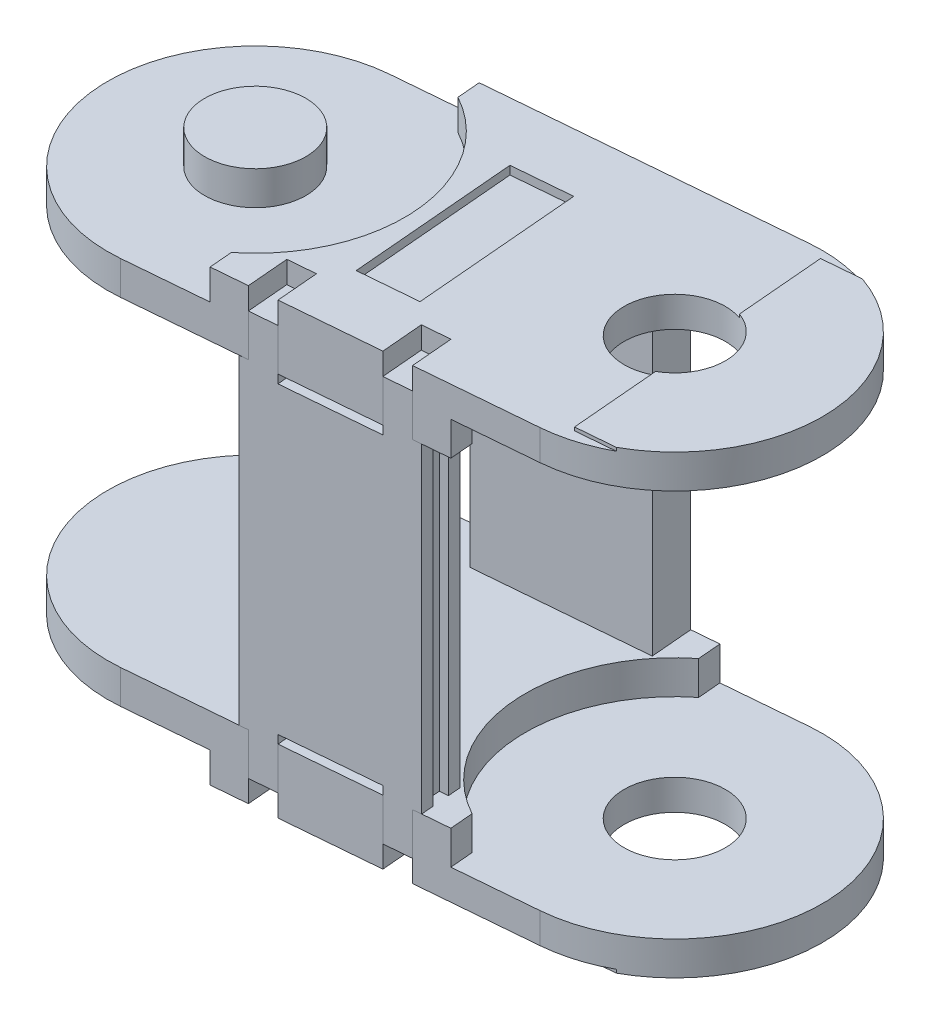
ISO-10303-21;
HEADER;
FILE_DESCRIPTION(('STEP AP214'),'2;1');
FILE_NAME('part.step','',(''),(''),'','','');
FILE_SCHEMA(('AUTOMOTIVE_DESIGN { 1 0 10303 214 1 1 1 1 }'));
ENDSEC;
DATA;
#1=APPLICATION_CONTEXT('core data for automotive mechanical design processes');
#2=APPLICATION_PROTOCOL_DEFINITION('international standard','automotive_design',2000,#1);
#3=PRODUCT_CONTEXT('',#1,'mechanical');
#4=PRODUCT('Part','Part','',(#3));
#5=PRODUCT_RELATED_PRODUCT_CATEGORY('part','',(#4));
#6=PRODUCT_DEFINITION_FORMATION('','',#4);
#7=PRODUCT_DEFINITION_CONTEXT('part definition',#1,'design');
#8=PRODUCT_DEFINITION('design','',#6,#7);
#9=PRODUCT_DEFINITION_SHAPE('','',#8);
#10=(LENGTH_UNIT() NAMED_UNIT(*) SI_UNIT(.MILLI.,.METRE.));
#11=(NAMED_UNIT(*) PLANE_ANGLE_UNIT() SI_UNIT($,.RADIAN.));
#12=(NAMED_UNIT(*) SI_UNIT($,.STERADIAN.) SOLID_ANGLE_UNIT());
#13=UNCERTAINTY_MEASURE_WITH_UNIT(LENGTH_MEASURE(1.E-05),#10,'distance_accuracy_value','');
#14=(GEOMETRIC_REPRESENTATION_CONTEXT(3) GLOBAL_UNCERTAINTY_ASSIGNED_CONTEXT((#13)) GLOBAL_UNIT_ASSIGNED_CONTEXT((#10,
#11,#12)) REPRESENTATION_CONTEXT('',''));
#15=CARTESIAN_POINT('',(0.,0.,0.));
#16=DIRECTION('',(0.,0.,1.));
#17=DIRECTION('',(1.,0.,0.));
#18=AXIS2_PLACEMENT_3D('',#15,#16,#17);
#19=CARTESIAN_POINT('',(-275.83409922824,-8.,3.90324838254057));
#20=DIRECTION('',(0.,-1.,0.));
#21=DIRECTION('',(0.,0.,-1.));
#22=AXIS2_PLACEMENT_3D('',#19,#20,#21);
#23=PLANE('',#22);
#24=CARTESIAN_POINT('',(-275.83409922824,-8.,3.90324838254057));
#25=DIRECTION('',(0.,1.,0.));
#26=DIRECTION('',(0.,0.,1.));
#27=AXIS2_PLACEMENT_3D('',#24,#25,#26);
#28=CIRCLE('',#27,6.);
#29=CARTESIAN_POINT('',(-275.83409922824,-8.,9.90324838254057));
#30=VERTEX_POINT('',#29);
#31=EDGE_CURVE('E19',#30,#30,#28,.T.);
#32=ORIENTED_EDGE('',*,*,#31,.F.);
#33=EDGE_LOOP('',(#32));
#34=FACE_BOUND('',#33,.T.);
#35=ADVANCED_FACE('F16',(#34),#23,.T.);
#36=CARTESIAN_POINT('',(-252.91704961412,-6.6,1.95162419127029));
#37=DIRECTION('',(0.,1.,0.));
#38=DIRECTION('',(0.,0.,1.));
#39=AXIS2_PLACEMENT_3D('',#36,#37,#38);
#40=PLANE('',#39);
#41=DIRECTION('',(0.0848532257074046,0.,0.996393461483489));
#42=VECTOR('',#41,1.);
#43=CARTESIAN_POINT('',(-249.429672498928,-6.6,1.65463790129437));
#44=LINE('',#43,#42);
#45=CARTESIAN_POINT('',(-248.581140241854,-6.6,11.6185725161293));
#46=VERTEX_POINT('',#45);
#47=CARTESIAN_POINT('',(-250.278204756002,-6.6,-8.3092967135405));
#48=VERTEX_POINT('',#47);
#49=EDGE_CURVE('E1169',#46,#48,#44,.F.);
#50=ORIENTED_EDGE('',*,*,#49,.F.);
#51=DIRECTION('',(-0.996393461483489,0.,0.0848532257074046));
#52=VECTOR('',#51,1.);
#53=CARTESIAN_POINT('',(-252.068517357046,-6.6,11.9155588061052));
#54=LINE('',#53,#52);
#55=CARTESIAN_POINT('',(-255.555894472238,-6.6,12.2125450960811));
#56=VERTEX_POINT('',#55);
#57=EDGE_CURVE('E1164',#56,#46,#54,.F.);
#58=ORIENTED_EDGE('',*,*,#57,.F.);
#59=DIRECTION('',(-0.0848532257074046,0.,-0.996393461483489));
#60=VECTOR('',#59,1.);
#61=CARTESIAN_POINT('',(-256.404426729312,-6.6,2.24861048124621));
#62=LINE('',#61,#60);
#63=CARTESIAN_POINT('',(-257.252958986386,-6.6,-7.71532413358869));
#64=VERTEX_POINT('',#63);
#65=EDGE_CURVE('E661',#64,#56,#62,.F.);
#66=ORIENTED_EDGE('',*,*,#65,.F.);
#67=DIRECTION('',(0.996393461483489,0.,-0.0848532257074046));
#68=VECTOR('',#67,1.);
#69=CARTESIAN_POINT('',(-253.765581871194,-6.6,-8.01231042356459));
#70=LINE('',#69,#68);
#71=EDGE_CURVE('E1174',#48,#64,#70,.F.);
#72=ORIENTED_EDGE('',*,*,#71,.F.);
#73=EDGE_LOOP('',(#50,#58,#66,#72));
#74=FACE_BOUND('',#73,.T.);
#75=ADVANCED_FACE('F2933',(#74),#40,.F.);
#76=CARTESIAN_POINT('',(-252.917049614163,-8.,1.95162419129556));
#77=DIRECTION('',(0.,1.,0.));
#78=DIRECTION('',(0.,0.,1.));
#79=AXIS2_PLACEMENT_3D('',#76,#77,#78);
#80=PLANE('',#79);
#81=CARTESIAN_POINT('',(-230.,-8.,0.));
#82=DIRECTION('',(0.,-1.,0.));
#83=DIRECTION('',(0.,0.,-1.));
#84=AXIS2_PLACEMENT_3D('',#81,#82,#83);
#85=CIRCLE('',#84,6.);
#86=CARTESIAN_POINT('',(-227.046196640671,-8.,5.22255164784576));
#87=VERTEX_POINT('',#86);
#88=CARTESIAN_POINT('',(-227.971836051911,-8.,-5.64681777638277));
#89=VERTEX_POINT('',#88);
#90=EDGE_CURVE('E664',#87,#89,#85,.F.);
#91=ORIENTED_EDGE('',*,*,#90,.T.);
#92=DIRECTION('',(0.0848532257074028,0.,0.996393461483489));
#93=VECTOR('',#92,1.);
#94=CARTESIAN_POINT('',(-227.509016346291,-8.,-0.212133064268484));
#95=LINE('',#94,#93);
#96=CARTESIAN_POINT('',(-228.86666795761,-8.,-16.1544284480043));
#97=VERTEX_POINT('',#96);
#98=EDGE_CURVE('E643',#97,#89,#95,.T.);
#99=ORIENTED_EDGE('',*,*,#98,.F.);
#100=DIRECTION('',(-0.996393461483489,0.,0.0848532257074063));
#101=VECTOR('',#100,1.);
#102=CARTESIAN_POINT('',(-234.097733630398,-8.,-15.7089490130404));
#103=LINE('',#102,#101);
#104=CARTESIAN_POINT('',(-224.294493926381,-8.,-16.5437964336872));
#105=VERTEX_POINT('',#104);
#106=EDGE_CURVE('E636',#105,#97,#103,.T.);
#107=ORIENTED_EDGE('',*,*,#106,.F.);
#108=CARTESIAN_POINT('',(-230.000000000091,-8.,1.08098419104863E-10));
#109=DIRECTION('',(0.,-1.,0.));
#110=DIRECTION('',(0.,0.,-1.));
#111=AXIS2_PLACEMENT_3D('',#108,#109,#110);
#112=CIRCLE('',#111,17.5);
#113=CARTESIAN_POINT('',(-221.579190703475,-8.,15.3407943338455));
#114=VERTEX_POINT('',#113);
#115=EDGE_CURVE('E640',#114,#105,#112,.F.);
#116=ORIENTED_EDGE('',*,*,#115,.F.);
#117=DIRECTION('',(0.996393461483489,0.,-0.0848532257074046));
#118=VECTOR('',#117,1.);
#119=CARTESIAN_POINT('',(-231.382430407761,-8.,16.1756417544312));
#120=LINE('',#119,#118);
#121=CARTESIAN_POINT('',(-226.151364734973,-8.,15.7301623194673));
#122=VERTEX_POINT('',#121);
#123=EDGE_CURVE('E631',#122,#114,#120,.T.);
#124=ORIENTED_EDGE('',*,*,#123,.F.);
#125=DIRECTION('',(0.0848532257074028,0.,0.996393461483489));
#126=VECTOR('',#125,1.);
#127=CARTESIAN_POINT('',(-227.509016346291,-8.,-0.212133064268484));
#128=LINE('',#127,#126);
#129=EDGE_CURVE('E840',#87,#122,#128,.T.);
#130=ORIENTED_EDGE('',*,*,#129,.F.);
#131=EDGE_LOOP('',(#91,#99,#107,#116,#124,#130));
#132=FACE_BOUND('',#131,.T.);
#133=ADVANCED_FACE('F638',(#132),#80,.F.);
#134=CARTESIAN_POINT('',(-275.83409922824,46.,3.90324838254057));
#135=DIRECTION('',(0.,1.,0.));
#136=DIRECTION('',(0.,0.,1.));
#137=AXIS2_PLACEMENT_3D('',#134,#135,#136);
#138=PLANE('',#137);
#139=CARTESIAN_POINT('',(-275.83409922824,46.,3.90324838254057));
#140=DIRECTION('',(0.,-1.,0.));
#141=DIRECTION('',(0.,0.,-1.));
#142=AXIS2_PLACEMENT_3D('',#139,#140,#141);
#143=CIRCLE('',#142,6.);
#144=CARTESIAN_POINT('',(-275.83409922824,46.,-2.09675161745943));
#145=VERTEX_POINT('',#144);
#146=EDGE_CURVE('E667',#145,#145,#143,.T.);
#147=ORIENTED_EDGE('',*,*,#146,.F.);
#148=EDGE_LOOP('',(#147));
#149=FACE_BOUND('',#148,.T.);
#150=ADVANCED_FACE('F2916',(#149),#138,.T.);
#151=CARTESIAN_POINT('',(-252.91704961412,44.6,1.95162419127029));
#152=DIRECTION('',(0.,-1.,0.));
#153=DIRECTION('',(0.,0.,-1.));
#154=AXIS2_PLACEMENT_3D('',#151,#152,#153);
#155=PLANE('',#154);
#156=DIRECTION('',(0.0848532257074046,0.,0.996393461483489));
#157=VECTOR('',#156,1.);
#158=CARTESIAN_POINT('',(-249.429672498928,44.6,1.65463790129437));
#159=LINE('',#158,#157);
#160=CARTESIAN_POINT('',(-250.278204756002,44.6,-8.3092967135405));
#161=VERTEX_POINT('',#160);
#162=CARTESIAN_POINT('',(-248.581140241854,44.6,11.6185725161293));
#163=VERTEX_POINT('',#162);
#164=EDGE_CURVE('E1291',#161,#163,#159,.T.);
#165=ORIENTED_EDGE('',*,*,#164,.F.);
#166=DIRECTION('',(0.996393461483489,0.,-0.0848532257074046));
#167=VECTOR('',#166,1.);
#168=CARTESIAN_POINT('',(-253.765581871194,44.6,-8.01231042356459));
#169=LINE('',#168,#167);
#170=CARTESIAN_POINT('',(-257.252958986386,44.6,-7.71532413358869));
#171=VERTEX_POINT('',#170);
#172=EDGE_CURVE('E1297',#171,#161,#169,.T.);
#173=ORIENTED_EDGE('',*,*,#172,.F.);
#174=DIRECTION('',(-0.0848532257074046,0.,-0.996393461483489));
#175=VECTOR('',#174,1.);
#176=CARTESIAN_POINT('',(-256.404426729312,44.6,2.24861048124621));
#177=LINE('',#176,#175);
#178=CARTESIAN_POINT('',(-255.555894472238,44.6,12.2125450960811));
#179=VERTEX_POINT('',#178);
#180=EDGE_CURVE('E938',#179,#171,#177,.T.);
#181=ORIENTED_EDGE('',*,*,#180,.F.);
#182=DIRECTION('',(-0.996393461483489,0.,0.0848532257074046));
#183=VECTOR('',#182,1.);
#184=CARTESIAN_POINT('',(-252.068517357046,44.6,11.9155588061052));
#185=LINE('',#184,#183);
#186=EDGE_CURVE('E1195',#163,#179,#185,.T.);
#187=ORIENTED_EDGE('',*,*,#186,.F.);
#188=EDGE_LOOP('',(#165,#173,#181,#187));
#189=FACE_BOUND('',#188,.T.);
#190=ADVANCED_FACE('F2908',(#189),#155,.F.);
#191=CARTESIAN_POINT('',(-261.819470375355,38.,15.2650386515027));
#192=DIRECTION('',(-0.996393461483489,0.,0.0848532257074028));
#193=DIRECTION('',(0.0848532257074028,0.,0.996393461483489));
#194=AXIS2_PLACEMENT_3D('',#191,#192,#193);
#195=PLANE('',#194);
#196=DIRECTION('',(0.0848532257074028,0.,0.996393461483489));
#197=VECTOR('',#196,1.);
#198=CARTESIAN_POINT('',(-261.819470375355,0.,15.2650386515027));
#199=LINE('',#198,#197);
#200=CARTESIAN_POINT('',(-261.819470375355,0.,15.2650386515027));
#201=VERTEX_POINT('',#200);
#202=CARTESIAN_POINT('',(-261.692190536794,0.,16.759628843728));
#203=VERTEX_POINT('',#202);
#204=EDGE_CURVE('E1031',#201,#203,#199,.T.);
#205=ORIENTED_EDGE('',*,*,#204,.T.);
#206=DIRECTION('',(0.,1.,0.));
#207=VECTOR('',#206,1.);
#208=CARTESIAN_POINT('',(-261.692190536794,38.,16.759628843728));
#209=LINE('',#208,#207);
#210=CARTESIAN_POINT('',(-261.692190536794,38.,16.759628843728));
#211=VERTEX_POINT('',#210);
#212=EDGE_CURVE('E1334',#211,#203,#209,.F.);
#213=ORIENTED_EDGE('',*,*,#212,.F.);
#214=DIRECTION('',(0.0848532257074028,0.,0.996393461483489));
#215=VECTOR('',#214,1.);
#216=CARTESIAN_POINT('',(-261.819470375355,38.,15.2650386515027));
#217=LINE('',#216,#215);
#218=CARTESIAN_POINT('',(-261.819470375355,38.,15.2650386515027));
#219=VERTEX_POINT('',#218);
#220=EDGE_CURVE('E1029',#211,#219,#217,.F.);
#221=ORIENTED_EDGE('',*,*,#220,.T.);
#222=DIRECTION('',(0.,1.,0.));
#223=VECTOR('',#222,1.);
#224=CARTESIAN_POINT('',(-261.819470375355,38.,15.2650386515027));
#225=LINE('',#224,#223);
#226=EDGE_CURVE('E830',#201,#219,#225,.T.);
#227=ORIENTED_EDGE('',*,*,#226,.F.);
#228=EDGE_LOOP('',(#205,#213,#221,#227));
#229=FACE_BOUND('',#228,.T.);
#230=ADVANCED_FACE('F1916',(#229),#195,.T.);
#231=CARTESIAN_POINT('',(-275.83409922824,-6.,3.90324838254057));
#232=DIRECTION('',(0.,1.,0.));
#233=DIRECTION('',(0.,0.,1.));
#234=AXIS2_PLACEMENT_3D('',#231,#232,#233);
#235=CYLINDRICAL_SURFACE('',#234,6.);
#236=ORIENTED_EDGE('',*,*,#31,.T.);
#237=EDGE_LOOP('',(#236));
#238=FACE_BOUND('',#237,.T.);
#239=CARTESIAN_POINT('',(-275.83409922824,-4.,3.90324838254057));
#240=DIRECTION('',(0.,1.,0.));
#241=DIRECTION('',(0.,0.,1.));
#242=AXIS2_PLACEMENT_3D('',#239,#240,#241);
#243=CIRCLE('',#242,6.);
#244=CARTESIAN_POINT('',(-275.83409922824,-4.,9.90324838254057));
#245=VERTEX_POINT('',#244);
#246=EDGE_CURVE('E682',#245,#245,#243,.F.);
#247=ORIENTED_EDGE('',*,*,#246,.T.);
#248=EDGE_LOOP('',(#247));
#249=FACE_BOUND('',#248,.T.);
#250=ADVANCED_FACE('F2891',(#238,#249),#235,.T.);
#251=CARTESIAN_POINT('',(-275.83409922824,-6.,3.90324838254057));
#252=DIRECTION('',(0.,1.,0.));
#253=DIRECTION('',(0.,0.,1.));
#254=AXIS2_PLACEMENT_3D('',#251,#252,#253);
#255=CYLINDRICAL_SURFACE('',#254,17.7);
#256=DIRECTION('',(0.,1.,0.));
#257=VECTOR('',#256,1.);
#258=CARTESIAN_POINT('',(-267.320129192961,-6.,-11.6145579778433));
#259=LINE('',#258,#257);
#260=CARTESIAN_POINT('',(-267.320129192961,-7.60000000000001,-11.6145579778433));
#261=VERTEX_POINT('',#260);
#262=CARTESIAN_POINT('',(-267.320129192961,-4.,-11.6145579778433));
#263=VERTEX_POINT('',#262);
#264=EDGE_CURVE('E691',#261,#263,#259,.T.);
#265=ORIENTED_EDGE('',*,*,#264,.F.);
#266=CARTESIAN_POINT('',(-275.83409922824,-7.6,3.90324838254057));
#267=DIRECTION('',(0.,1.,0.));
#268=DIRECTION('',(0.,0.,1.));
#269=AXIS2_PLACEMENT_3D('',#266,#267,#268);
#270=CIRCLE('',#269,17.7);
#271=CARTESIAN_POINT('',(-264.818757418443,-7.6,17.7579315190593));
#272=VERTEX_POINT('',#271);
#273=EDGE_CURVE('E687',#272,#261,#270,.T.);
#274=ORIENTED_EDGE('',*,*,#273,.F.);
#275=DIRECTION('',(0.,1.,0.));
#276=VECTOR('',#275,1.);
#277=CARTESIAN_POINT('',(-264.818757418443,-6.,17.7579315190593));
#278=LINE('',#277,#276);
#279=CARTESIAN_POINT('',(-264.818757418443,-4.,17.7579315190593));
#280=VERTEX_POINT('',#279);
#281=EDGE_CURVE('E860',#280,#272,#278,.F.);
#282=ORIENTED_EDGE('',*,*,#281,.F.);
#283=CARTESIAN_POINT('',(-275.83409922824,-4.,3.90324838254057));
#284=DIRECTION('',(0.,1.,0.));
#285=DIRECTION('',(0.,0.,1.));
#286=AXIS2_PLACEMENT_3D('',#283,#284,#285);
#287=CIRCLE('',#286,17.7);
#288=EDGE_CURVE('E675',#280,#263,#287,.T.);
#289=ORIENTED_EDGE('',*,*,#288,.T.);
#290=EDGE_LOOP('',(#265,#274,#282,#289));
#291=FACE_BOUND('',#290,.T.);
#292=ADVANCED_FACE('F2883',(#291),#255,.F.);
#293=CARTESIAN_POINT('',(-234.097733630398,-7.8,-15.7089490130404));
#294=DIRECTION('',(-0.0848532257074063,0.,-0.996393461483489));
#295=DIRECTION('',(-0.996393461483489,0.,0.0848532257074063));
#296=AXIS2_PLACEMENT_3D('',#293,#294,#295);
#297=PLANE('',#296);
#298=DIRECTION('',(0.,-1.,0.));
#299=VECTOR('',#298,1.);
#300=CARTESIAN_POINT('',(-224.294493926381,-8.,-16.5437964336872));
#301=LINE('',#300,#299);
#302=CARTESIAN_POINT('',(-224.294493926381,-7.6,-16.5437964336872));
#303=VERTEX_POINT('',#302);
#304=EDGE_CURVE('E650',#105,#303,#301,.F.);
#305=ORIENTED_EDGE('',*,*,#304,.F.);
#306=ORIENTED_EDGE('',*,*,#106,.T.);
#307=DIRECTION('',(0.,1.,0.));
#308=VECTOR('',#307,1.);
#309=CARTESIAN_POINT('',(-228.866667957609,-7.8,-16.1544284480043));
#310=LINE('',#309,#308);
#311=CARTESIAN_POINT('',(-228.86666795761,-7.60000000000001,-16.1544284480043));
#312=VERTEX_POINT('',#311);
#313=EDGE_CURVE('E646',#312,#97,#310,.F.);
#314=ORIENTED_EDGE('',*,*,#313,.F.);
#315=DIRECTION('',(-0.99639346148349,0.,0.0848532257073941));
#316=VECTOR('',#315,1.);
#317=CARTESIAN_POINT('',(-224.294493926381,-7.60000000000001,-16.5437964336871));
#318=LINE('',#317,#316);
#319=EDGE_CURVE('E653',#303,#312,#318,.T.);
#320=ORIENTED_EDGE('',*,*,#319,.F.);
#321=EDGE_LOOP('',(#305,#306,#314,#320));
#322=FACE_BOUND('',#321,.T.);
#323=ADVANCED_FACE('F651',(#322),#297,.T.);
#324=CARTESIAN_POINT('',(-227.509016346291,-7.8,-0.212133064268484));
#325=DIRECTION('',(-0.996393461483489,0.,0.0848532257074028));
#326=DIRECTION('',(0.0848532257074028,0.,0.996393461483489));
#327=AXIS2_PLACEMENT_3D('',#324,#325,#326);
#328=PLANE('',#327);
#329=ORIENTED_EDGE('',*,*,#313,.T.);
#330=ORIENTED_EDGE('',*,*,#98,.T.);
#331=DIRECTION('',(0.,-1.,0.));
#332=VECTOR('',#331,1.);
#333=CARTESIAN_POINT('',(-227.971836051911,-4.,-5.64681777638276));
#334=LINE('',#333,#332);
#335=CARTESIAN_POINT('',(-227.971836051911,-7.6,-5.64681777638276));
#336=VERTEX_POINT('',#335);
#337=EDGE_CURVE('E666',#89,#336,#334,.F.);
#338=ORIENTED_EDGE('',*,*,#337,.T.);
#339=DIRECTION('',(0.084853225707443,0.,0.996393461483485));
#340=VECTOR('',#339,1.);
#341=CARTESIAN_POINT('',(-228.86666795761,-7.60000000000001,-16.1544284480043));
#342=LINE('',#341,#340);
#343=EDGE_CURVE('E696',#312,#336,#342,.T.);
#344=ORIENTED_EDGE('',*,*,#343,.F.);
#345=EDGE_LOOP('',(#329,#330,#338,#344));
#346=FACE_BOUND('',#345,.T.);
#347=ADVANCED_FACE('F2866',(#346),#328,.T.);
#348=CARTESIAN_POINT('',(-227.509016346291,-7.8,-0.212133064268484));
#349=DIRECTION('',(-0.996393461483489,0.,0.0848532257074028));
#350=DIRECTION('',(0.0848532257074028,0.,0.996393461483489));
#351=AXIS2_PLACEMENT_3D('',#348,#349,#350);
#352=PLANE('',#351);
#353=DIRECTION('',(0.,1.,0.));
#354=VECTOR('',#353,1.);
#355=CARTESIAN_POINT('',(-226.151364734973,-7.8,15.7301623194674));
#356=LINE('',#355,#354);
#357=CARTESIAN_POINT('',(-226.151364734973,-7.60000000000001,15.7301623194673));
#358=VERTEX_POINT('',#357);
#359=EDGE_CURVE('E835',#358,#122,#356,.F.);
#360=ORIENTED_EDGE('',*,*,#359,.F.);
#361=DIRECTION('',(0.0848532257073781,0.,0.996393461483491));
#362=VECTOR('',#361,1.);
#363=CARTESIAN_POINT('',(-227.046196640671,-7.60000000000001,5.2225516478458));
#364=LINE('',#363,#362);
#365=CARTESIAN_POINT('',(-227.046196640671,-7.6,5.22255164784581));
#366=VERTEX_POINT('',#365);
#367=EDGE_CURVE('E695',#366,#358,#364,.T.);
#368=ORIENTED_EDGE('',*,*,#367,.F.);
#369=DIRECTION('',(0.,-1.,0.));
#370=VECTOR('',#369,1.);
#371=CARTESIAN_POINT('',(-227.046196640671,-4.,5.22255164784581));
#372=LINE('',#371,#370);
#373=EDGE_CURVE('E656',#366,#87,#372,.T.);
#374=ORIENTED_EDGE('',*,*,#373,.T.);
#375=ORIENTED_EDGE('',*,*,#129,.T.);
#376=EDGE_LOOP('',(#360,#368,#374,#375));
#377=FACE_BOUND('',#376,.T.);
#378=ADVANCED_FACE('F2858',(#377),#352,.T.);
#379=CARTESIAN_POINT('',(-231.382430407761,-7.8,16.1756417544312));
#380=DIRECTION('',(0.0848532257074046,0.,0.996393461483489));
#381=DIRECTION('',(0.996393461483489,0.,-0.0848532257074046));
#382=AXIS2_PLACEMENT_3D('',#379,#380,#381);
#383=PLANE('',#382);
#384=DIRECTION('',(0.,-1.,0.));
#385=VECTOR('',#384,1.);
#386=CARTESIAN_POINT('',(-221.579190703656,-8.,15.3407943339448));
#387=LINE('',#386,#385);
#388=CARTESIAN_POINT('',(-221.579190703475,-7.6,15.3407943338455));
#389=VERTEX_POINT('',#388);
#390=EDGE_CURVE('E660',#389,#114,#387,.T.);
#391=ORIENTED_EDGE('',*,*,#390,.F.);
#392=DIRECTION('',(0.996393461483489,0.,-0.0848532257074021));
#393=VECTOR('',#392,1.);
#394=CARTESIAN_POINT('',(-226.151364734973,-7.60000000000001,15.7301623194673));
#395=LINE('',#394,#393);
#396=EDGE_CURVE('E701',#358,#389,#395,.T.);
#397=ORIENTED_EDGE('',*,*,#396,.F.);
#398=ORIENTED_EDGE('',*,*,#359,.T.);
#399=ORIENTED_EDGE('',*,*,#123,.T.);
#400=EDGE_LOOP('',(#391,#397,#398,#399));
#401=FACE_BOUND('',#400,.T.);
#402=ADVANCED_FACE('F2850',(#401),#383,.T.);
#403=CARTESIAN_POINT('',(-242.676710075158,-4.,16.133847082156));
#404=DIRECTION('',(-0.996393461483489,0.,0.0848532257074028));
#405=DIRECTION('',(0.0848532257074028,0.,0.996393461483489));
#406=AXIS2_PLACEMENT_3D('',#403,#404,#405);
#407=PLANE('',#406);
#408=DIRECTION('',(0.,1.,0.));
#409=VECTOR('',#408,1.);
#410=CARTESIAN_POINT('',(-242.888843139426,-4.,13.6428634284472));
#411=LINE('',#410,#409);
#412=CARTESIAN_POINT('',(-242.888843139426,-7.60000000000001,13.6428634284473));
#413=VERTEX_POINT('',#412);
#414=CARTESIAN_POINT('',(-242.888843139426,0.,13.6428634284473));
#415=VERTEX_POINT('',#414);
#416=EDGE_CURVE('E1096',#413,#415,#411,.T.);
#417=ORIENTED_EDGE('',*,*,#416,.F.);
#418=DIRECTION('',(-0.0848532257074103,0.,-0.996393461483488));
#419=VECTOR('',#418,1.);
#420=CARTESIAN_POINT('',(-242.464577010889,-7.60000000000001,18.6248307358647));
#421=LINE('',#420,#419);
#422=CARTESIAN_POINT('',(-242.464577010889,-7.60000000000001,18.6248307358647));
#423=VERTEX_POINT('',#422);
#424=EDGE_CURVE('E1090',#423,#413,#421,.T.);
#425=ORIENTED_EDGE('',*,*,#424,.F.);
#426=DIRECTION('',(0.,1.,0.));
#427=VECTOR('',#426,1.);
#428=CARTESIAN_POINT('',(-242.464577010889,-8.,18.6248307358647));
#429=LINE('',#428,#427);
#430=CARTESIAN_POINT('',(-242.464577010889,-5.,18.6248307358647));
#431=VERTEX_POINT('',#430);
#432=EDGE_CURVE('E1084',#431,#423,#429,.F.);
#433=ORIENTED_EDGE('',*,*,#432,.F.);
#434=DIRECTION('',(-0.0848532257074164,0.,-0.996393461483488));
#435=VECTOR('',#434,1.);
#436=CARTESIAN_POINT('',(-242.464577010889,-5.,18.6248307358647));
#437=LINE('',#436,#435);
#438=CARTESIAN_POINT('',(-242.887994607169,-5.,13.6528273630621));
#439=VERTEX_POINT('',#438);
#440=EDGE_CURVE('E933',#431,#439,#437,.T.);
#441=ORIENTED_EDGE('',*,*,#440,.T.);
#442=DIRECTION('',(0.,1.,0.));
#443=VECTOR('',#442,1.);
#444=CARTESIAN_POINT('',(-242.887994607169,38.,13.6528273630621));
#445=LINE('',#444,#443);
#446=CARTESIAN_POINT('',(-242.887994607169,0.,13.6528273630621));
#447=VERTEX_POINT('',#446);
#448=EDGE_CURVE('E801',#447,#439,#445,.F.);
#449=ORIENTED_EDGE('',*,*,#448,.F.);
#450=DIRECTION('',(0.0848532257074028,0.,0.996393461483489));
#451=VECTOR('',#450,1.);
#452=CARTESIAN_POINT('',(-242.676710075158,0.,16.133847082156));
#453=LINE('',#452,#451);
#454=EDGE_CURVE('E834',#447,#415,#453,.F.);
#455=ORIENTED_EDGE('',*,*,#454,.T.);
#456=EDGE_LOOP('',(#417,#425,#433,#441,#449,#455));
#457=FACE_BOUND('',#456,.T.);
#458=ADVANCED_FACE('F2842',(#457),#407,.T.);
#459=CARTESIAN_POINT('',(-245.914988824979,-4.,16.409620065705));
#460=DIRECTION('',(0.996393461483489,0.,-0.0848532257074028));
#461=DIRECTION('',(-0.0848532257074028,0.,-0.996393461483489));
#462=AXIS2_PLACEMENT_3D('',#459,#460,#461);
#463=PLANE('',#462);
#464=DIRECTION('',(0.0848532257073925,0.,0.99639346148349));
#465=VECTOR('',#464,1.);
#466=CARTESIAN_POINT('',(-246.127121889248,-7.60000000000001,13.9186364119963));
#467=LINE('',#466,#465);
#468=CARTESIAN_POINT('',(-246.127121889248,-7.60000000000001,13.9186364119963));
#469=VERTEX_POINT('',#468);
#470=CARTESIAN_POINT('',(-245.702855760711,-7.60000000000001,18.9006037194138));
#471=VERTEX_POINT('',#470);
#472=EDGE_CURVE('E1108',#469,#471,#467,.T.);
#473=ORIENTED_EDGE('',*,*,#472,.F.);
#474=DIRECTION('',(0.,1.,0.));
#475=VECTOR('',#474,1.);
#476=CARTESIAN_POINT('',(-246.127121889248,-4.,13.9186364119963));
#477=LINE('',#476,#475);
#478=CARTESIAN_POINT('',(-246.127121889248,0.,13.9186364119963));
#479=VERTEX_POINT('',#478);
#480=EDGE_CURVE('E1099',#479,#469,#477,.F.);
#481=ORIENTED_EDGE('',*,*,#480,.F.);
#482=DIRECTION('',(-0.0848532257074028,0.,-0.996393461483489));
#483=VECTOR('',#482,1.);
#484=CARTESIAN_POINT('',(-245.914988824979,0.,16.409620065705));
#485=LINE('',#484,#483);
#486=CARTESIAN_POINT('',(-246.12627335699,0.,13.9286003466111));
#487=VERTEX_POINT('',#486);
#488=EDGE_CURVE('E869',#479,#487,#485,.F.);
#489=ORIENTED_EDGE('',*,*,#488,.T.);
#490=DIRECTION('',(0.,1.,0.));
#491=VECTOR('',#490,1.);
#492=CARTESIAN_POINT('',(-246.126273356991,38.,13.9286003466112));
#493=LINE('',#492,#491);
#494=CARTESIAN_POINT('',(-246.126273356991,-5.,13.9286003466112));
#495=VERTEX_POINT('',#494);
#496=EDGE_CURVE('E797',#495,#487,#493,.T.);
#497=ORIENTED_EDGE('',*,*,#496,.F.);
#498=DIRECTION('',(0.0848532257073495,0.,0.996393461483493));
#499=VECTOR('',#498,1.);
#500=CARTESIAN_POINT('',(-246.126273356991,-5.,13.9286003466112));
#501=LINE('',#500,#499);
#502=CARTESIAN_POINT('',(-245.702855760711,-4.99999999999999,18.9006037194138));
#503=VERTEX_POINT('',#502);
#504=EDGE_CURVE('E890',#495,#503,#501,.T.);
#505=ORIENTED_EDGE('',*,*,#504,.T.);
#506=DIRECTION('',(0.,1.,0.));
#507=VECTOR('',#506,1.);
#508=CARTESIAN_POINT('',(-245.702855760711,-8.,18.9006037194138));
#509=LINE('',#508,#507);
#510=EDGE_CURVE('E1103',#471,#503,#509,.T.);
#511=ORIENTED_EDGE('',*,*,#510,.F.);
#512=EDGE_LOOP('',(#473,#481,#489,#497,#505,#511));
#513=FACE_BOUND('',#512,.T.);
#514=ADVANCED_FACE('F2060',(#513),#463,.T.);
#515=CARTESIAN_POINT('',(-257.373513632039,-4.,17.3854321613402));
#516=DIRECTION('',(-0.996393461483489,0.,0.0848532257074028));
#517=DIRECTION('',(0.0848532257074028,0.,0.996393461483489));
#518=AXIS2_PLACEMENT_3D('',#515,#516,#517);
#519=PLANE('',#518);
#520=DIRECTION('',(0.0848532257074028,0.,0.996393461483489));
#521=VECTOR('',#520,1.);
#522=CARTESIAN_POINT('',(-257.373513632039,0.,17.3854321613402));
#523=LINE('',#522,#521);
#524=CARTESIAN_POINT('',(-257.58479816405,0.,14.9044124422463));
#525=VERTEX_POINT('',#524);
#526=CARTESIAN_POINT('',(-257.585646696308,0.,14.8944485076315));
#527=VERTEX_POINT('',#526);
#528=EDGE_CURVE('E861',#525,#527,#523,.F.);
#529=ORIENTED_EDGE('',*,*,#528,.T.);
#530=DIRECTION('',(0.,1.,0.));
#531=VECTOR('',#530,1.);
#532=CARTESIAN_POINT('',(-257.585646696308,-4.,14.8944485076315));
#533=LINE('',#532,#531);
#534=CARTESIAN_POINT('',(-257.585646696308,-7.60000000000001,14.8944485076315));
#535=VERTEX_POINT('',#534);
#536=EDGE_CURVE('E1121',#535,#527,#533,.T.);
#537=ORIENTED_EDGE('',*,*,#536,.F.);
#538=DIRECTION('',(-0.0848532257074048,0.,-0.996393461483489));
#539=VECTOR('',#538,1.);
#540=CARTESIAN_POINT('',(-257.161380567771,-7.60000000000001,19.8764158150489));
#541=LINE('',#540,#539);
#542=CARTESIAN_POINT('',(-257.161380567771,-7.60000000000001,19.8764158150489));
#543=VERTEX_POINT('',#542);
#544=EDGE_CURVE('E1126',#543,#535,#541,.T.);
#545=ORIENTED_EDGE('',*,*,#544,.F.);
#546=DIRECTION('',(0.,1.,0.));
#547=VECTOR('',#546,1.);
#548=CARTESIAN_POINT('',(-257.161380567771,-8.,19.8764158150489));
#549=LINE('',#548,#547);
#550=CARTESIAN_POINT('',(-257.161380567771,-4.99999999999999,19.8764158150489));
#551=VERTEX_POINT('',#550);
#552=EDGE_CURVE('E1117',#551,#543,#549,.F.);
#553=ORIENTED_EDGE('',*,*,#552,.F.);
#554=DIRECTION('',(-0.0848532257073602,0.,-0.996393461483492));
#555=VECTOR('',#554,1.);
#556=CARTESIAN_POINT('',(-257.161380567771,-5.,19.8764158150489));
#557=LINE('',#556,#555);
#558=CARTESIAN_POINT('',(-257.58479816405,-5.,14.9044124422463));
#559=VERTEX_POINT('',#558);
#560=EDGE_CURVE('E872',#551,#559,#557,.T.);
#561=ORIENTED_EDGE('',*,*,#560,.T.);
#562=DIRECTION('',(0.,1.,0.));
#563=VECTOR('',#562,1.);
#564=CARTESIAN_POINT('',(-257.58479816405,38.,14.9044124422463));
#565=LINE('',#564,#563);
#566=EDGE_CURVE('E800',#525,#559,#565,.F.);
#567=ORIENTED_EDGE('',*,*,#566,.F.);
#568=EDGE_LOOP('',(#529,#537,#545,#553,#561,#567));
#569=FACE_BOUND('',#568,.T.);
#570=ADVANCED_FACE('F2077',(#569),#519,.T.);
#571=CARTESIAN_POINT('',(-260.611792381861,-4.,17.6612051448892));
#572=DIRECTION('',(0.996393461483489,0.,-0.0848532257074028));
#573=DIRECTION('',(-0.0848532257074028,0.,-0.996393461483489));
#574=AXIS2_PLACEMENT_3D('',#571,#572,#573);
#575=PLANE('',#574);
#576=DIRECTION('',(0.,1.,0.));
#577=VECTOR('',#576,1.);
#578=CARTESIAN_POINT('',(-260.399659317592,-8.,20.152188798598));
#579=LINE('',#578,#577);
#580=CARTESIAN_POINT('',(-260.399659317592,-7.60000000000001,20.152188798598));
#581=VERTEX_POINT('',#580);
#582=CARTESIAN_POINT('',(-260.399659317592,-5.,20.152188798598));
#583=VERTEX_POINT('',#582);
#584=EDGE_CURVE('E1140',#581,#583,#579,.T.);
#585=ORIENTED_EDGE('',*,*,#584,.F.);
#586=DIRECTION('',(0.0848532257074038,0.,0.996393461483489));
#587=VECTOR('',#586,1.);
#588=CARTESIAN_POINT('',(-260.823925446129,-7.60000000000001,15.1702214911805));
#589=LINE('',#588,#587);
#590=CARTESIAN_POINT('',(-260.823925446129,-7.60000000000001,15.1702214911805));
#591=VERTEX_POINT('',#590);
#592=EDGE_CURVE('E1145',#591,#581,#589,.T.);
#593=ORIENTED_EDGE('',*,*,#592,.F.);
#594=DIRECTION('',(0.,1.,0.));
#595=VECTOR('',#594,1.);
#596=CARTESIAN_POINT('',(-260.823925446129,-4.,15.1702214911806));
#597=LINE('',#596,#595);
#598=CARTESIAN_POINT('',(-260.823925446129,0.,15.1702214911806));
#599=VERTEX_POINT('',#598);
#600=EDGE_CURVE('E1136',#599,#591,#597,.F.);
#601=ORIENTED_EDGE('',*,*,#600,.F.);
#602=DIRECTION('',(-0.0848532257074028,0.,-0.996393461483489));
#603=VECTOR('',#602,1.);
#604=CARTESIAN_POINT('',(-260.611792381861,0.,17.6612051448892));
#605=LINE('',#604,#603);
#606=CARTESIAN_POINT('',(-260.823076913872,0.,15.1801854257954));
#607=VERTEX_POINT('',#606);
#608=EDGE_CURVE('E858',#599,#607,#605,.F.);
#609=ORIENTED_EDGE('',*,*,#608,.T.);
#610=DIRECTION('',(0.,1.,0.));
#611=VECTOR('',#610,1.);
#612=CARTESIAN_POINT('',(-260.823076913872,38.,15.1801854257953));
#613=LINE('',#612,#611);
#614=CARTESIAN_POINT('',(-260.823076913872,-5.,15.1801854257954));
#615=VERTEX_POINT('',#614);
#616=EDGE_CURVE('E819',#615,#607,#613,.T.);
#617=ORIENTED_EDGE('',*,*,#616,.F.);
#618=DIRECTION('',(0.0848532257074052,0.,0.996393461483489));
#619=VECTOR('',#618,1.);
#620=CARTESIAN_POINT('',(-260.823076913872,-5.,15.1801854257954));
#621=LINE('',#620,#619);
#622=EDGE_CURVE('E850',#615,#583,#621,.T.);
#623=ORIENTED_EDGE('',*,*,#622,.T.);
#624=EDGE_LOOP('',(#585,#593,#601,#609,#617,#623));
#625=FACE_BOUND('',#624,.T.);
#626=ADVANCED_FACE('F2080',(#625),#575,.T.);
#627=CARTESIAN_POINT('',(-266.069443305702,-6.,3.07168677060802));
#628=DIRECTION('',(-0.996393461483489,0.,0.0848532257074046));
#629=DIRECTION('',(0.0848532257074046,0.,0.996393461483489));
#630=AXIS2_PLACEMENT_3D('',#627,#628,#629);
#631=PLANE('',#630);
#632=DIRECTION('',(-0.0848532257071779,0.,-0.996393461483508));
#633=VECTOR('',#632,1.);
#634=CARTESIAN_POINT('',(-264.584511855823,-7.60000000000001,20.5085723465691));
#635=LINE('',#634,#633);
#636=CARTESIAN_POINT('',(-264.584511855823,-7.60000000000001,20.5085723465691));
#637=VERTEX_POINT('',#636);
#638=EDGE_CURVE('E1161',#637,#272,#635,.T.);
#639=ORIENTED_EDGE('',*,*,#638,.F.);
#640=DIRECTION('',(0.,1.,0.));
#641=VECTOR('',#640,1.);
#642=CARTESIAN_POINT('',(-264.584511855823,-8.,20.5085723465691));
#643=LINE('',#642,#641);
#644=CARTESIAN_POINT('',(-264.584511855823,-4.,20.5085723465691));
#645=VERTEX_POINT('',#644);
#646=EDGE_CURVE('E670',#645,#637,#643,.F.);
#647=ORIENTED_EDGE('',*,*,#646,.F.);
#648=DIRECTION('',(-0.0848532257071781,0.,-0.996393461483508));
#649=VECTOR('',#648,1.);
#650=CARTESIAN_POINT('',(-264.584511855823,-4.,20.5085723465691));
#651=LINE('',#650,#649);
#652=EDGE_CURVE('E686',#645,#280,#651,.T.);
#653=ORIENTED_EDGE('',*,*,#652,.T.);
#654=ORIENTED_EDGE('',*,*,#281,.T.);
#655=EDGE_LOOP('',(#639,#647,#653,#654));
#656=FACE_BOUND('',#655,.T.);
#657=ADVANCED_FACE('F2811',(#656),#631,.T.);
#658=CARTESIAN_POINT('',(-252.068517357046,-7.1,11.9155588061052));
#659=DIRECTION('',(-0.0848532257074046,0.,-0.996393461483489));
#660=DIRECTION('',(-0.996393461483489,0.,0.0848532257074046));
#661=AXIS2_PLACEMENT_3D('',#658,#659,#660);
#662=PLANE('',#661);
#663=DIRECTION('',(0.,1.,0.));
#664=VECTOR('',#663,1.);
#665=CARTESIAN_POINT('',(-255.555894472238,-7.1,12.2125450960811));
#666=LINE('',#665,#664);
#667=CARTESIAN_POINT('',(-255.555894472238,-7.6,12.2125450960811));
#668=VERTEX_POINT('',#667);
#669=EDGE_CURVE('E1176',#56,#668,#666,.F.);
#670=ORIENTED_EDGE('',*,*,#669,.F.);
#671=ORIENTED_EDGE('',*,*,#57,.T.);
#672=DIRECTION('',(0.,1.,0.));
#673=VECTOR('',#672,1.);
#674=CARTESIAN_POINT('',(-248.581140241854,-7.1,11.6185725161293));
#675=LINE('',#674,#673);
#676=CARTESIAN_POINT('',(-248.581140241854,-7.6,11.6185725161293));
#677=VERTEX_POINT('',#676);
#678=EDGE_CURVE('E1166',#677,#46,#675,.T.);
#679=ORIENTED_EDGE('',*,*,#678,.F.);
#680=DIRECTION('',(0.996393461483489,0.,-0.0848532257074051));
#681=VECTOR('',#680,1.);
#682=CARTESIAN_POINT('',(-255.555894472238,-7.60000000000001,12.2125450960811));
#683=LINE('',#682,#681);
#684=EDGE_CURVE('E1451',#668,#677,#683,.T.);
#685=ORIENTED_EDGE('',*,*,#684,.F.);
#686=EDGE_LOOP('',(#670,#671,#679,#685));
#687=FACE_BOUND('',#686,.T.);
#688=ADVANCED_FACE('F2802',(#687),#662,.T.);
#689=CARTESIAN_POINT('',(-249.429672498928,-7.1,1.65463790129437));
#690=DIRECTION('',(-0.996393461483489,0.,0.0848532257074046));
#691=DIRECTION('',(0.0848532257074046,0.,0.996393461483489));
#692=AXIS2_PLACEMENT_3D('',#689,#690,#691);
#693=PLANE('',#692);
#694=ORIENTED_EDGE('',*,*,#678,.T.);
#695=ORIENTED_EDGE('',*,*,#49,.T.);
#696=DIRECTION('',(0.,1.,0.));
#697=VECTOR('',#696,1.);
#698=CARTESIAN_POINT('',(-250.278204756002,-7.1,-8.30929671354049));
#699=LINE('',#698,#697);
#700=CARTESIAN_POINT('',(-250.278204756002,-7.6,-8.3092967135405));
#701=VERTEX_POINT('',#700);
#702=EDGE_CURVE('E1171',#701,#48,#699,.T.);
#703=ORIENTED_EDGE('',*,*,#702,.F.);
#704=DIRECTION('',(-0.0848532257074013,0.,-0.996393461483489));
#705=VECTOR('',#704,1.);
#706=CARTESIAN_POINT('',(-248.581140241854,-7.60000000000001,11.6185725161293));
#707=LINE('',#706,#705);
#708=EDGE_CURVE('E1454',#677,#701,#707,.T.);
#709=ORIENTED_EDGE('',*,*,#708,.F.);
#710=EDGE_LOOP('',(#694,#695,#703,#709));
#711=FACE_BOUND('',#710,.T.);
#712=ADVANCED_FACE('F2793',(#711),#693,.T.);
#713=CARTESIAN_POINT('',(-253.765581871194,-7.1,-8.01231042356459));
#714=DIRECTION('',(0.0848532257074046,0.,0.996393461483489));
#715=DIRECTION('',(0.996393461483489,0.,-0.0848532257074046));
#716=AXIS2_PLACEMENT_3D('',#713,#714,#715);
#717=PLANE('',#716);
#718=ORIENTED_EDGE('',*,*,#702,.T.);
#719=ORIENTED_EDGE('',*,*,#71,.T.);
#720=DIRECTION('',(0.,1.,0.));
#721=VECTOR('',#720,1.);
#722=CARTESIAN_POINT('',(-257.252958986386,-7.1,-7.71532413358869));
#723=LINE('',#722,#721);
#724=CARTESIAN_POINT('',(-257.252958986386,-7.6,-7.71532413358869));
#725=VERTEX_POINT('',#724);
#726=EDGE_CURVE('E1179',#725,#64,#723,.T.);
#727=ORIENTED_EDGE('',*,*,#726,.F.);
#728=DIRECTION('',(-0.996393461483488,0.,0.0848532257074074));
#729=VECTOR('',#728,1.);
#730=CARTESIAN_POINT('',(-250.278204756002,-7.60000000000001,-8.3092967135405));
#731=LINE('',#730,#729);
#732=EDGE_CURVE('E1457',#701,#725,#731,.T.);
#733=ORIENTED_EDGE('',*,*,#732,.F.);
#734=EDGE_LOOP('',(#718,#719,#727,#733));
#735=FACE_BOUND('',#734,.T.);
#736=ADVANCED_FACE('F2784',(#735),#717,.T.);
#737=CARTESIAN_POINT('',(-256.404426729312,-7.1,2.24861048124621));
#738=DIRECTION('',(0.996393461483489,0.,-0.0848532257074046));
#739=DIRECTION('',(-0.0848532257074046,0.,-0.996393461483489));
#740=AXIS2_PLACEMENT_3D('',#737,#738,#739);
#741=PLANE('',#740);
#742=ORIENTED_EDGE('',*,*,#726,.T.);
#743=ORIENTED_EDGE('',*,*,#65,.T.);
#744=ORIENTED_EDGE('',*,*,#669,.T.);
#745=DIRECTION('',(0.0848532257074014,0.,0.996393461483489));
#746=VECTOR('',#745,1.);
#747=CARTESIAN_POINT('',(-257.252958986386,-7.60000000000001,-7.71532413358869));
#748=LINE('',#747,#746);
#749=EDGE_CURVE('E705',#725,#668,#748,.T.);
#750=ORIENTED_EDGE('',*,*,#749,.F.);
#751=EDGE_LOOP('',(#742,#743,#744,#750));
#752=FACE_BOUND('',#751,.T.);
#753=ADVANCED_FACE('F2775',(#752),#741,.T.);
#754=CARTESIAN_POINT('',(-230.,-4.,0.));
#755=DIRECTION('',(0.,-1.,0.));
#756=DIRECTION('',(0.,0.,-1.));
#757=AXIS2_PLACEMENT_3D('',#754,#755,#756);
#758=CYLINDRICAL_SURFACE('',#757,6.);
#759=CARTESIAN_POINT('',(-230.,-7.6,0.));
#760=DIRECTION('',(0.,-1.,0.));
#761=DIRECTION('',(0.,0.,-1.));
#762=AXIS2_PLACEMENT_3D('',#759,#760,#761);
#763=CIRCLE('',#762,6.);
#764=EDGE_CURVE('E692',#336,#366,#763,.F.);
#765=ORIENTED_EDGE('',*,*,#764,.F.);
#766=ORIENTED_EDGE('',*,*,#337,.F.);
#767=ORIENTED_EDGE('',*,*,#90,.F.);
#768=ORIENTED_EDGE('',*,*,#373,.F.);
#769=EDGE_LOOP('',(#765,#766,#767,#768));
#770=FACE_BOUND('',#769,.T.);
#771=CARTESIAN_POINT('',(-230.,-3.999,0.));
#772=DIRECTION('',(0.,-1.,0.));
#773=DIRECTION('',(0.,0.,-1.));
#774=AXIS2_PLACEMENT_3D('',#771,#772,#773);
#775=CIRCLE('',#774,6.);
#776=CARTESIAN_POINT('',(-230.,-3.999,-6.));
#777=VERTEX_POINT('',#776);
#778=EDGE_CURVE('E710',#777,#777,#775,.F.);
#779=ORIENTED_EDGE('',*,*,#778,.T.);
#780=EDGE_LOOP('',(#779));
#781=FACE_BOUND('',#780,.T.);
#782=ADVANCED_FACE('F2766',(#770,#781),#758,.F.);
#783=CARTESIAN_POINT('',(-275.83409922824,44.,3.90324838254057));
#784=DIRECTION('',(0.,-1.,0.));
#785=DIRECTION('',(0.,0.,-1.));
#786=AXIS2_PLACEMENT_3D('',#783,#784,#785);
#787=CYLINDRICAL_SURFACE('',#786,6.);
#788=ORIENTED_EDGE('',*,*,#146,.T.);
#789=EDGE_LOOP('',(#788));
#790=FACE_BOUND('',#789,.T.);
#791=CARTESIAN_POINT('',(-275.83409922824,42.,3.90324838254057));
#792=DIRECTION('',(0.,-1.,0.));
#793=DIRECTION('',(0.,0.,-1.));
#794=AXIS2_PLACEMENT_3D('',#791,#792,#793);
#795=CIRCLE('',#794,6.);
#796=CARTESIAN_POINT('',(-275.83409922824,42.,-2.09675161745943));
#797=VERTEX_POINT('',#796);
#798=EDGE_CURVE('E719',#797,#797,#795,.F.);
#799=ORIENTED_EDGE('',*,*,#798,.T.);
#800=EDGE_LOOP('',(#799));
#801=FACE_BOUND('',#800,.T.);
#802=ADVANCED_FACE('F2757',(#790,#801),#787,.T.);
#803=CARTESIAN_POINT('',(-252.917049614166,46.,1.95162419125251));
#804=DIRECTION('',(0.,-1.,0.));
#805=DIRECTION('',(0.,0.,-1.));
#806=AXIS2_PLACEMENT_3D('',#803,#804,#805);
#807=PLANE('',#806);
#808=CARTESIAN_POINT('',(-230.,46.,0.));
#809=DIRECTION('',(0.,1.,0.));
#810=DIRECTION('',(0.,0.,1.));
#811=AXIS2_PLACEMENT_3D('',#808,#809,#810);
#812=CIRCLE('',#811,6.);
#813=CARTESIAN_POINT('',(-227.971836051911,46.,-5.64681777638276));
#814=VERTEX_POINT('',#813);
#815=CARTESIAN_POINT('',(-227.046196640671,46.,5.22255164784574));
#816=VERTEX_POINT('',#815);
#817=EDGE_CURVE('E671',#814,#816,#812,.F.);
#818=ORIENTED_EDGE('',*,*,#817,.T.);
#819=DIRECTION('',(0.0848532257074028,0.,0.996393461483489));
#820=VECTOR('',#819,1.);
#821=CARTESIAN_POINT('',(-227.509016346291,46.,-0.212133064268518));
#822=LINE('',#821,#820);
#823=CARTESIAN_POINT('',(-226.151364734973,46.,15.7301623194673));
#824=VERTEX_POINT('',#823);
#825=EDGE_CURVE('E917',#824,#816,#822,.F.);
#826=ORIENTED_EDGE('',*,*,#825,.F.);
#827=DIRECTION('',(0.996393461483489,0.,-0.0848532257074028));
#828=VECTOR('',#827,1.);
#829=CARTESIAN_POINT('',(-231.382430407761,46.,16.1756417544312));
#830=LINE('',#829,#828);
#831=CARTESIAN_POINT('',(-221.579190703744,46.,15.3407943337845));
#832=VERTEX_POINT('',#831);
#833=EDGE_CURVE('E1192',#832,#824,#830,.F.);
#834=ORIENTED_EDGE('',*,*,#833,.F.);
#835=CARTESIAN_POINT('',(-230.000000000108,46.,-9.11901665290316E-11));
#836=DIRECTION('',(0.,1.,0.));
#837=DIRECTION('',(0.,0.,1.));
#838=AXIS2_PLACEMENT_3D('',#835,#836,#837);
#839=CIRCLE('',#838,17.5);
#840=CARTESIAN_POINT('',(-224.294493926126,46.,-16.5437964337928));
#841=VERTEX_POINT('',#840);
#842=EDGE_CURVE('E731',#841,#832,#839,.F.);
#843=ORIENTED_EDGE('',*,*,#842,.F.);
#844=DIRECTION('',(-0.996393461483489,0.,0.0848532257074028));
#845=VECTOR('',#844,1.);
#846=CARTESIAN_POINT('',(-234.097733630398,46.,-15.7089490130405));
#847=LINE('',#846,#845);
#848=CARTESIAN_POINT('',(-228.86666795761,46.,-16.1544284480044));
#849=VERTEX_POINT('',#848);
#850=EDGE_CURVE('E914',#849,#841,#847,.F.);
#851=ORIENTED_EDGE('',*,*,#850,.F.);
#852=DIRECTION('',(0.0848532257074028,0.,0.996393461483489));
#853=VECTOR('',#852,1.);
#854=CARTESIAN_POINT('',(-227.509016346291,46.,-0.212133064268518));
#855=LINE('',#854,#853);
#856=EDGE_CURVE('E910',#814,#849,#855,.F.);
#857=ORIENTED_EDGE('',*,*,#856,.F.);
#858=EDGE_LOOP('',(#818,#826,#834,#843,#851,#857));
#859=FACE_BOUND('',#858,.T.);
#860=ADVANCED_FACE('F2099',(#859),#807,.F.);
#861=CARTESIAN_POINT('',(-228.51506855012,-8.,17.436885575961));
#862=DIRECTION('',(0.0848532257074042,0.,0.996393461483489));
#863=DIRECTION('',(0.996393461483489,0.,-0.0848532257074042));
#864=AXIS2_PLACEMENT_3D('',#861,#862,#863);
#865=PLANE('',#864);
#866=DIRECTION('',(0.,-1.,0.));
#867=VECTOR('',#866,1.);
#868=CARTESIAN_POINT('',(-274.349167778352,-8.,21.3401339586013));
#869=LINE('',#868,#867);
#870=CARTESIAN_POINT('',(-274.349167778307,-4.,21.3401339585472));
#871=VERTEX_POINT('',#870);
#872=CARTESIAN_POINT('',(-274.349167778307,0.,21.3401339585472));
#873=VERTEX_POINT('',#872);
#874=EDGE_CURVE('E678',#871,#873,#869,.F.);
#875=ORIENTED_EDGE('',*,*,#874,.F.);
#876=DIRECTION('',(0.996393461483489,0.,-0.0848532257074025));
#877=VECTOR('',#876,1.);
#878=CARTESIAN_POINT('',(-274.349167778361,-4.,21.3401339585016));
#879=LINE('',#878,#877);
#880=EDGE_CURVE('E681',#871,#645,#879,.T.);
#881=ORIENTED_EDGE('',*,*,#880,.T.);
#882=ORIENTED_EDGE('',*,*,#646,.T.);
#883=DIRECTION('',(-0.996393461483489,0.,0.0848532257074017));
#884=VECTOR('',#883,1.);
#885=CARTESIAN_POINT('',(-260.399659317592,-7.60000000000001,20.152188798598));
#886=LINE('',#885,#884);
#887=EDGE_CURVE('E1150',#581,#637,#886,.T.);
#888=ORIENTED_EDGE('',*,*,#887,.F.);
#889=ORIENTED_EDGE('',*,*,#584,.T.);
#890=DIRECTION('',(0.,1.,0.));
#891=VECTOR('',#890,1.);
#892=CARTESIAN_POINT('',(-260.399659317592,38.,20.152188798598));
#893=LINE('',#892,#891);
#894=CARTESIAN_POINT('',(-260.399659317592,0.,20.152188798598));
#895=VERTEX_POINT('',#894);
#896=EDGE_CURVE('E874',#895,#583,#893,.F.);
#897=ORIENTED_EDGE('',*,*,#896,.F.);
#898=DIRECTION('',(0.996393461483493,0.,-0.0848532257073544));
#899=VECTOR('',#898,1.);
#900=CARTESIAN_POINT('',(-261.396052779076,0.,20.2370420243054));
#901=LINE('',#900,#899);
#902=CARTESIAN_POINT('',(-261.396052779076,0.,20.2370420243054));
#903=VERTEX_POINT('',#902);
#904=EDGE_CURVE('E1015',#903,#895,#901,.T.);
#905=ORIENTED_EDGE('',*,*,#904,.F.);
#906=DIRECTION('',(0.996393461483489,0.,-0.0848532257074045));
#907=VECTOR('',#906,1.);
#908=CARTESIAN_POINT('',(-274.349167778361,0.,21.3401339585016));
#909=LINE('',#908,#907);
#910=EDGE_CURVE('E738',#873,#903,#909,.T.);
#911=ORIENTED_EDGE('',*,*,#910,.F.);
#912=EDGE_LOOP('',(#875,#881,#882,#888,#889,#897,#905,#911));
#913=FACE_BOUND('',#912,.T.);
#914=ADVANCED_FACE('F2086',(#913),#865,.T.);
#915=CARTESIAN_POINT('',(-259.204786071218,-4.,15.032334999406));
#916=DIRECTION('',(0.0848532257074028,0.,0.996393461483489));
#917=DIRECTION('',(0.996393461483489,0.,-0.0848532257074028));
#918=AXIS2_PLACEMENT_3D('',#915,#916,#917);
#919=PLANE('',#918);
#920=DIRECTION('',(-0.996393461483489,0.,0.0848532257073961));
#921=VECTOR('',#920,1.);
#922=CARTESIAN_POINT('',(-257.585646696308,-7.60000000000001,14.8944485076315));
#923=LINE('',#922,#921);
#924=EDGE_CURVE('E1131',#535,#591,#923,.T.);
#925=ORIENTED_EDGE('',*,*,#924,.F.);
#926=ORIENTED_EDGE('',*,*,#536,.T.);
#927=DIRECTION('',(0.996393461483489,0.,-0.084853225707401));
#928=VECTOR('',#927,1.);
#929=CARTESIAN_POINT('',(-260.823925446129,0.,15.1702214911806));
#930=LINE('',#929,#928);
#931=EDGE_CURVE('E807',#599,#527,#930,.T.);
#932=ORIENTED_EDGE('',*,*,#931,.F.);
#933=ORIENTED_EDGE('',*,*,#600,.T.);
#934=EDGE_LOOP('',(#925,#926,#932,#933));
#935=FACE_BOUND('',#934,.T.);
#936=ADVANCED_FACE('F2090',(#935),#919,.T.);
#937=CARTESIAN_POINT('',(-228.51506855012,-8.,17.436885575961));
#938=DIRECTION('',(0.0848532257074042,0.,0.996393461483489));
#939=DIRECTION('',(0.996393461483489,0.,-0.0848532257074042));
#940=AXIS2_PLACEMENT_3D('',#937,#938,#939);
#941=PLANE('',#940);
#942=DIRECTION('',(-0.996393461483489,0.,0.0848532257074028));
#943=VECTOR('',#942,1.);
#944=CARTESIAN_POINT('',(-245.702855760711,-7.60000000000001,18.9006037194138));
#945=LINE('',#944,#943);
#946=EDGE_CURVE('E1113',#471,#543,#945,.T.);
#947=ORIENTED_EDGE('',*,*,#946,.F.);
#948=ORIENTED_EDGE('',*,*,#510,.T.);
#949=DIRECTION('',(0.,1.,0.));
#950=VECTOR('',#949,1.);
#951=CARTESIAN_POINT('',(-245.702855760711,-2.5,18.9006037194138));
#952=LINE('',#951,#950);
#953=CARTESIAN_POINT('',(-245.702855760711,0.,18.9006037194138));
#954=VERTEX_POINT('',#953);
#955=EDGE_CURVE('E794',#503,#954,#952,.T.);
#956=ORIENTED_EDGE('',*,*,#955,.T.);
#957=DIRECTION('',(0.996393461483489,0.,-0.0848532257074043));
#958=VECTOR('',#957,1.);
#959=CARTESIAN_POINT('',(-257.161380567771,0.,19.8764158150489));
#960=LINE('',#959,#958);
#961=CARTESIAN_POINT('',(-257.161380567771,0.,19.8764158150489));
#962=VERTEX_POINT('',#961);
#963=EDGE_CURVE('E788',#962,#954,#960,.T.);
#964=ORIENTED_EDGE('',*,*,#963,.F.);
#965=DIRECTION('',(0.,1.,0.));
#966=VECTOR('',#965,1.);
#967=CARTESIAN_POINT('',(-257.161380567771,-2.5,19.8764158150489));
#968=LINE('',#967,#966);
#969=EDGE_CURVE('E814',#962,#551,#968,.F.);
#970=ORIENTED_EDGE('',*,*,#969,.T.);
#971=ORIENTED_EDGE('',*,*,#552,.T.);
#972=EDGE_LOOP('',(#947,#948,#956,#964,#970,#971));
#973=FACE_BOUND('',#972,.T.);
#974=ADVANCED_FACE('F2065',(#973),#941,.T.);
#975=CARTESIAN_POINT('',(-244.507982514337,-4.,13.7807499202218));
#976=DIRECTION('',(0.0848532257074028,0.,0.996393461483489));
#977=DIRECTION('',(0.996393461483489,0.,-0.0848532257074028));
#978=AXIS2_PLACEMENT_3D('',#975,#976,#977);
#979=PLANE('',#978);
#980=DIRECTION('',(-0.996393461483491,0.,0.0848532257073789));
#981=VECTOR('',#980,1.);
#982=CARTESIAN_POINT('',(-242.888843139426,-7.60000000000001,13.6428634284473));
#983=LINE('',#982,#981);
#984=EDGE_CURVE('E1093',#413,#469,#983,.T.);
#985=ORIENTED_EDGE('',*,*,#984,.F.);
#986=ORIENTED_EDGE('',*,*,#416,.T.);
#987=DIRECTION('',(0.99639346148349,0.,-0.0848532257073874));
#988=VECTOR('',#987,1.);
#989=CARTESIAN_POINT('',(-246.127121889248,0.,13.9186364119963));
#990=LINE('',#989,#988);
#991=EDGE_CURVE('E787',#479,#415,#990,.T.);
#992=ORIENTED_EDGE('',*,*,#991,.F.);
#993=ORIENTED_EDGE('',*,*,#480,.T.);
#994=EDGE_LOOP('',(#985,#986,#992,#993));
#995=FACE_BOUND('',#994,.T.);
#996=ADVANCED_FACE('F2073',(#995),#979,.T.);
#997=CARTESIAN_POINT('',(-228.51506855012,-8.,17.436885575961));
#998=DIRECTION('',(0.0848532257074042,0.,0.996393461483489));
#999=DIRECTION('',(0.996393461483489,0.,-0.0848532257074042));
#1000=AXIS2_PLACEMENT_3D('',#997,#998,#999);
#1001=PLANE('',#1000);
#1002=ORIENTED_EDGE('',*,*,#432,.T.);
#1003=DIRECTION('',(-0.996393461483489,0.,0.0848532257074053));
#1004=VECTOR('',#1003,1.);
#1005=CARTESIAN_POINT('',(-228.51506855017,-7.60000000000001,17.4368855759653));
#1006=LINE('',#1005,#1004);
#1007=CARTESIAN_POINT('',(-228.515068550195,-7.60000000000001,17.4368855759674));
#1008=VERTEX_POINT('',#1007);
#1009=EDGE_CURVE('E700',#1008,#423,#1006,.T.);
#1010=ORIENTED_EDGE('',*,*,#1009,.F.);
#1011=DIRECTION('',(0.,1.,0.));
#1012=VECTOR('',#1011,1.);
#1013=CARTESIAN_POINT('',(-228.51506855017,-8.,17.4368855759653));
#1014=LINE('',#1013,#1012);
#1015=CARTESIAN_POINT('',(-228.515068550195,-3.999,17.4368855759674));
#1016=VERTEX_POINT('',#1015);
#1017=EDGE_CURVE('E1087',#1008,#1016,#1014,.T.);
#1018=ORIENTED_EDGE('',*,*,#1017,.T.);
#1019=DIRECTION('',(-0.996393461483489,0.,0.0848532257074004));
#1020=VECTOR('',#1019,1.);
#1021=CARTESIAN_POINT('',(-228.51506855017,-3.999,17.4368855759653));
#1022=LINE('',#1021,#1020);
#1023=CARTESIAN_POINT('',(-238.279724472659,-3.999,18.2684471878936));
#1024=VERTEX_POINT('',#1023);
#1025=EDGE_CURVE('E709',#1016,#1024,#1022,.T.);
#1026=ORIENTED_EDGE('',*,*,#1025,.T.);
#1027=DIRECTION('',(0.,1.,0.));
#1028=VECTOR('',#1027,1.);
#1029=CARTESIAN_POINT('',(-238.279724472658,0.000999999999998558,18.2684471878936));
#1030=LINE('',#1029,#1028);
#1031=CARTESIAN_POINT('',(-238.279724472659,0.,18.2684471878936));
#1032=VERTEX_POINT('',#1031);
#1033=EDGE_CURVE('E1086',#1032,#1024,#1030,.F.);
#1034=ORIENTED_EDGE('',*,*,#1033,.F.);
#1035=DIRECTION('',(0.996393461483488,0.,-0.0848532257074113));
#1036=VECTOR('',#1035,1.);
#1037=CARTESIAN_POINT('',(-241.468183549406,0.,18.5399775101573));
#1038=LINE('',#1037,#1036);
#1039=CARTESIAN_POINT('',(-241.468183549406,0.,18.5399775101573));
#1040=VERTEX_POINT('',#1039);
#1041=EDGE_CURVE('E1226',#1040,#1032,#1038,.T.);
#1042=ORIENTED_EDGE('',*,*,#1041,.F.);
#1043=DIRECTION('',(0.996393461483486,0.,-0.0848532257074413));
#1044=VECTOR('',#1043,1.);
#1045=CARTESIAN_POINT('',(-242.464577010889,0.,18.6248307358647));
#1046=LINE('',#1045,#1044);
#1047=CARTESIAN_POINT('',(-242.464577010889,0.,18.6248307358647));
#1048=VERTEX_POINT('',#1047);
#1049=EDGE_CURVE('E967',#1048,#1040,#1046,.T.);
#1050=ORIENTED_EDGE('',*,*,#1049,.F.);
#1051=DIRECTION('',(0.,1.,0.));
#1052=VECTOR('',#1051,1.);
#1053=CARTESIAN_POINT('',(-242.464577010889,38.,18.6248307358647));
#1054=LINE('',#1053,#1052);
#1055=EDGE_CURVE('E953',#431,#1048,#1054,.T.);
#1056=ORIENTED_EDGE('',*,*,#1055,.F.);
#1057=EDGE_LOOP('',(#1002,#1010,#1018,#1026,#1034,#1042,#1050,#1056));
#1058=FACE_BOUND('',#1057,.T.);
#1059=ADVANCED_FACE('F2051',(#1058),#1001,.T.);
#1060=CARTESIAN_POINT('',(-239.764655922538,0.000999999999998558,0.831561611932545));
#1061=DIRECTION('',(0.996393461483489,0.,-0.0848532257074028));
#1062=DIRECTION('',(-0.0848532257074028,0.,-0.996393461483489));
#1063=AXIS2_PLACEMENT_3D('',#1060,#1061,#1062);
#1064=PLANE('',#1063);
#1065=DIRECTION('',(-0.0848532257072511,0.,-0.996393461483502));
#1066=VECTOR('',#1065,1.);
#1067=CARTESIAN_POINT('',(-238.279724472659,0.,18.2684471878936));
#1068=LINE('',#1067,#1066);
#1069=CARTESIAN_POINT('',(-238.513970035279,0.,15.5178063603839));
#1070=VERTEX_POINT('',#1069);
#1071=EDGE_CURVE('E744',#1032,#1070,#1068,.T.);
#1072=ORIENTED_EDGE('',*,*,#1071,.F.);
#1073=ORIENTED_EDGE('',*,*,#1033,.T.);
#1074=DIRECTION('',(-0.0848532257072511,0.,-0.996393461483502));
#1075=VECTOR('',#1074,1.);
#1076=CARTESIAN_POINT('',(-238.279724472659,-3.999,18.2684471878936));
#1077=LINE('',#1076,#1075);
#1078=CARTESIAN_POINT('',(-238.513970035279,-3.999,15.5178063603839));
#1079=VERTEX_POINT('',#1078);
#1080=EDGE_CURVE('E714',#1024,#1079,#1077,.T.);
#1081=ORIENTED_EDGE('',*,*,#1080,.T.);
#1082=DIRECTION('',(0.,-1.,0.));
#1083=VECTOR('',#1082,1.);
#1084=CARTESIAN_POINT('',(-238.513970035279,0.00100000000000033,15.5178063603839));
#1085=LINE('',#1084,#1083);
#1086=EDGE_CURVE('E1235',#1079,#1070,#1085,.F.);
#1087=ORIENTED_EDGE('',*,*,#1086,.T.);
#1088=EDGE_LOOP('',(#1072,#1073,#1081,#1087));
#1089=FACE_BOUND('',#1088,.T.);
#1090=ADVANCED_FACE('F2273',(#1089),#1064,.T.);
#1091=CARTESIAN_POINT('',(-230.,0.00100000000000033,0.));
#1092=DIRECTION('',(0.,-1.,0.));
#1093=DIRECTION('',(0.,0.,-1.));
#1094=AXIS2_PLACEMENT_3D('',#1091,#1092,#1093);
#1095=CYLINDRICAL_SURFACE('',#1094,17.7);
#1096=DIRECTION('',(0.,1.,0.));
#1097=VECTOR('',#1096,1.);
#1098=CARTESIAN_POINT('',(-241.015341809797,0.000999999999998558,-13.8546831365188));
#1099=LINE('',#1098,#1097);
#1100=CARTESIAN_POINT('',(-241.015341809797,0.,-13.8546831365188));
#1101=VERTEX_POINT('',#1100);
#1102=CARTESIAN_POINT('',(-241.015341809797,-3.999,-13.8546831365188));
#1103=VERTEX_POINT('',#1102);
#1104=EDGE_CURVE('E1237',#1101,#1103,#1099,.F.);
#1105=ORIENTED_EDGE('',*,*,#1104,.F.);
#1106=CARTESIAN_POINT('',(-230.,0.,0.));
#1107=DIRECTION('',(0.,-1.,0.));
#1108=DIRECTION('',(0.,0.,-1.));
#1109=AXIS2_PLACEMENT_3D('',#1106,#1107,#1108);
#1110=CIRCLE('',#1109,17.7);
#1111=EDGE_CURVE('E740',#1070,#1101,#1110,.T.);
#1112=ORIENTED_EDGE('',*,*,#1111,.F.);
#1113=ORIENTED_EDGE('',*,*,#1086,.F.);
#1114=CARTESIAN_POINT('',(-230.,-3.999,0.));
#1115=DIRECTION('',(0.,-1.,0.));
#1116=DIRECTION('',(0.,0.,-1.));
#1117=AXIS2_PLACEMENT_3D('',#1114,#1115,#1116);
#1118=CIRCLE('',#1117,17.7);
#1119=EDGE_CURVE('E704',#1079,#1103,#1118,.T.);
#1120=ORIENTED_EDGE('',*,*,#1119,.T.);
#1121=EDGE_LOOP('',(#1105,#1112,#1113,#1120));
#1122=FACE_BOUND('',#1121,.T.);
#1123=ADVANCED_FACE('F2270',(#1122),#1095,.F.);
#1124=CARTESIAN_POINT('',(-241.764321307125,38.,15.0625643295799));
#1125=DIRECTION('',(0.996393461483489,0.,-0.0848532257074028));
#1126=DIRECTION('',(-0.0848532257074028,0.,-0.996393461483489));
#1127=AXIS2_PLACEMENT_3D('',#1124,#1125,#1126);
#1128=PLANE('',#1127);
#1129=DIRECTION('',(0.084853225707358,0.,0.996393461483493));
#1130=VECTOR('',#1129,1.);
#1131=CARTESIAN_POINT('',(-241.891601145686,0.,13.5679741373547));
#1132=LINE('',#1131,#1130);
#1133=CARTESIAN_POINT('',(-241.891601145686,0.,13.5679741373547));
#1134=VERTEX_POINT('',#1133);
#1135=CARTESIAN_POINT('',(-241.764321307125,0.,15.0625643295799));
#1136=VERTEX_POINT('',#1135);
#1137=EDGE_CURVE('E925',#1134,#1136,#1132,.T.);
#1138=ORIENTED_EDGE('',*,*,#1137,.F.);
#1139=DIRECTION('',(0.,1.,0.));
#1140=VECTOR('',#1139,1.);
#1141=CARTESIAN_POINT('',(-241.891601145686,38.,13.5679741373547));
#1142=LINE('',#1141,#1140);
#1143=CARTESIAN_POINT('',(-241.891601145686,38.,13.5679741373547));
#1144=VERTEX_POINT('',#1143);
#1145=EDGE_CURVE('E884',#1144,#1134,#1142,.F.);
#1146=ORIENTED_EDGE('',*,*,#1145,.F.);
#1147=DIRECTION('',(-0.0848532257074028,0.,-0.996393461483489));
#1148=VECTOR('',#1147,1.);
#1149=CARTESIAN_POINT('',(-241.764321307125,38.,15.0625643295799));
#1150=LINE('',#1149,#1148);
#1151=CARTESIAN_POINT('',(-241.764321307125,38.,15.0625643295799));
#1152=VERTEX_POINT('',#1151);
#1153=EDGE_CURVE('E1189',#1144,#1152,#1150,.F.);
#1154=ORIENTED_EDGE('',*,*,#1153,.T.);
#1155=DIRECTION('',(0.,1.,0.));
#1156=VECTOR('',#1155,1.);
#1157=CARTESIAN_POINT('',(-241.764321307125,38.,15.0625643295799));
#1158=LINE('',#1157,#1156);
#1159=EDGE_CURVE('E1583',#1136,#1152,#1158,.T.);
#1160=ORIENTED_EDGE('',*,*,#1159,.F.);
#1161=EDGE_LOOP('',(#1138,#1146,#1154,#1160));
#1162=FACE_BOUND('',#1161,.T.);
#1163=ADVANCED_FACE('F2001',(#1162),#1128,.T.);
#1164=CARTESIAN_POINT('',(-234.097733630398,45.8,-15.7089490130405));
#1165=DIRECTION('',(-0.0848532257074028,0.,-0.996393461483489));
#1166=DIRECTION('',(-0.996393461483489,0.,0.0848532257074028));
#1167=AXIS2_PLACEMENT_3D('',#1164,#1165,#1166);
#1168=PLANE('',#1167);
#1169=DIRECTION('',(0.,1.,0.));
#1170=VECTOR('',#1169,1.);
#1171=CARTESIAN_POINT('',(-224.294493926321,46.,-16.5437964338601));
#1172=LINE('',#1171,#1170);
#1173=CARTESIAN_POINT('',(-224.294493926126,45.6,-16.5437964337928));
#1174=VERTEX_POINT('',#1173);
#1175=EDGE_CURVE('E730',#1174,#841,#1172,.T.);
#1176=ORIENTED_EDGE('',*,*,#1175,.F.);
#1177=DIRECTION('',(-0.996393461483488,0.,0.0848532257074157));
#1178=VECTOR('',#1177,1.);
#1179=CARTESIAN_POINT('',(-224.294493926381,45.6,-16.5437964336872));
#1180=LINE('',#1179,#1178);
#1181=CARTESIAN_POINT('',(-228.86666795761,45.6,-16.1544284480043));
#1182=VERTEX_POINT('',#1181);
#1183=EDGE_CURVE('E748',#1174,#1182,#1180,.T.);
#1184=ORIENTED_EDGE('',*,*,#1183,.T.);
#1185=DIRECTION('',(0.,1.,0.));
#1186=VECTOR('',#1185,1.);
#1187=CARTESIAN_POINT('',(-228.866667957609,45.8,-16.1544284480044));
#1188=LINE('',#1187,#1186);
#1189=EDGE_CURVE('E913',#849,#1182,#1188,.F.);
#1190=ORIENTED_EDGE('',*,*,#1189,.F.);
#1191=ORIENTED_EDGE('',*,*,#850,.T.);
#1192=EDGE_LOOP('',(#1176,#1184,#1190,#1191));
#1193=FACE_BOUND('',#1192,.T.);
#1194=ADVANCED_FACE('F1872',(#1193),#1168,.T.);
#1195=CARTESIAN_POINT('',(-227.509016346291,45.8,-0.212133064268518));
#1196=DIRECTION('',(-0.996393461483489,0.,0.0848532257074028));
#1197=DIRECTION('',(0.0848532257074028,0.,0.996393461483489));
#1198=AXIS2_PLACEMENT_3D('',#1195,#1196,#1197);
#1199=PLANE('',#1198);
#1200=ORIENTED_EDGE('',*,*,#1189,.T.);
#1201=DIRECTION('',(0.0848532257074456,0.,0.996393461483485));
#1202=VECTOR('',#1201,1.);
#1203=CARTESIAN_POINT('',(-228.86666795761,45.6,-16.1544284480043));
#1204=LINE('',#1203,#1202);
#1205=CARTESIAN_POINT('',(-227.971836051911,45.6,-5.64681777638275));
#1206=VERTEX_POINT('',#1205);
#1207=EDGE_CURVE('E753',#1182,#1206,#1204,.T.);
#1208=ORIENTED_EDGE('',*,*,#1207,.T.);
#1209=DIRECTION('',(0.,1.,0.));
#1210=VECTOR('',#1209,1.);
#1211=CARTESIAN_POINT('',(-227.971836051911,42.,-5.64681777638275));
#1212=LINE('',#1211,#1210);
#1213=EDGE_CURVE('E674',#1206,#814,#1212,.T.);
#1214=ORIENTED_EDGE('',*,*,#1213,.T.);
#1215=ORIENTED_EDGE('',*,*,#856,.T.);
#1216=EDGE_LOOP('',(#1200,#1208,#1214,#1215));
#1217=FACE_BOUND('',#1216,.T.);
#1218=ADVANCED_FACE('F1869',(#1217),#1199,.T.);
#1219=CARTESIAN_POINT('',(-230.,42.,0.));
#1220=DIRECTION('',(0.,1.,0.));
#1221=DIRECTION('',(0.,0.,1.));
#1222=AXIS2_PLACEMENT_3D('',#1219,#1220,#1221);
#1223=CYLINDRICAL_SURFACE('',#1222,6.);
#1224=CARTESIAN_POINT('',(-230.,41.999,0.));
#1225=DIRECTION('',(0.,1.,0.));
#1226=DIRECTION('',(0.,0.,1.));
#1227=AXIS2_PLACEMENT_3D('',#1224,#1225,#1226);
#1228=CIRCLE('',#1227,6.);
#1229=CARTESIAN_POINT('',(-230.,41.999,6.));
#1230=VERTEX_POINT('',#1229);
#1231=EDGE_CURVE('E724',#1230,#1230,#1228,.F.);
#1232=ORIENTED_EDGE('',*,*,#1231,.T.);
#1233=EDGE_LOOP('',(#1232));
#1234=FACE_BOUND('',#1233,.T.);
#1235=ORIENTED_EDGE('',*,*,#1213,.F.);
#1236=CARTESIAN_POINT('',(-230.,45.6,0.));
#1237=DIRECTION('',(0.,1.,0.));
#1238=DIRECTION('',(0.,0.,1.));
#1239=AXIS2_PLACEMENT_3D('',#1236,#1237,#1238);
#1240=CIRCLE('',#1239,6.);
#1241=CARTESIAN_POINT('',(-227.046196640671,45.6,5.22255164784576));
#1242=VERTEX_POINT('',#1241);
#1243=EDGE_CURVE('E750',#1206,#1242,#1240,.T.);
#1244=ORIENTED_EDGE('',*,*,#1243,.T.);
#1245=DIRECTION('',(0.,1.,0.));
#1246=VECTOR('',#1245,1.);
#1247=CARTESIAN_POINT('',(-227.046196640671,45.8,5.22255164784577));
#1248=LINE('',#1247,#1246);
#1249=EDGE_CURVE('E673',#816,#1242,#1248,.F.);
#1250=ORIENTED_EDGE('',*,*,#1249,.F.);
#1251=ORIENTED_EDGE('',*,*,#817,.F.);
#1252=EDGE_LOOP('',(#1235,#1244,#1250,#1251));
#1253=FACE_BOUND('',#1252,.T.);
#1254=ADVANCED_FACE('F1865',(#1234,#1253),#1223,.F.);
#1255=CARTESIAN_POINT('',(-227.509016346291,45.8,-0.212133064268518));
#1256=DIRECTION('',(-0.996393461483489,0.,0.0848532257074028));
#1257=DIRECTION('',(0.0848532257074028,0.,0.996393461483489));
#1258=AXIS2_PLACEMENT_3D('',#1255,#1256,#1257);
#1259=PLANE('',#1258);
#1260=DIRECTION('',(0.,1.,0.));
#1261=VECTOR('',#1260,1.);
#1262=CARTESIAN_POINT('',(-226.151364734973,45.8,15.7301623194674));
#1263=LINE('',#1262,#1261);
#1264=CARTESIAN_POINT('',(-226.151364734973,45.6,15.7301623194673));
#1265=VERTEX_POINT('',#1264);
#1266=EDGE_CURVE('E920',#824,#1265,#1263,.F.);
#1267=ORIENTED_EDGE('',*,*,#1266,.F.);
#1268=ORIENTED_EDGE('',*,*,#825,.T.);
#1269=ORIENTED_EDGE('',*,*,#1249,.T.);
#1270=DIRECTION('',(0.0848532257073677,0.,0.996393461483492));
#1271=VECTOR('',#1270,1.);
#1272=CARTESIAN_POINT('',(-227.046196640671,45.6,5.22255164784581));
#1273=LINE('',#1272,#1271);
#1274=EDGE_CURVE('E752',#1242,#1265,#1273,.T.);
#1275=ORIENTED_EDGE('',*,*,#1274,.T.);
#1276=EDGE_LOOP('',(#1267,#1268,#1269,#1275));
#1277=FACE_BOUND('',#1276,.T.);
#1278=ADVANCED_FACE('F1860',(#1277),#1259,.T.);
#1279=CARTESIAN_POINT('',(-231.382430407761,45.8,16.1756417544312));
#1280=DIRECTION('',(0.0848532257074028,0.,0.996393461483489));
#1281=DIRECTION('',(0.996393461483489,0.,-0.0848532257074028));
#1282=AXIS2_PLACEMENT_3D('',#1279,#1280,#1281);
#1283=PLANE('',#1282);
#1284=DIRECTION('',(0.,1.,0.));
#1285=VECTOR('',#1284,1.);
#1286=CARTESIAN_POINT('',(-221.579190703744,46.,15.3407943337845));
#1287=LINE('',#1286,#1285);
#1288=CARTESIAN_POINT('',(-221.579190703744,45.6,15.3407943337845));
#1289=VERTEX_POINT('',#1288);
#1290=EDGE_CURVE('E734',#832,#1289,#1287,.F.);
#1291=ORIENTED_EDGE('',*,*,#1290,.F.);
#1292=ORIENTED_EDGE('',*,*,#833,.T.);
#1293=ORIENTED_EDGE('',*,*,#1266,.T.);
#1294=DIRECTION('',(0.996393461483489,0.,-0.0848532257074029));
#1295=VECTOR('',#1294,1.);
#1296=CARTESIAN_POINT('',(-226.151364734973,45.6,15.7301623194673));
#1297=LINE('',#1296,#1295);
#1298=EDGE_CURVE('E757',#1265,#1289,#1297,.T.);
#1299=ORIENTED_EDGE('',*,*,#1298,.T.);
#1300=EDGE_LOOP('',(#1291,#1292,#1293,#1299));
#1301=FACE_BOUND('',#1300,.T.);
#1302=ADVANCED_FACE('F1857',(#1301),#1283,.T.);
#1303=CARTESIAN_POINT('',(-275.83409922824,44.,3.90324838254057));
#1304=DIRECTION('',(0.,-1.,0.));
#1305=DIRECTION('',(0.,0.,-1.));
#1306=AXIS2_PLACEMENT_3D('',#1303,#1304,#1305);
#1307=CYLINDRICAL_SURFACE('',#1306,17.7);
#1308=DIRECTION('',(0.,1.,0.));
#1309=VECTOR('',#1308,1.);
#1310=CARTESIAN_POINT('',(-267.320129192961,44.,-11.6145579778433));
#1311=LINE('',#1310,#1309);
#1312=CARTESIAN_POINT('',(-267.320129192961,42.,-11.6145579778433));
#1313=VERTEX_POINT('',#1312);
#1314=CARTESIAN_POINT('',(-267.320129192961,45.6,-11.6145579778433));
#1315=VERTEX_POINT('',#1314);
#1316=EDGE_CURVE('E718',#1313,#1315,#1311,.T.);
#1317=ORIENTED_EDGE('',*,*,#1316,.F.);
#1318=CARTESIAN_POINT('',(-275.83409922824,42.,3.90324838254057));
#1319=DIRECTION('',(0.,-1.,0.));
#1320=DIRECTION('',(0.,0.,-1.));
#1321=AXIS2_PLACEMENT_3D('',#1318,#1319,#1320);
#1322=CIRCLE('',#1321,17.7);
#1323=CARTESIAN_POINT('',(-264.818757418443,42.,17.7579315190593));
#1324=VERTEX_POINT('',#1323);
#1325=EDGE_CURVE('E715',#1313,#1324,#1322,.T.);
#1326=ORIENTED_EDGE('',*,*,#1325,.T.);
#1327=DIRECTION('',(0.,1.,0.));
#1328=VECTOR('',#1327,1.);
#1329=CARTESIAN_POINT('',(-264.818757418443,44.,17.7579315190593));
#1330=LINE('',#1329,#1328);
#1331=CARTESIAN_POINT('',(-264.818757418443,45.6,17.7579315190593));
#1332=VERTEX_POINT('',#1331);
#1333=EDGE_CURVE('E1197',#1332,#1324,#1330,.F.);
#1334=ORIENTED_EDGE('',*,*,#1333,.F.);
#1335=CARTESIAN_POINT('',(-275.83409922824,45.6,3.90324838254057));
#1336=DIRECTION('',(0.,-1.,0.));
#1337=DIRECTION('',(0.,0.,-1.));
#1338=AXIS2_PLACEMENT_3D('',#1335,#1336,#1337);
#1339=CIRCLE('',#1338,17.7);
#1340=EDGE_CURVE('E758',#1332,#1315,#1339,.F.);
#1341=ORIENTED_EDGE('',*,*,#1340,.T.);
#1342=EDGE_LOOP('',(#1317,#1326,#1334,#1341));
#1343=FACE_BOUND('',#1342,.T.);
#1344=ADVANCED_FACE('F1892',(#1343),#1307,.F.);
#1345=CARTESIAN_POINT('',(-252.068517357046,45.1,11.9155588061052));
#1346=DIRECTION('',(-0.0848532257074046,0.,-0.996393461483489));
#1347=DIRECTION('',(-0.996393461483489,0.,0.0848532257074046));
#1348=AXIS2_PLACEMENT_3D('',#1345,#1346,#1347);
#1349=PLANE('',#1348);
#1350=DIRECTION('',(0.,1.,0.));
#1351=VECTOR('',#1350,1.);
#1352=CARTESIAN_POINT('',(-248.581140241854,45.1,11.6185725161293));
#1353=LINE('',#1352,#1351);
#1354=CARTESIAN_POINT('',(-248.581140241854,45.6,11.6185725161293));
#1355=VERTEX_POINT('',#1354);
#1356=EDGE_CURVE('E1288',#163,#1355,#1353,.T.);
#1357=ORIENTED_EDGE('',*,*,#1356,.F.);
#1358=ORIENTED_EDGE('',*,*,#186,.T.);
#1359=DIRECTION('',(0.,1.,0.));
#1360=VECTOR('',#1359,1.);
#1361=CARTESIAN_POINT('',(-255.555894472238,45.1,12.2125450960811));
#1362=LINE('',#1361,#1360);
#1363=CARTESIAN_POINT('',(-255.555894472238,45.6,12.2125450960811));
#1364=VERTEX_POINT('',#1363);
#1365=EDGE_CURVE('E1303',#1364,#179,#1362,.F.);
#1366=ORIENTED_EDGE('',*,*,#1365,.F.);
#1367=DIRECTION('',(0.996393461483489,0.,-0.0848532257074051));
#1368=VECTOR('',#1367,1.);
#1369=CARTESIAN_POINT('',(-255.555894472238,45.6,12.2125450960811));
#1370=LINE('',#1369,#1368);
#1371=EDGE_CURVE('E1624',#1364,#1355,#1370,.T.);
#1372=ORIENTED_EDGE('',*,*,#1371,.T.);
#1373=EDGE_LOOP('',(#1357,#1358,#1366,#1372));
#1374=FACE_BOUND('',#1373,.T.);
#1375=ADVANCED_FACE('F2250',(#1374),#1349,.T.);
#1376=CARTESIAN_POINT('',(-249.429672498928,45.1,1.65463790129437));
#1377=DIRECTION('',(-0.996393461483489,0.,0.0848532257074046));
#1378=DIRECTION('',(0.0848532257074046,0.,0.996393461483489));
#1379=AXIS2_PLACEMENT_3D('',#1376,#1377,#1378);
#1380=PLANE('',#1379);
#1381=DIRECTION('',(0.,1.,0.));
#1382=VECTOR('',#1381,1.);
#1383=CARTESIAN_POINT('',(-250.278204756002,45.1,-8.30929671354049));
#1384=LINE('',#1383,#1382);
#1385=CARTESIAN_POINT('',(-250.278204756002,45.6,-8.3092967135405));
#1386=VERTEX_POINT('',#1385);
#1387=EDGE_CURVE('E1294',#161,#1386,#1384,.T.);
#1388=ORIENTED_EDGE('',*,*,#1387,.F.);
#1389=ORIENTED_EDGE('',*,*,#164,.T.);
#1390=ORIENTED_EDGE('',*,*,#1356,.T.);
#1391=DIRECTION('',(-0.0848532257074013,0.,-0.996393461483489));
#1392=VECTOR('',#1391,1.);
#1393=CARTESIAN_POINT('',(-248.581140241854,45.6,11.6185725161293));
#1394=LINE('',#1393,#1392);
#1395=EDGE_CURVE('E1626',#1355,#1386,#1394,.T.);
#1396=ORIENTED_EDGE('',*,*,#1395,.T.);
#1397=EDGE_LOOP('',(#1388,#1389,#1390,#1396));
#1398=FACE_BOUND('',#1397,.T.);
#1399=ADVANCED_FACE('F2246',(#1398),#1380,.T.);
#1400=CARTESIAN_POINT('',(-253.765581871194,45.1,-8.01231042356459));
#1401=DIRECTION('',(0.0848532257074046,0.,0.996393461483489));
#1402=DIRECTION('',(0.996393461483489,0.,-0.0848532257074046));
#1403=AXIS2_PLACEMENT_3D('',#1400,#1401,#1402);
#1404=PLANE('',#1403);
#1405=DIRECTION('',(0.,1.,0.));
#1406=VECTOR('',#1405,1.);
#1407=CARTESIAN_POINT('',(-257.252958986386,45.1,-7.71532413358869));
#1408=LINE('',#1407,#1406);
#1409=CARTESIAN_POINT('',(-257.252958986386,45.6,-7.71532413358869));
#1410=VERTEX_POINT('',#1409);
#1411=EDGE_CURVE('E1300',#171,#1410,#1408,.T.);
#1412=ORIENTED_EDGE('',*,*,#1411,.F.);
#1413=ORIENTED_EDGE('',*,*,#172,.T.);
#1414=ORIENTED_EDGE('',*,*,#1387,.T.);
#1415=DIRECTION('',(-0.996393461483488,0.,0.0848532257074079));
#1416=VECTOR('',#1415,1.);
#1417=CARTESIAN_POINT('',(-250.278204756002,45.6,-8.3092967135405));
#1418=LINE('',#1417,#1416);
#1419=EDGE_CURVE('E1628',#1386,#1410,#1418,.T.);
#1420=ORIENTED_EDGE('',*,*,#1419,.T.);
#1421=EDGE_LOOP('',(#1412,#1413,#1414,#1420));
#1422=FACE_BOUND('',#1421,.T.);
#1423=ADVANCED_FACE('F2242',(#1422),#1404,.T.);
#1424=CARTESIAN_POINT('',(-256.404426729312,45.1,2.24861048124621));
#1425=DIRECTION('',(0.996393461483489,0.,-0.0848532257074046));
#1426=DIRECTION('',(-0.0848532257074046,0.,-0.996393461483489));
#1427=AXIS2_PLACEMENT_3D('',#1424,#1425,#1426);
#1428=PLANE('',#1427);
#1429=ORIENTED_EDGE('',*,*,#1365,.T.);
#1430=ORIENTED_EDGE('',*,*,#180,.T.);
#1431=ORIENTED_EDGE('',*,*,#1411,.T.);
#1432=DIRECTION('',(0.0848532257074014,0.,0.996393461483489));
#1433=VECTOR('',#1432,1.);
#1434=CARTESIAN_POINT('',(-257.252958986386,45.6,-7.71532413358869));
#1435=LINE('',#1434,#1433);
#1436=EDGE_CURVE('E1630',#1410,#1364,#1435,.T.);
#1437=ORIENTED_EDGE('',*,*,#1436,.T.);
#1438=EDGE_LOOP('',(#1429,#1430,#1431,#1437));
#1439=FACE_BOUND('',#1438,.T.);
#1440=ADVANCED_FACE('F2239',(#1439),#1428,.T.);
#1441=CARTESIAN_POINT('',(-241.891601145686,38.,13.5679741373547));
#1442=DIRECTION('',(-0.0848532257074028,0.,-0.996393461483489));
#1443=DIRECTION('',(-0.996393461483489,0.,0.0848532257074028));
#1444=AXIS2_PLACEMENT_3D('',#1441,#1442,#1443);
#1445=PLANE('',#1444);
#1446=ORIENTED_EDGE('',*,*,#1145,.T.);
#1447=DIRECTION('',(0.996393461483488,0.,-0.0848532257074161));
#1448=VECTOR('',#1447,1.);
#1449=CARTESIAN_POINT('',(-242.887994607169,0.,13.6528273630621));
#1450=LINE('',#1449,#1448);
#1451=EDGE_CURVE('E907',#447,#1134,#1450,.T.);
#1452=ORIENTED_EDGE('',*,*,#1451,.F.);
#1453=ORIENTED_EDGE('',*,*,#448,.T.);
#1454=DIRECTION('',(-0.996393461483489,0.,0.0848532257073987));
#1455=VECTOR('',#1454,1.);
#1456=CARTESIAN_POINT('',(-242.887994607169,-5.,13.6528273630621));
#1457=LINE('',#1456,#1455);
#1458=EDGE_CURVE('E899',#439,#495,#1457,.T.);
#1459=ORIENTED_EDGE('',*,*,#1458,.T.);
#1460=ORIENTED_EDGE('',*,*,#496,.T.);
#1461=DIRECTION('',(0.,1.,0.));
#1462=VECTOR('',#1461,1.);
#1463=CARTESIAN_POINT('',(-246.126273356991,-2.5,13.9286003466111));
#1464=LINE('',#1463,#1462);
#1465=CARTESIAN_POINT('',(-246.126273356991,1.,13.9286003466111));
#1466=VERTEX_POINT('',#1465);
#1467=EDGE_CURVE('E791',#487,#1466,#1464,.T.);
#1468=ORIENTED_EDGE('',*,*,#1467,.T.);
#1469=DIRECTION('',(0.996393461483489,0.,-0.0848532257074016));
#1470=VECTOR('',#1469,1.);
#1471=CARTESIAN_POINT('',(-257.584798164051,1.,14.9044124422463));
#1472=LINE('',#1471,#1470);
#1473=CARTESIAN_POINT('',(-257.584798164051,1.,14.9044124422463));
#1474=VERTEX_POINT('',#1473);
#1475=EDGE_CURVE('E894',#1474,#1466,#1472,.T.);
#1476=ORIENTED_EDGE('',*,*,#1475,.F.);
#1477=DIRECTION('',(0.,1.,0.));
#1478=VECTOR('',#1477,1.);
#1479=CARTESIAN_POINT('',(-257.58479816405,-2.5,14.9044124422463));
#1480=LINE('',#1479,#1478);
#1481=EDGE_CURVE('E810',#1474,#525,#1480,.F.);
#1482=ORIENTED_EDGE('',*,*,#1481,.T.);
#1483=ORIENTED_EDGE('',*,*,#566,.T.);
#1484=DIRECTION('',(-0.996393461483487,0.,0.0848532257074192));
#1485=VECTOR('',#1484,1.);
#1486=CARTESIAN_POINT('',(-257.584798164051,-5.,14.9044124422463));
#1487=LINE('',#1486,#1485);
#1488=EDGE_CURVE('E855',#559,#615,#1487,.T.);
#1489=ORIENTED_EDGE('',*,*,#1488,.T.);
#1490=ORIENTED_EDGE('',*,*,#616,.T.);
#1491=DIRECTION('',(0.996393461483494,0.,-0.0848532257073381));
#1492=VECTOR('',#1491,1.);
#1493=CARTESIAN_POINT('',(-261.819470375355,0.,15.2650386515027));
#1494=LINE('',#1493,#1492);
#1495=EDGE_CURVE('E822',#201,#607,#1494,.T.);
#1496=ORIENTED_EDGE('',*,*,#1495,.F.);
#1497=ORIENTED_EDGE('',*,*,#226,.T.);
#1498=DIRECTION('',(-0.996393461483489,0.,0.0848532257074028));
#1499=VECTOR('',#1498,1.);
#1500=CARTESIAN_POINT('',(-241.891601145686,38.,13.5679741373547));
#1501=LINE('',#1500,#1499);
#1502=CARTESIAN_POINT('',(-260.823076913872,38.,15.1801854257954));
#1503=VERTEX_POINT('',#1502);
#1504=EDGE_CURVE('E1310',#219,#1503,#1501,.F.);
#1505=ORIENTED_EDGE('',*,*,#1504,.T.);
#1506=DIRECTION('',(0.,1.,0.));
#1507=VECTOR('',#1506,1.);
#1508=CARTESIAN_POINT('',(-260.823076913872,42.,15.1801854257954));
#1509=LINE('',#1508,#1507);
#1510=CARTESIAN_POINT('',(-260.823076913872,43.,15.1801854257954));
#1511=VERTEX_POINT('',#1510);
#1512=EDGE_CURVE('E1060',#1511,#1503,#1509,.F.);
#1513=ORIENTED_EDGE('',*,*,#1512,.F.);
#1514=DIRECTION('',(0.996393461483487,0.,-0.0848532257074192));
#1515=VECTOR('',#1514,1.);
#1516=CARTESIAN_POINT('',(-260.823076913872,43.,15.1801854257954));
#1517=LINE('',#1516,#1515);
#1518=CARTESIAN_POINT('',(-257.584798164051,43.,14.9044124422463));
#1519=VERTEX_POINT('',#1518);
#1520=EDGE_CURVE('E1067',#1511,#1519,#1517,.T.);
#1521=ORIENTED_EDGE('',*,*,#1520,.T.);
#1522=DIRECTION('',(0.,1.,0.));
#1523=VECTOR('',#1522,1.);
#1524=CARTESIAN_POINT('',(-257.58479816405,42.,14.9044124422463));
#1525=LINE('',#1524,#1523);
#1526=CARTESIAN_POINT('',(-257.584798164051,38.,14.9044124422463));
#1527=VERTEX_POINT('',#1526);
#1528=EDGE_CURVE('E984',#1527,#1519,#1525,.T.);
#1529=ORIENTED_EDGE('',*,*,#1528,.F.);
#1530=DIRECTION('',(0.,1.,0.));
#1531=VECTOR('',#1530,1.);
#1532=CARTESIAN_POINT('',(-257.584798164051,38.,14.9044124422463));
#1533=LINE('',#1532,#1531);
#1534=CARTESIAN_POINT('',(-257.584798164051,37.,14.9044124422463));
#1535=VERTEX_POINT('',#1534);
#1536=EDGE_CURVE('E1312',#1527,#1535,#1533,.F.);
#1537=ORIENTED_EDGE('',*,*,#1536,.T.);
#1538=DIRECTION('',(0.996393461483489,0.,-0.084853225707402));
#1539=VECTOR('',#1538,1.);
#1540=CARTESIAN_POINT('',(-257.584798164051,37.,14.9044124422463));
#1541=LINE('',#1540,#1539);
#1542=CARTESIAN_POINT('',(-246.126273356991,37.,13.9286003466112));
#1543=VERTEX_POINT('',#1542);
#1544=EDGE_CURVE('E1636',#1535,#1543,#1541,.T.);
#1545=ORIENTED_EDGE('',*,*,#1544,.T.);
#1546=DIRECTION('',(0.,1.,0.));
#1547=VECTOR('',#1546,1.);
#1548=CARTESIAN_POINT('',(-246.126273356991,38.,13.9286003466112));
#1549=LINE('',#1548,#1547);
#1550=CARTESIAN_POINT('',(-246.126273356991,38.,13.9286003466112));
#1551=VERTEX_POINT('',#1550);
#1552=EDGE_CURVE('E1314',#1543,#1551,#1549,.T.);
#1553=ORIENTED_EDGE('',*,*,#1552,.T.);
#1554=DIRECTION('',(0.,1.,0.));
#1555=VECTOR('',#1554,1.);
#1556=CARTESIAN_POINT('',(-246.12627335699,42.,13.9286003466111));
#1557=LINE('',#1556,#1555);
#1558=CARTESIAN_POINT('',(-246.126273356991,43.,13.9286003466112));
#1559=VERTEX_POINT('',#1558);
#1560=EDGE_CURVE('E1599',#1559,#1551,#1557,.F.);
#1561=ORIENTED_EDGE('',*,*,#1560,.F.);
#1562=DIRECTION('',(0.996393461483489,0.,-0.0848532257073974));
#1563=VECTOR('',#1562,1.);
#1564=CARTESIAN_POINT('',(-246.126273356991,43.,13.9286003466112));
#1565=LINE('',#1564,#1563);
#1566=CARTESIAN_POINT('',(-242.887994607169,43.,13.6528273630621));
#1567=VERTEX_POINT('',#1566);
#1568=EDGE_CURVE('E1326',#1559,#1567,#1565,.T.);
#1569=ORIENTED_EDGE('',*,*,#1568,.T.);
#1570=DIRECTION('',(0.,1.,0.));
#1571=VECTOR('',#1570,1.);
#1572=CARTESIAN_POINT('',(-242.887994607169,42.,13.6528273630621));
#1573=LINE('',#1572,#1571);
#1574=CARTESIAN_POINT('',(-242.887994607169,38.,13.6528273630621));
#1575=VERTEX_POINT('',#1574);
#1576=EDGE_CURVE('E1590',#1575,#1567,#1573,.T.);
#1577=ORIENTED_EDGE('',*,*,#1576,.F.);
#1578=DIRECTION('',(-0.996393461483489,0.,0.0848532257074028));
#1579=VECTOR('',#1578,1.);
#1580=CARTESIAN_POINT('',(-241.891601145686,38.,13.5679741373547));
#1581=LINE('',#1580,#1579);
#1582=EDGE_CURVE('E1316',#1575,#1144,#1581,.F.);
#1583=ORIENTED_EDGE('',*,*,#1582,.T.);
#1584=EDGE_LOOP('',(#1446,#1452,#1453,#1459,#1460,#1468,#1476,#1482,#1483,#1489,#1490,#1496,
#1497,#1505,#1513,#1521,#1529,#1537,#1545,#1553,#1561,#1569,#1577,#1583));
#1585=FACE_BOUND('',#1584,.T.);
#1586=ADVANCED_FACE('F1833',(#1585),#1445,.T.);
#1587=CARTESIAN_POINT('',(-257.372665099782,-2.5,17.395396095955));
#1588=DIRECTION('',(-0.996393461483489,0.,0.0848532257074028));
#1589=DIRECTION('',(0.0848532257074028,0.,0.996393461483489));
#1590=AXIS2_PLACEMENT_3D('',#1587,#1588,#1589);
#1591=PLANE('',#1590);
#1592=ORIENTED_EDGE('',*,*,#1481,.F.);
#1593=DIRECTION('',(-0.0848532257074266,0.,-0.996393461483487));
#1594=VECTOR('',#1593,1.);
#1595=CARTESIAN_POINT('',(-257.160532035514,1.,19.8863797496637));
#1596=LINE('',#1595,#1594);
#1597=CARTESIAN_POINT('',(-257.160532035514,1.,19.8863797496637));
#1598=VERTEX_POINT('',#1597);
#1599=EDGE_CURVE('E813',#1598,#1474,#1596,.T.);
#1600=ORIENTED_EDGE('',*,*,#1599,.F.);
#1601=DIRECTION('',(0.,1.,0.));
#1602=VECTOR('',#1601,1.);
#1603=CARTESIAN_POINT('',(-257.160532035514,38.,19.8863797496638));
#1604=LINE('',#1603,#1602);
#1605=CARTESIAN_POINT('',(-257.160532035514,-5.,19.8863797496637));
#1606=VERTEX_POINT('',#1605);
#1607=EDGE_CURVE('E1639',#1606,#1598,#1604,.T.);
#1608=ORIENTED_EDGE('',*,*,#1607,.F.);
#1609=DIRECTION('',(-0.0848532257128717,0.,-0.996393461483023));
#1610=VECTOR('',#1609,1.);
#1611=CARTESIAN_POINT('',(-257.160532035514,-5.,19.8863797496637));
#1612=LINE('',#1611,#1610);
#1613=EDGE_CURVE('E849',#1606,#551,#1612,.T.);
#1614=ORIENTED_EDGE('',*,*,#1613,.T.);
#1615=ORIENTED_EDGE('',*,*,#969,.F.);
#1616=DIRECTION('',(0.0848532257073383,0.,0.996393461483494));
#1617=VECTOR('',#1616,1.);
#1618=CARTESIAN_POINT('',(-257.58479816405,0.,14.9044124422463));
#1619=LINE('',#1618,#1617);
#1620=EDGE_CURVE('E804',#525,#962,#1619,.T.);
#1621=ORIENTED_EDGE('',*,*,#1620,.F.);
#1622=EDGE_LOOP('',(#1592,#1600,#1608,#1614,#1615,#1621));
#1623=FACE_BOUND('',#1622,.T.);
#1624=ADVANCED_FACE('F2025',(#1623),#1591,.F.);
#1625=CARTESIAN_POINT('',(-251.643402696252,1.,16.9074900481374));
#1626=DIRECTION('',(0.,-1.,0.));
#1627=DIRECTION('',(0.,0.,-1.));
#1628=AXIS2_PLACEMENT_3D('',#1625,#1626,#1627);
#1629=PLANE('',#1628);
#1630=ORIENTED_EDGE('',*,*,#1599,.T.);
#1631=ORIENTED_EDGE('',*,*,#1475,.T.);
#1632=DIRECTION('',(-0.0848532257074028,0.,-0.996393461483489));
#1633=VECTOR('',#1632,1.);
#1634=CARTESIAN_POINT('',(-245.914140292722,1.,16.4195840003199));
#1635=LINE('',#1634,#1633);
#1636=CARTESIAN_POINT('',(-245.702007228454,1.,18.9105676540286));
#1637=VERTEX_POINT('',#1636);
#1638=EDGE_CURVE('E793',#1466,#1637,#1635,.F.);
#1639=ORIENTED_EDGE('',*,*,#1638,.T.);
#1640=DIRECTION('',(0.996393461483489,0.,-0.0848532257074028));
#1641=VECTOR('',#1640,1.);
#1642=CARTESIAN_POINT('',(-261.395204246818,1.,20.2470059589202));
#1643=LINE('',#1642,#1641);
#1644=EDGE_CURVE('E1642',#1598,#1637,#1643,.T.);
#1645=ORIENTED_EDGE('',*,*,#1644,.F.);
#1646=EDGE_LOOP('',(#1630,#1631,#1639,#1645));
#1647=FACE_BOUND('',#1646,.T.);
#1648=ADVANCED_FACE('F2029',(#1647),#1629,.T.);
#1649=CARTESIAN_POINT('',(-245.914140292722,-2.5,16.4195840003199));
#1650=DIRECTION('',(0.996393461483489,0.,-0.0848532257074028));
#1651=DIRECTION('',(-0.0848532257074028,0.,-0.996393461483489));
#1652=AXIS2_PLACEMENT_3D('',#1649,#1650,#1651);
#1653=PLANE('',#1652);
#1654=DIRECTION('',(0.,1.,0.));
#1655=VECTOR('',#1654,1.);
#1656=CARTESIAN_POINT('',(-245.702007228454,38.,18.9105676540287));
#1657=LINE('',#1656,#1655);
#1658=CARTESIAN_POINT('',(-245.702007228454,-5.,18.9105676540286));
#1659=VERTEX_POINT('',#1658);
#1660=EDGE_CURVE('E945',#1637,#1659,#1657,.F.);
#1661=ORIENTED_EDGE('',*,*,#1660,.F.);
#1662=ORIENTED_EDGE('',*,*,#1638,.F.);
#1663=ORIENTED_EDGE('',*,*,#1467,.F.);
#1664=DIRECTION('',(-0.0848532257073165,0.,-0.996393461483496));
#1665=VECTOR('',#1664,1.);
#1666=CARTESIAN_POINT('',(-245.702855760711,0.,18.9006037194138));
#1667=LINE('',#1666,#1665);
#1668=EDGE_CURVE('E784',#954,#487,#1667,.T.);
#1669=ORIENTED_EDGE('',*,*,#1668,.F.);
#1670=ORIENTED_EDGE('',*,*,#955,.F.);
#1671=DIRECTION('',(0.0848532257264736,0.,0.996393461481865));
#1672=VECTOR('',#1671,1.);
#1673=CARTESIAN_POINT('',(-245.702855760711,-5.,18.9006037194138));
#1674=LINE('',#1673,#1672);
#1675=EDGE_CURVE('E887',#503,#1659,#1674,.T.);
#1676=ORIENTED_EDGE('',*,*,#1675,.T.);
#1677=EDGE_LOOP('',(#1661,#1662,#1663,#1669,#1670,#1676));
#1678=FACE_BOUND('',#1677,.T.);
#1679=ADVANCED_FACE('F2034',(#1678),#1653,.F.);
#1680=CARTESIAN_POINT('',(-244.295000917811,-5.,16.2816975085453));
#1681=DIRECTION('',(0.,1.,0.));
#1682=DIRECTION('',(0.,0.,1.));
#1683=AXIS2_PLACEMENT_3D('',#1680,#1681,#1682);
#1684=PLANE('',#1683);
#1685=DIRECTION('',(0.996393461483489,0.,-0.0848532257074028));
#1686=VECTOR('',#1685,1.);
#1687=CARTESIAN_POINT('',(-261.395204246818,-5.,20.2470059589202));
#1688=LINE('',#1687,#1686);
#1689=CARTESIAN_POINT('',(-242.463728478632,-5.,18.6347946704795));
#1690=VERTEX_POINT('',#1689);
#1691=EDGE_CURVE('E941',#1659,#1690,#1688,.T.);
#1692=ORIENTED_EDGE('',*,*,#1691,.F.);
#1693=ORIENTED_EDGE('',*,*,#1675,.F.);
#1694=ORIENTED_EDGE('',*,*,#504,.F.);
#1695=ORIENTED_EDGE('',*,*,#1458,.F.);
#1696=ORIENTED_EDGE('',*,*,#440,.F.);
#1697=DIRECTION('',(-0.0848532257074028,0.,-0.996393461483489));
#1698=VECTOR('',#1697,1.);
#1699=CARTESIAN_POINT('',(-242.591008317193,-5.,17.1402044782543));
#1700=LINE('',#1699,#1698);
#1701=EDGE_CURVE('E889',#1690,#431,#1700,.T.);
#1702=ORIENTED_EDGE('',*,*,#1701,.F.);
#1703=EDGE_LOOP('',(#1692,#1693,#1694,#1695,#1696,#1702));
#1704=FACE_BOUND('',#1703,.T.);
#1705=ADVANCED_FACE('F2040',(#1704),#1684,.F.);
#1706=CARTESIAN_POINT('',(-242.591008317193,38.,17.1402044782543));
#1707=DIRECTION('',(0.996393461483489,0.,-0.0848532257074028));
#1708=DIRECTION('',(-0.0848532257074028,0.,-0.996393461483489));
#1709=AXIS2_PLACEMENT_3D('',#1706,#1707,#1708);
#1710=PLANE('',#1709);
#1711=ORIENTED_EDGE('',*,*,#1055,.T.);
#1712=DIRECTION('',(-0.084853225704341,0.,-0.996393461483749));
#1713=VECTOR('',#1712,1.);
#1714=CARTESIAN_POINT('',(-242.463728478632,0.,18.6347946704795));
#1715=LINE('',#1714,#1713);
#1716=CARTESIAN_POINT('',(-242.463728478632,0.,18.6347946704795));
#1717=VERTEX_POINT('',#1716);
#1718=EDGE_CURVE('E962',#1717,#1048,#1715,.T.);
#1719=ORIENTED_EDGE('',*,*,#1718,.F.);
#1720=DIRECTION('',(0.,1.,0.));
#1721=VECTOR('',#1720,1.);
#1722=CARTESIAN_POINT('',(-242.463728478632,38.,18.6347946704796));
#1723=LINE('',#1722,#1721);
#1724=EDGE_CURVE('E944',#1690,#1717,#1723,.T.);
#1725=ORIENTED_EDGE('',*,*,#1724,.F.);
#1726=ORIENTED_EDGE('',*,*,#1701,.T.);
#1727=EDGE_LOOP('',(#1711,#1719,#1725,#1726));
#1728=FACE_BOUND('',#1727,.T.);
#1729=ADVANCED_FACE('F2046',(#1728),#1710,.T.);
#1730=CARTESIAN_POINT('',(-251.643402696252,0.,16.9074900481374));
#1731=DIRECTION('',(0.,-1.,0.));
#1732=DIRECTION('',(0.,0.,-1.));
#1733=AXIS2_PLACEMENT_3D('',#1730,#1731,#1732);
#1734=PLANE('',#1733);
#1735=ORIENTED_EDGE('',*,*,#1049,.T.);
#1736=DIRECTION('',(-0.0848532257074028,0.,-0.996393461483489));
#1737=VECTOR('',#1736,1.);
#1738=CARTESIAN_POINT('',(-241.467335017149,0.,18.5499414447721));
#1739=LINE('',#1738,#1737);
#1740=CARTESIAN_POINT('',(-241.467335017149,0.,18.5499414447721));
#1741=VERTEX_POINT('',#1740);
#1742=EDGE_CURVE('E981',#1741,#1040,#1739,.T.);
#1743=ORIENTED_EDGE('',*,*,#1742,.F.);
#1744=DIRECTION('',(0.996393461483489,0.,-0.0848532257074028));
#1745=VECTOR('',#1744,1.);
#1746=CARTESIAN_POINT('',(-261.395204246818,0.,20.2470059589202));
#1747=LINE('',#1746,#1745);
#1748=EDGE_CURVE('E958',#1717,#1741,#1747,.T.);
#1749=ORIENTED_EDGE('',*,*,#1748,.F.);
#1750=ORIENTED_EDGE('',*,*,#1718,.T.);
#1751=EDGE_LOOP('',(#1735,#1743,#1749,#1750));
#1752=FACE_BOUND('',#1751,.T.);
#1753=ADVANCED_FACE('F2049',(#1752),#1734,.T.);
#1754=CARTESIAN_POINT('',(-241.467335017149,38.,18.5499414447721));
#1755=DIRECTION('',(0.996393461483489,0.,-0.0848532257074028));
#1756=DIRECTION('',(-0.0848532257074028,0.,-0.996393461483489));
#1757=AXIS2_PLACEMENT_3D('',#1754,#1755,#1756);
#1758=PLANE('',#1757);
#1759=DIRECTION('',(0.,1.,0.));
#1760=VECTOR('',#1759,1.);
#1761=CARTESIAN_POINT('',(-241.59461485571,38.,17.0553512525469));
#1762=LINE('',#1761,#1760);
#1763=CARTESIAN_POINT('',(-241.59461485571,38.,17.0553512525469));
#1764=VERTEX_POINT('',#1763);
#1765=CARTESIAN_POINT('',(-241.59461485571,0.,17.0553512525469));
#1766=VERTEX_POINT('',#1765);
#1767=EDGE_CURVE('E1206',#1764,#1766,#1762,.F.);
#1768=ORIENTED_EDGE('',*,*,#1767,.F.);
#1769=DIRECTION('',(-0.0848532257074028,0.,-0.996393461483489));
#1770=VECTOR('',#1769,1.);
#1771=CARTESIAN_POINT('',(-241.467335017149,38.,18.5499414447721));
#1772=LINE('',#1771,#1770);
#1773=CARTESIAN_POINT('',(-241.468183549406,38.,18.5399775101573));
#1774=VERTEX_POINT('',#1773);
#1775=EDGE_CURVE('E1220',#1764,#1774,#1772,.F.);
#1776=ORIENTED_EDGE('',*,*,#1775,.T.);
#1777=DIRECTION('',(0.0848532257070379,0.,0.99639346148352));
#1778=VECTOR('',#1777,1.);
#1779=CARTESIAN_POINT('',(-241.468183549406,38.,18.5399775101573));
#1780=LINE('',#1779,#1778);
#1781=CARTESIAN_POINT('',(-241.467335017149,38.,18.5499414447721));
#1782=VERTEX_POINT('',#1781);
#1783=EDGE_CURVE('E722',#1774,#1782,#1780,.T.);
#1784=ORIENTED_EDGE('',*,*,#1783,.T.);
#1785=DIRECTION('',(0.,1.,0.));
#1786=VECTOR('',#1785,1.);
#1787=CARTESIAN_POINT('',(-241.467335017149,38.,18.5499414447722));
#1788=LINE('',#1787,#1786);
#1789=EDGE_CURVE('E972',#1741,#1782,#1788,.T.);
#1790=ORIENTED_EDGE('',*,*,#1789,.F.);
#1791=ORIENTED_EDGE('',*,*,#1742,.T.);
#1792=DIRECTION('',(0.0848532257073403,0.,0.996393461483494));
#1793=VECTOR('',#1792,1.);
#1794=CARTESIAN_POINT('',(-241.59461485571,0.,17.0553512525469));
#1795=LINE('',#1794,#1793);
#1796=EDGE_CURVE('E1223',#1766,#1040,#1795,.T.);
#1797=ORIENTED_EDGE('',*,*,#1796,.F.);
#1798=EDGE_LOOP('',(#1768,#1776,#1784,#1790,#1791,#1797));
#1799=FACE_BOUND('',#1798,.T.);
#1800=ADVANCED_FACE('F1986',(#1799),#1758,.T.);
#1801=CARTESIAN_POINT('',(-244.295000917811,43.,16.2816975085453));
#1802=DIRECTION('',(0.,-1.,0.));
#1803=DIRECTION('',(0.,0.,-1.));
#1804=AXIS2_PLACEMENT_3D('',#1801,#1802,#1803);
#1805=PLANE('',#1804);
#1806=DIRECTION('',(0.996393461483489,0.,-0.0848532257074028));
#1807=VECTOR('',#1806,1.);
#1808=CARTESIAN_POINT('',(-261.395204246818,43.,20.2470059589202));
#1809=LINE('',#1808,#1807);
#1810=CARTESIAN_POINT('',(-242.463728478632,43.,18.6347946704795));
#1811=VERTEX_POINT('',#1810);
#1812=CARTESIAN_POINT('',(-245.702007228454,43.,18.9105676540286));
#1813=VERTEX_POINT('',#1812);
#1814=EDGE_CURVE('E1652',#1811,#1813,#1809,.F.);
#1815=ORIENTED_EDGE('',*,*,#1814,.F.);
#1816=DIRECTION('',(-0.0848532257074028,0.,-0.996393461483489));
#1817=VECTOR('',#1816,1.);
#1818=CARTESIAN_POINT('',(-242.591008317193,43.,17.1402044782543));
#1819=LINE('',#1818,#1817);
#1820=CARTESIAN_POINT('',(-242.464577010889,43.,18.6248307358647));
#1821=VERTEX_POINT('',#1820);
#1822=EDGE_CURVE('E739',#1821,#1811,#1819,.F.);
#1823=ORIENTED_EDGE('',*,*,#1822,.F.);
#1824=DIRECTION('',(0.0848532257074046,0.,0.996393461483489));
#1825=VECTOR('',#1824,1.);
#1826=CARTESIAN_POINT('',(-242.676710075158,43.,16.133847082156));
#1827=LINE('',#1826,#1825);
#1828=EDGE_CURVE('E1593',#1567,#1821,#1827,.T.);
#1829=ORIENTED_EDGE('',*,*,#1828,.F.);
#1830=ORIENTED_EDGE('',*,*,#1568,.F.);
#1831=DIRECTION('',(-0.0848532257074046,0.,-0.996393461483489));
#1832=VECTOR('',#1831,1.);
#1833=CARTESIAN_POINT('',(-245.914988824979,43.,16.4096200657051));
#1834=LINE('',#1833,#1832);
#1835=CARTESIAN_POINT('',(-245.702855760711,43.,18.9006037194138));
#1836=VERTEX_POINT('',#1835);
#1837=EDGE_CURVE('E1596',#1836,#1559,#1834,.T.);
#1838=ORIENTED_EDGE('',*,*,#1837,.F.);
#1839=DIRECTION('',(-0.0848532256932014,0.,-0.996393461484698));
#1840=VECTOR('',#1839,1.);
#1841=CARTESIAN_POINT('',(-245.702007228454,43.,18.9105676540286));
#1842=LINE('',#1841,#1840);
#1843=EDGE_CURVE('E1069',#1813,#1836,#1842,.T.);
#1844=ORIENTED_EDGE('',*,*,#1843,.F.);
#1845=EDGE_LOOP('',(#1815,#1823,#1829,#1830,#1838,#1844));
#1846=FACE_BOUND('',#1845,.T.);
#1847=ADVANCED_FACE('F1812',(#1846),#1805,.F.);
#1848=CARTESIAN_POINT('',(-258.991804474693,43.,17.5332825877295));
#1849=DIRECTION('',(0.,-1.,0.));
#1850=DIRECTION('',(0.,0.,-1.));
#1851=AXIS2_PLACEMENT_3D('',#1848,#1849,#1850);
#1852=PLANE('',#1851);
#1853=DIRECTION('',(0.996393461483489,0.,-0.0848532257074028));
#1854=VECTOR('',#1853,1.);
#1855=CARTESIAN_POINT('',(-261.395204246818,43.,20.2470059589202));
#1856=LINE('',#1855,#1854);
#1857=CARTESIAN_POINT('',(-257.160532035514,43.,19.8863797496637));
#1858=VERTEX_POINT('',#1857);
#1859=CARTESIAN_POINT('',(-260.398810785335,43.,20.1621527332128));
#1860=VERTEX_POINT('',#1859);
#1861=EDGE_CURVE('E1045',#1858,#1860,#1856,.F.);
#1862=ORIENTED_EDGE('',*,*,#1861,.F.);
#1863=DIRECTION('',(0.084853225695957,0.,0.996393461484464));
#1864=VECTOR('',#1863,1.);
#1865=CARTESIAN_POINT('',(-257.161380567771,43.,19.8764158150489));
#1866=LINE('',#1865,#1864);
#1867=CARTESIAN_POINT('',(-257.161380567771,43.,19.8764158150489));
#1868=VERTEX_POINT('',#1867);
#1869=EDGE_CURVE('E1042',#1868,#1858,#1866,.T.);
#1870=ORIENTED_EDGE('',*,*,#1869,.F.);
#1871=DIRECTION('',(0.0848532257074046,0.,0.996393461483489));
#1872=VECTOR('',#1871,1.);
#1873=CARTESIAN_POINT('',(-257.373513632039,43.,17.3854321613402));
#1874=LINE('',#1873,#1872);
#1875=EDGE_CURVE('E987',#1519,#1868,#1874,.T.);
#1876=ORIENTED_EDGE('',*,*,#1875,.F.);
#1877=ORIENTED_EDGE('',*,*,#1520,.F.);
#1878=DIRECTION('',(-0.0848532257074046,0.,-0.996393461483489));
#1879=VECTOR('',#1878,1.);
#1880=CARTESIAN_POINT('',(-260.611792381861,43.,17.6612051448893));
#1881=LINE('',#1880,#1879);
#1882=CARTESIAN_POINT('',(-260.399659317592,43.,20.152188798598));
#1883=VERTEX_POINT('',#1882);
#1884=EDGE_CURVE('E1064',#1883,#1511,#1881,.T.);
#1885=ORIENTED_EDGE('',*,*,#1884,.F.);
#1886=DIRECTION('',(0.0848532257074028,0.,0.996393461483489));
#1887=VECTOR('',#1886,1.);
#1888=CARTESIAN_POINT('',(-260.695797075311,43.,16.6747756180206));
#1889=LINE('',#1888,#1887);
#1890=EDGE_CURVE('E1342',#1860,#1883,#1889,.F.);
#1891=ORIENTED_EDGE('',*,*,#1890,.F.);
#1892=EDGE_LOOP('',(#1862,#1870,#1876,#1877,#1885,#1891));
#1893=FACE_BOUND('',#1892,.T.);
#1894=ADVANCED_FACE('F2006',(#1893),#1852,.F.);
#1895=CARTESIAN_POINT('',(-261.52248408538,38.,18.752415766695));
#1896=DIRECTION('',(-0.996393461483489,0.,0.0848532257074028));
#1897=DIRECTION('',(0.0848532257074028,0.,0.996393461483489));
#1898=AXIS2_PLACEMENT_3D('',#1895,#1896,#1897);
#1899=PLANE('',#1898);
#1900=DIRECTION('',(0.,1.,0.));
#1901=VECTOR('',#1900,1.);
#1902=CARTESIAN_POINT('',(-261.395204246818,38.,20.2470059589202));
#1903=LINE('',#1902,#1901);
#1904=CARTESIAN_POINT('',(-261.395204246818,38.,20.2470059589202));
#1905=VERTEX_POINT('',#1904);
#1906=CARTESIAN_POINT('',(-261.395204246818,0.,20.2470059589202));
#1907=VERTEX_POINT('',#1906);
#1908=EDGE_CURVE('E1009',#1905,#1907,#1903,.F.);
#1909=ORIENTED_EDGE('',*,*,#1908,.F.);
#1910=DIRECTION('',(-0.0848532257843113,0.,-0.996393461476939));
#1911=VECTOR('',#1910,1.);
#1912=CARTESIAN_POINT('',(-261.395204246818,38.,20.2470059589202));
#1913=LINE('',#1912,#1911);
#1914=CARTESIAN_POINT('',(-261.396052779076,38.,20.2370420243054));
#1915=VERTEX_POINT('',#1914);
#1916=EDGE_CURVE('E1337',#1905,#1915,#1913,.T.);
#1917=ORIENTED_EDGE('',*,*,#1916,.T.);
#1918=DIRECTION('',(0.0848532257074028,0.,0.996393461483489));
#1919=VECTOR('',#1918,1.);
#1920=CARTESIAN_POINT('',(-261.52248408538,38.,18.752415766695));
#1921=LINE('',#1920,#1919);
#1922=CARTESIAN_POINT('',(-261.52248408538,38.,18.752415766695));
#1923=VERTEX_POINT('',#1922);
#1924=EDGE_CURVE('E1028',#1915,#1923,#1921,.F.);
#1925=ORIENTED_EDGE('',*,*,#1924,.T.);
#1926=DIRECTION('',(0.,1.,0.));
#1927=VECTOR('',#1926,1.);
#1928=CARTESIAN_POINT('',(-261.52248408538,38.,18.752415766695));
#1929=LINE('',#1928,#1927);
#1930=CARTESIAN_POINT('',(-261.52248408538,0.,18.752415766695));
#1931=VERTEX_POINT('',#1930);
#1932=EDGE_CURVE('E996',#1931,#1923,#1929,.T.);
#1933=ORIENTED_EDGE('',*,*,#1932,.F.);
#1934=DIRECTION('',(-0.0848532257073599,0.,-0.996393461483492));
#1935=VECTOR('',#1934,1.);
#1936=CARTESIAN_POINT('',(-261.396052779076,0.,20.2370420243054));
#1937=LINE('',#1936,#1935);
#1938=EDGE_CURVE('E1200',#903,#1931,#1937,.T.);
#1939=ORIENTED_EDGE('',*,*,#1938,.F.);
#1940=DIRECTION('',(-0.0848532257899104,0.,-0.996393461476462));
#1941=VECTOR('',#1940,1.);
#1942=CARTESIAN_POINT('',(-261.395204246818,0.,20.2470059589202));
#1943=LINE('',#1942,#1941);
#1944=EDGE_CURVE('E1023',#1907,#903,#1943,.T.);
#1945=ORIENTED_EDGE('',*,*,#1944,.F.);
#1946=EDGE_LOOP('',(#1909,#1917,#1925,#1933,#1939,#1945));
#1947=FACE_BOUND('',#1946,.T.);
#1948=ADVANCED_FACE('F1931',(#1947),#1899,.T.);
#1949=CARTESIAN_POINT('',(-251.643402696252,0.,16.9074900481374));
#1950=DIRECTION('',(0.,-1.,0.));
#1951=DIRECTION('',(0.,0.,-1.));
#1952=AXIS2_PLACEMENT_3D('',#1949,#1950,#1951);
#1953=PLANE('',#1952);
#1954=ORIENTED_EDGE('',*,*,#904,.T.);
#1955=DIRECTION('',(0.0848532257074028,0.,0.996393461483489));
#1956=VECTOR('',#1955,1.);
#1957=CARTESIAN_POINT('',(-260.695797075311,0.,16.6747756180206));
#1958=LINE('',#1957,#1956);
#1959=CARTESIAN_POINT('',(-260.398810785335,0.,20.1621527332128));
#1960=VERTEX_POINT('',#1959);
#1961=EDGE_CURVE('E1012',#1960,#895,#1958,.F.);
#1962=ORIENTED_EDGE('',*,*,#1961,.F.);
#1963=DIRECTION('',(0.996393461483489,0.,-0.0848532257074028));
#1964=VECTOR('',#1963,1.);
#1965=CARTESIAN_POINT('',(-261.395204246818,0.,20.2470059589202));
#1966=LINE('',#1965,#1964);
#1967=EDGE_CURVE('E1005',#1907,#1960,#1966,.T.);
#1968=ORIENTED_EDGE('',*,*,#1967,.F.);
#1969=ORIENTED_EDGE('',*,*,#1944,.T.);
#1970=EDGE_LOOP('',(#1954,#1962,#1968,#1969));
#1971=FACE_BOUND('',#1970,.T.);
#1972=ADVANCED_FACE('F2012',(#1971),#1953,.T.);
#1973=CARTESIAN_POINT('',(-260.695797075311,38.,16.6747756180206));
#1974=DIRECTION('',(-0.996393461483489,0.,0.0848532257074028));
#1975=DIRECTION('',(0.0848532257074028,0.,0.996393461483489));
#1976=AXIS2_PLACEMENT_3D('',#1973,#1974,#1975);
#1977=PLANE('',#1976);
#1978=ORIENTED_EDGE('',*,*,#896,.T.);
#1979=DIRECTION('',(0.0848532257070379,0.,0.99639346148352));
#1980=VECTOR('',#1979,1.);
#1981=CARTESIAN_POINT('',(-260.399659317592,-5.,20.152188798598));
#1982=LINE('',#1981,#1980);
#1983=CARTESIAN_POINT('',(-260.398810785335,-5.,20.1621527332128));
#1984=VERTEX_POINT('',#1983);
#1985=EDGE_CURVE('E847',#583,#1984,#1982,.T.);
#1986=ORIENTED_EDGE('',*,*,#1985,.T.);
#1987=DIRECTION('',(0.,1.,0.));
#1988=VECTOR('',#1987,1.);
#1989=CARTESIAN_POINT('',(-260.398810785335,38.,20.1621527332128));
#1990=LINE('',#1989,#1988);
#1991=EDGE_CURVE('E1008',#1960,#1984,#1990,.F.);
#1992=ORIENTED_EDGE('',*,*,#1991,.F.);
#1993=ORIENTED_EDGE('',*,*,#1961,.T.);
#1994=EDGE_LOOP('',(#1978,#1986,#1992,#1993));
#1995=FACE_BOUND('',#1994,.T.);
#1996=ADVANCED_FACE('F2015',(#1995),#1977,.T.);
#1997=CARTESIAN_POINT('',(-258.991804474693,-5.,17.5332825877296));
#1998=DIRECTION('',(0.,1.,0.));
#1999=DIRECTION('',(0.,0.,1.));
#2000=AXIS2_PLACEMENT_3D('',#1997,#1998,#1999);
#2001=PLANE('',#2000);
#2002=DIRECTION('',(0.996393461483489,0.,-0.0848532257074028));
#2003=VECTOR('',#2002,1.);
#2004=CARTESIAN_POINT('',(-261.395204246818,-5.,20.2470059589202));
#2005=LINE('',#2004,#2003);
#2006=EDGE_CURVE('E1659',#1984,#1606,#2005,.T.);
#2007=ORIENTED_EDGE('',*,*,#2006,.F.);
#2008=ORIENTED_EDGE('',*,*,#1985,.F.);
#2009=ORIENTED_EDGE('',*,*,#622,.F.);
#2010=ORIENTED_EDGE('',*,*,#1488,.F.);
#2011=ORIENTED_EDGE('',*,*,#560,.F.);
#2012=ORIENTED_EDGE('',*,*,#1613,.F.);
#2013=EDGE_LOOP('',(#2007,#2008,#2009,#2010,#2011,#2012));
#2014=FACE_BOUND('',#2013,.T.);
#2015=ADVANCED_FACE('F2021',(#2014),#2001,.F.);
#2016=CARTESIAN_POINT('',(-260.526090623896,38.,18.6675625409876));
#2017=DIRECTION('',(-0.0848532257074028,0.,-0.996393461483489));
#2018=DIRECTION('',(-0.996393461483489,0.,0.0848532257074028));
#2019=AXIS2_PLACEMENT_3D('',#2016,#2017,#2018);
#2020=PLANE('',#2019);
#2021=DIRECTION('',(0.996393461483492,0.,-0.0848532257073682));
#2022=VECTOR('',#2021,1.);
#2023=CARTESIAN_POINT('',(-261.52248408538,0.,18.752415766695));
#2024=LINE('',#2023,#2022);
#2025=CARTESIAN_POINT('',(-260.526090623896,0.,18.6675625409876));
#2026=VERTEX_POINT('',#2025);
#2027=EDGE_CURVE('E1203',#1931,#2026,#2024,.T.);
#2028=ORIENTED_EDGE('',*,*,#2027,.F.);
#2029=ORIENTED_EDGE('',*,*,#1932,.T.);
#2030=DIRECTION('',(-0.996393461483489,0.,0.0848532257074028));
#2031=VECTOR('',#2030,1.);
#2032=CARTESIAN_POINT('',(-260.526090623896,38.,18.6675625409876));
#2033=LINE('',#2032,#2031);
#2034=CARTESIAN_POINT('',(-260.526090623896,38.,18.6675625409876));
#2035=VERTEX_POINT('',#2034);
#2036=EDGE_CURVE('E879',#1923,#2035,#2033,.F.);
#2037=ORIENTED_EDGE('',*,*,#2036,.T.);
#2038=DIRECTION('',(0.,1.,0.));
#2039=VECTOR('',#2038,1.);
#2040=CARTESIAN_POINT('',(-260.526090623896,38.,18.6675625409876));
#2041=LINE('',#2040,#2039);
#2042=EDGE_CURVE('E1666',#2026,#2035,#2041,.T.);
#2043=ORIENTED_EDGE('',*,*,#2042,.F.);
#2044=EDGE_LOOP('',(#2028,#2029,#2037,#2043));
#2045=FACE_BOUND('',#2044,.T.);
#2046=ADVANCED_FACE('F1928',(#2045),#2020,.T.);
#2047=CARTESIAN_POINT('',(-261.692190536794,38.,16.759628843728));
#2048=DIRECTION('',(0.0848532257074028,0.,0.996393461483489));
#2049=DIRECTION('',(0.996393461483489,0.,-0.0848532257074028));
#2050=AXIS2_PLACEMENT_3D('',#2047,#2048,#2049);
#2051=PLANE('',#2050);
#2052=DIRECTION('',(-0.996393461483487,0.,0.0848532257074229));
#2053=VECTOR('',#2052,1.);
#2054=CARTESIAN_POINT('',(-260.695797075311,0.,16.6747756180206));
#2055=LINE('',#2054,#2053);
#2056=CARTESIAN_POINT('',(-260.695797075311,0.,16.6747756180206));
#2057=VERTEX_POINT('',#2056);
#2058=EDGE_CURVE('E825',#2057,#203,#2055,.T.);
#2059=ORIENTED_EDGE('',*,*,#2058,.F.);
#2060=DIRECTION('',(0.,1.,0.));
#2061=VECTOR('',#2060,1.);
#2062=CARTESIAN_POINT('',(-260.695797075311,38.,16.6747756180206));
#2063=LINE('',#2062,#2061);
#2064=CARTESIAN_POINT('',(-260.695797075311,38.,16.6747756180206));
#2065=VERTEX_POINT('',#2064);
#2066=EDGE_CURVE('E1669',#2065,#2057,#2063,.F.);
#2067=ORIENTED_EDGE('',*,*,#2066,.F.);
#2068=DIRECTION('',(0.996393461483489,0.,-0.0848532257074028));
#2069=VECTOR('',#2068,1.);
#2070=CARTESIAN_POINT('',(-261.692190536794,38.,16.759628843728));
#2071=LINE('',#2070,#2069);
#2072=EDGE_CURVE('E999',#2065,#211,#2071,.F.);
#2073=ORIENTED_EDGE('',*,*,#2072,.T.);
#2074=ORIENTED_EDGE('',*,*,#212,.T.);
#2075=EDGE_LOOP('',(#2059,#2067,#2073,#2074));
#2076=FACE_BOUND('',#2075,.T.);
#2077=ADVANCED_FACE('F1921',(#2076),#2051,.T.);
#2078=CARTESIAN_POINT('',(-251.643402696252,38.,16.9074900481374));
#2079=DIRECTION('',(0.,-1.,0.));
#2080=DIRECTION('',(0.,0.,-1.));
#2081=AXIS2_PLACEMENT_3D('',#2078,#2079,#2080);
#2082=PLANE('',#2081);
#2083=DIRECTION('',(0.996393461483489,0.,-0.0848532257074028));
#2084=VECTOR('',#2083,1.);
#2085=CARTESIAN_POINT('',(-261.395204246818,38.,20.2470059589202));
#2086=LINE('',#2085,#2084);
#2087=CARTESIAN_POINT('',(-260.398810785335,38.,20.1621527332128));
#2088=VERTEX_POINT('',#2087);
#2089=EDGE_CURVE('E1037',#2088,#1905,#2086,.F.);
#2090=ORIENTED_EDGE('',*,*,#2089,.F.);
#2091=DIRECTION('',(0.0848532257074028,0.,0.996393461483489));
#2092=VECTOR('',#2091,1.);
#2093=CARTESIAN_POINT('',(-260.695797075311,38.,16.6747756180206));
#2094=LINE('',#2093,#2092);
#2095=CARTESIAN_POINT('',(-260.399659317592,38.,20.1521887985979));
#2096=VERTEX_POINT('',#2095);
#2097=EDGE_CURVE('E1345',#2096,#2088,#2094,.T.);
#2098=ORIENTED_EDGE('',*,*,#2097,.F.);
#2099=DIRECTION('',(0.996393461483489,0.,-0.0848532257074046));
#2100=VECTOR('',#2099,1.);
#2101=CARTESIAN_POINT('',(-274.349167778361,38.,21.3401339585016));
#2102=LINE('',#2101,#2100);
#2103=EDGE_CURVE('E1357',#1915,#2096,#2102,.T.);
#2104=ORIENTED_EDGE('',*,*,#2103,.F.);
#2105=ORIENTED_EDGE('',*,*,#1916,.F.);
#2106=EDGE_LOOP('',(#2090,#2098,#2104,#2105));
#2107=FACE_BOUND('',#2106,.T.);
#2108=ADVANCED_FACE('F1937',(#2107),#2082,.F.);
#2109=CARTESIAN_POINT('',(-260.695797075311,38.,16.6747756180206));
#2110=DIRECTION('',(-0.996393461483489,0.,0.0848532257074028));
#2111=DIRECTION('',(0.0848532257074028,0.,0.996393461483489));
#2112=AXIS2_PLACEMENT_3D('',#2109,#2110,#2111);
#2113=PLANE('',#2112);
#2114=DIRECTION('',(0.,1.,0.));
#2115=VECTOR('',#2114,1.);
#2116=CARTESIAN_POINT('',(-260.399659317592,46.,20.1521887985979));
#2117=LINE('',#2116,#2115);
#2118=EDGE_CURVE('E1353',#2096,#1883,#2117,.T.);
#2119=ORIENTED_EDGE('',*,*,#2118,.F.);
#2120=ORIENTED_EDGE('',*,*,#2097,.T.);
#2121=DIRECTION('',(0.,1.,0.));
#2122=VECTOR('',#2121,1.);
#2123=CARTESIAN_POINT('',(-260.398810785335,38.,20.1621527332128));
#2124=LINE('',#2123,#2122);
#2125=EDGE_CURVE('E1048',#1860,#2088,#2124,.F.);
#2126=ORIENTED_EDGE('',*,*,#2125,.F.);
#2127=ORIENTED_EDGE('',*,*,#1890,.T.);
#2128=EDGE_LOOP('',(#2119,#2120,#2126,#2127));
#2129=FACE_BOUND('',#2128,.T.);
#2130=ADVANCED_FACE('F2008',(#2129),#2113,.T.);
#2131=CARTESIAN_POINT('',(-260.611792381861,42.,17.6612051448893));
#2132=DIRECTION('',(0.996393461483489,0.,-0.0848532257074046));
#2133=DIRECTION('',(-0.0848532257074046,0.,-0.996393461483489));
#2134=AXIS2_PLACEMENT_3D('',#2131,#2132,#2133);
#2135=PLANE('',#2134);
#2136=DIRECTION('',(0.,1.,0.));
#2137=VECTOR('',#2136,1.);
#2138=CARTESIAN_POINT('',(-260.82392544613,42.,15.1702214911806));
#2139=LINE('',#2138,#2137);
#2140=CARTESIAN_POINT('',(-260.82392544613,45.6,15.1702214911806));
#2141=VERTEX_POINT('',#2140);
#2142=CARTESIAN_POINT('',(-260.823925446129,38.,15.1702214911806));
#2143=VERTEX_POINT('',#2142);
#2144=EDGE_CURVE('E1276',#2141,#2143,#2139,.F.);
#2145=ORIENTED_EDGE('',*,*,#2144,.F.);
#2146=DIRECTION('',(0.0848532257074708,0.,0.996393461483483));
#2147=VECTOR('',#2146,1.);
#2148=CARTESIAN_POINT('',(-260.82392544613,45.6,15.1702214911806));
#2149=LINE('',#2148,#2147);
#2150=CARTESIAN_POINT('',(-260.399659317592,45.6,20.1521887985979));
#2151=VERTEX_POINT('',#2150);
#2152=EDGE_CURVE('E1370',#2141,#2151,#2149,.T.);
#2153=ORIENTED_EDGE('',*,*,#2152,.T.);
#2154=DIRECTION('',(0.,1.,0.));
#2155=VECTOR('',#2154,1.);
#2156=CARTESIAN_POINT('',(-260.399659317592,46.,20.1521887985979));
#2157=LINE('',#2156,#2155);
#2158=EDGE_CURVE('E1356',#1883,#2151,#2157,.T.);
#2159=ORIENTED_EDGE('',*,*,#2158,.F.);
#2160=ORIENTED_EDGE('',*,*,#1884,.T.);
#2161=ORIENTED_EDGE('',*,*,#1512,.T.);
#2162=DIRECTION('',(-0.0848532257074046,0.,-0.996393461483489));
#2163=VECTOR('',#2162,1.);
#2164=CARTESIAN_POINT('',(-260.611792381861,38.,17.6612051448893));
#2165=LINE('',#2164,#2163);
#2166=EDGE_CURVE('E1063',#1503,#2143,#2165,.T.);
#2167=ORIENTED_EDGE('',*,*,#2166,.T.);
#2168=EDGE_LOOP('',(#2145,#2153,#2159,#2160,#2161,#2167));
#2169=FACE_BOUND('',#2168,.T.);
#2170=ADVANCED_FACE('F1903',(#2169),#2135,.T.);
#2171=CARTESIAN_POINT('',(-266.069443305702,44.,3.07168677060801));
#2172=DIRECTION('',(-0.996393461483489,0.,0.0848532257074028));
#2173=DIRECTION('',(0.0848532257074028,0.,0.996393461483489));
#2174=AXIS2_PLACEMENT_3D('',#2171,#2172,#2173);
#2175=PLANE('',#2174);
#2176=DIRECTION('',(-0.0848532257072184,0.,-0.996393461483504));
#2177=VECTOR('',#2176,1.);
#2178=CARTESIAN_POINT('',(-264.584511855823,45.6,20.508572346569));
#2179=LINE('',#2178,#2177);
#2180=CARTESIAN_POINT('',(-264.584511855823,45.6,20.508572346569));
#2181=VERTEX_POINT('',#2180);
#2182=EDGE_CURVE('E761',#2181,#1332,#2179,.T.);
#2183=ORIENTED_EDGE('',*,*,#2182,.T.);
#2184=ORIENTED_EDGE('',*,*,#1333,.T.);
#2185=DIRECTION('',(0.0848532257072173,0.,0.996393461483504));
#2186=VECTOR('',#2185,1.);
#2187=CARTESIAN_POINT('',(-264.818757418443,42.,17.7579315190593));
#2188=LINE('',#2187,#2186);
#2189=CARTESIAN_POINT('',(-264.584511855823,42.,20.5085723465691));
#2190=VERTEX_POINT('',#2189);
#2191=EDGE_CURVE('E717',#1324,#2190,#2188,.T.);
#2192=ORIENTED_EDGE('',*,*,#2191,.T.);
#2193=DIRECTION('',(0.,1.,0.));
#2194=VECTOR('',#2193,1.);
#2195=CARTESIAN_POINT('',(-264.584511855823,46.,20.5085723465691));
#2196=LINE('',#2195,#2194);
#2197=EDGE_CURVE('E1377',#2181,#2190,#2196,.F.);
#2198=ORIENTED_EDGE('',*,*,#2197,.F.);
#2199=EDGE_LOOP('',(#2183,#2184,#2192,#2198));
#2200=FACE_BOUND('',#2199,.T.);
#2201=ADVANCED_FACE('F1894',(#2200),#2175,.T.);
#2202=CARTESIAN_POINT('',(-275.834099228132,-8.,3.90324838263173));
#2203=DIRECTION('',(0.,-1.,0.));
#2204=DIRECTION('',(0.,0.,-1.));
#2205=AXIS2_PLACEMENT_3D('',#2202,#2203,#2204);
#2206=CYLINDRICAL_SURFACE('',#2205,17.5);
#2207=CARTESIAN_POINT('',(-275.834099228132,-4.,3.90324838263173));
#2208=DIRECTION('',(0.,-1.,0.));
#2209=DIRECTION('',(0.,0.,-1.));
#2210=AXIS2_PLACEMENT_3D('',#2207,#2208,#2209);
#2211=CIRCLE('',#2210,17.5);
#2212=CARTESIAN_POINT('',(-277.319030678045,-4.,-13.5336371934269));
#2213=VERTEX_POINT('',#2212);
#2214=EDGE_CURVE('E677',#2213,#871,#2211,.F.);
#2215=ORIENTED_EDGE('',*,*,#2214,.T.);
#2216=ORIENTED_EDGE('',*,*,#874,.T.);
#2217=CARTESIAN_POINT('',(-275.834099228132,0.,3.90324838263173));
#2218=DIRECTION('',(0.,-1.,0.));
#2219=DIRECTION('',(0.,0.,-1.));
#2220=AXIS2_PLACEMENT_3D('',#2217,#2218,#2219);
#2221=CIRCLE('',#2220,17.5);
#2222=CARTESIAN_POINT('',(-277.319030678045,0.,-13.5336371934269));
#2223=VERTEX_POINT('',#2222);
#2224=EDGE_CURVE('E735',#2223,#873,#2221,.F.);
#2225=ORIENTED_EDGE('',*,*,#2224,.F.);
#2226=DIRECTION('',(0.,1.,0.));
#2227=VECTOR('',#2226,1.);
#2228=CARTESIAN_POINT('',(-277.31903067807,19.,-13.5336371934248));
#2229=LINE('',#2228,#2227);
#2230=EDGE_CURVE('E1400',#2223,#2213,#2229,.F.);
#2231=ORIENTED_EDGE('',*,*,#2230,.T.);
#2232=EDGE_LOOP('',(#2215,#2216,#2225,#2231));
#2233=FACE_BOUND('',#2232,.T.);
#2234=ADVANCED_FACE('F2194',(#2233),#2206,.T.);
#2235=CARTESIAN_POINT('',(-275.83409922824,-4.,3.90324838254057));
#2236=DIRECTION('',(0.,1.,0.));
#2237=DIRECTION('',(0.,0.,1.));
#2238=AXIS2_PLACEMENT_3D('',#2235,#2236,#2237);
#2239=PLANE('',#2238);
#2240=ORIENTED_EDGE('',*,*,#246,.F.);
#2241=EDGE_LOOP('',(#2240));
#2242=FACE_BOUND('',#2241,.T.);
#2243=ORIENTED_EDGE('',*,*,#880,.F.);
#2244=ORIENTED_EDGE('',*,*,#2214,.F.);
#2245=DIRECTION('',(0.996393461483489,0.,-0.0848532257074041));
#2246=VECTOR('',#2245,1.);
#2247=CARTESIAN_POINT('',(-254.401981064,-4.00000000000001,-15.4852613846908));
#2248=LINE('',#2247,#2246);
#2249=CARTESIAN_POINT('',(-267.554374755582,-4.00000000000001,-14.3651988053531));
#2250=VERTEX_POINT('',#2249);
#2251=EDGE_CURVE('E1403',#2213,#2250,#2248,.T.);
#2252=ORIENTED_EDGE('',*,*,#2251,.T.);
#2253=DIRECTION('',(0.0848532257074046,0.,0.996393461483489));
#2254=VECTOR('',#2253,1.);
#2255=CARTESIAN_POINT('',(-266.069443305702,-4.,3.07168677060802));
#2256=LINE('',#2255,#2254);
#2257=EDGE_CURVE('E685',#263,#2250,#2256,.F.);
#2258=ORIENTED_EDGE('',*,*,#2257,.F.);
#2259=ORIENTED_EDGE('',*,*,#288,.F.);
#2260=ORIENTED_EDGE('',*,*,#652,.F.);
#2261=EDGE_LOOP('',(#2243,#2244,#2252,#2258,#2259,#2260));
#2262=FACE_BOUND('',#2261,.T.);
#2263=ADVANCED_FACE('F2190',(#2242,#2262),#2239,.F.);
#2264=CARTESIAN_POINT('',(-266.069443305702,-6.,3.07168677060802));
#2265=DIRECTION('',(-0.996393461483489,0.,0.0848532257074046));
#2266=DIRECTION('',(0.0848532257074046,0.,0.996393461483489));
#2267=AXIS2_PLACEMENT_3D('',#2264,#2265,#2266);
#2268=PLANE('',#2267);
#2269=DIRECTION('',(-0.0848532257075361,0.,-0.996393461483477));
#2270=VECTOR('',#2269,1.);
#2271=CARTESIAN_POINT('',(-267.320129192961,-7.60000000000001,-11.6145579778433));
#2272=LINE('',#2271,#2270);
#2273=CARTESIAN_POINT('',(-267.554374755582,-7.60000000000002,-14.3651988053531));
#2274=VERTEX_POINT('',#2273);
#2275=EDGE_CURVE('E690',#261,#2274,#2272,.T.);
#2276=ORIENTED_EDGE('',*,*,#2275,.F.);
#2277=ORIENTED_EDGE('',*,*,#264,.T.);
#2278=ORIENTED_EDGE('',*,*,#2257,.T.);
#2279=DIRECTION('',(0.,1.,0.));
#2280=VECTOR('',#2279,1.);
#2281=CARTESIAN_POINT('',(-267.554374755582,19.,-14.3651988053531));
#2282=LINE('',#2281,#2280);
#2283=EDGE_CURVE('E1415',#2250,#2274,#2282,.F.);
#2284=ORIENTED_EDGE('',*,*,#2283,.T.);
#2285=EDGE_LOOP('',(#2276,#2277,#2278,#2284));
#2286=FACE_BOUND('',#2285,.T.);
#2287=ADVANCED_FACE('F2186',(#2286),#2268,.T.);
#2288=CARTESIAN_POINT('',(-254.189847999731,-7.60000000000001,-12.9942777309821));
#2289=DIRECTION('',(0.,-1.,0.));
#2290=DIRECTION('',(0.,0.,-1.));
#2291=AXIS2_PLACEMENT_3D('',#2288,#2289,#2290);
#2292=PLANE('',#2291);
#2293=ORIENTED_EDGE('',*,*,#732,.T.);
#2294=ORIENTED_EDGE('',*,*,#749,.T.);
#2295=ORIENTED_EDGE('',*,*,#684,.T.);
#2296=ORIENTED_EDGE('',*,*,#708,.T.);
#2297=EDGE_LOOP('',(#2293,#2294,#2295,#2296));
#2298=FACE_BOUND('',#2297,.T.);
#2299=ORIENTED_EDGE('',*,*,#887,.T.);
#2300=ORIENTED_EDGE('',*,*,#638,.T.);
#2301=ORIENTED_EDGE('',*,*,#273,.T.);
#2302=ORIENTED_EDGE('',*,*,#2275,.T.);
#2303=DIRECTION('',(0.996393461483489,0.,-0.0848532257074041));
#2304=VECTOR('',#2303,1.);
#2305=CARTESIAN_POINT('',(-254.401981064,-7.60000000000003,-15.4852613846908));
#2306=LINE('',#2305,#2304);
#2307=CARTESIAN_POINT('',(-231.484931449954,-7.60000000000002,-17.4368855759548));
#2308=VERTEX_POINT('',#2307);
#2309=EDGE_CURVE('E1423',#2274,#2308,#2306,.T.);
#2310=ORIENTED_EDGE('',*,*,#2309,.T.);
#2311=CARTESIAN_POINT('',(-230.000000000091,-7.6,1.08098419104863E-10));
#2312=DIRECTION('',(0.,-1.,0.));
#2313=DIRECTION('',(0.,0.,-1.));
#2314=AXIS2_PLACEMENT_3D('',#2311,#2312,#2313);
#2315=CIRCLE('',#2314,17.5);
#2316=EDGE_CURVE('E702',#303,#2308,#2315,.F.);
#2317=ORIENTED_EDGE('',*,*,#2316,.F.);
#2318=ORIENTED_EDGE('',*,*,#319,.T.);
#2319=ORIENTED_EDGE('',*,*,#343,.T.);
#2320=ORIENTED_EDGE('',*,*,#764,.T.);
#2321=ORIENTED_EDGE('',*,*,#367,.T.);
#2322=ORIENTED_EDGE('',*,*,#396,.T.);
#2323=CARTESIAN_POINT('',(-230.000000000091,-7.6,1.08098419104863E-10));
#2324=DIRECTION('',(0.,-1.,0.));
#2325=DIRECTION('',(0.,0.,-1.));
#2326=AXIS2_PLACEMENT_3D('',#2323,#2324,#2325);
#2327=CIRCLE('',#2326,17.5);
#2328=EDGE_CURVE('E697',#389,#1008,#2327,.T.);
#2329=ORIENTED_EDGE('',*,*,#2328,.T.);
#2330=ORIENTED_EDGE('',*,*,#1009,.T.);
#2331=ORIENTED_EDGE('',*,*,#424,.T.);
#2332=ORIENTED_EDGE('',*,*,#984,.T.);
#2333=ORIENTED_EDGE('',*,*,#472,.T.);
#2334=ORIENTED_EDGE('',*,*,#946,.T.);
#2335=ORIENTED_EDGE('',*,*,#544,.T.);
#2336=ORIENTED_EDGE('',*,*,#924,.T.);
#2337=ORIENTED_EDGE('',*,*,#592,.T.);
#2338=EDGE_LOOP('',(#2299,#2300,#2301,#2302,#2310,#2317,#2318,#2319,#2320,#2321,#2322,#2329,
#2330,#2331,#2332,#2333,#2334,#2335,#2336,#2337));
#2339=FACE_BOUND('',#2338,.T.);
#2340=ADVANCED_FACE('F2068',(#2298,#2339),#2292,.T.);
#2341=CARTESIAN_POINT('',(-230.000000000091,-8.,1.08098419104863E-10));
#2342=DIRECTION('',(0.,-1.,0.));
#2343=DIRECTION('',(0.,0.,-1.));
#2344=AXIS2_PLACEMENT_3D('',#2341,#2342,#2343);
#2345=CYLINDRICAL_SURFACE('',#2344,17.5);
#2346=ORIENTED_EDGE('',*,*,#2316,.T.);
#2347=DIRECTION('',(0.,1.,0.));
#2348=VECTOR('',#2347,1.);
#2349=CARTESIAN_POINT('',(-231.484931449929,19.,-17.4368855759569));
#2350=LINE('',#2349,#2348);
#2351=CARTESIAN_POINT('',(-231.484931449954,-3.999,-17.4368855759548));
#2352=VERTEX_POINT('',#2351);
#2353=EDGE_CURVE('E1465',#2308,#2352,#2350,.T.);
#2354=ORIENTED_EDGE('',*,*,#2353,.T.);
#2355=CARTESIAN_POINT('',(-230.000000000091,-3.999,1.08098419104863E-10));
#2356=DIRECTION('',(0.,-1.,0.));
#2357=DIRECTION('',(0.,0.,-1.));
#2358=AXIS2_PLACEMENT_3D('',#2355,#2356,#2357);
#2359=CIRCLE('',#2358,17.5);
#2360=EDGE_CURVE('E707',#2352,#1016,#2359,.T.);
#2361=ORIENTED_EDGE('',*,*,#2360,.T.);
#2362=ORIENTED_EDGE('',*,*,#1017,.F.);
#2363=ORIENTED_EDGE('',*,*,#2328,.F.);
#2364=ORIENTED_EDGE('',*,*,#390,.T.);
#2365=ORIENTED_EDGE('',*,*,#115,.T.);
#2366=ORIENTED_EDGE('',*,*,#304,.T.);
#2367=EDGE_LOOP('',(#2346,#2354,#2361,#2362,#2363,#2364,#2365,#2366));
#2368=FACE_BOUND('',#2367,.T.);
#2369=ADVANCED_FACE('F658',(#2368),#2345,.T.);
#2370=CARTESIAN_POINT('',(-230.,-3.999,0.));
#2371=DIRECTION('',(0.,-1.,0.));
#2372=DIRECTION('',(0.,0.,-1.));
#2373=AXIS2_PLACEMENT_3D('',#2370,#2371,#2372);
#2374=PLANE('',#2373);
#2375=ORIENTED_EDGE('',*,*,#778,.F.);
#2376=EDGE_LOOP('',(#2375));
#2377=FACE_BOUND('',#2376,.T.);
#2378=ORIENTED_EDGE('',*,*,#1025,.F.);
#2379=ORIENTED_EDGE('',*,*,#2360,.F.);
#2380=DIRECTION('',(0.996393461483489,0.,-0.0848532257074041));
#2381=VECTOR('',#2380,1.);
#2382=CARTESIAN_POINT('',(-254.401981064,-3.99900000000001,-15.4852613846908));
#2383=LINE('',#2382,#2381);
#2384=CARTESIAN_POINT('',(-241.249587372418,-3.99900000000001,-16.6053239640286));
#2385=VERTEX_POINT('',#2384);
#2386=EDGE_CURVE('E1468',#2352,#2385,#2383,.F.);
#2387=ORIENTED_EDGE('',*,*,#2386,.T.);
#2388=DIRECTION('',(-0.0848532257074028,0.,-0.996393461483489));
#2389=VECTOR('',#2388,1.);
#2390=CARTESIAN_POINT('',(-239.764655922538,-3.999,0.831561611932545));
#2391=LINE('',#2390,#2389);
#2392=EDGE_CURVE('E713',#1103,#2385,#2391,.T.);
#2393=ORIENTED_EDGE('',*,*,#2392,.F.);
#2394=ORIENTED_EDGE('',*,*,#1119,.F.);
#2395=ORIENTED_EDGE('',*,*,#1080,.F.);
#2396=EDGE_LOOP('',(#2378,#2379,#2387,#2393,#2394,#2395));
#2397=FACE_BOUND('',#2396,.T.);
#2398=ADVANCED_FACE('F2177',(#2377,#2397),#2374,.F.);
#2399=CARTESIAN_POINT('',(-239.764655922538,0.000999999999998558,0.831561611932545));
#2400=DIRECTION('',(0.996393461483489,0.,-0.0848532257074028));
#2401=DIRECTION('',(-0.0848532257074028,0.,-0.996393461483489));
#2402=AXIS2_PLACEMENT_3D('',#2399,#2400,#2401);
#2403=PLANE('',#2402);
#2404=DIRECTION('',(-0.0848532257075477,0.,-0.996393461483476));
#2405=VECTOR('',#2404,1.);
#2406=CARTESIAN_POINT('',(-241.015341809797,0.,-13.8546831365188));
#2407=LINE('',#2406,#2405);
#2408=CARTESIAN_POINT('',(-241.249587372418,0.,-16.6053239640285));
#2409=VERTEX_POINT('',#2408);
#2410=EDGE_CURVE('E743',#1101,#2409,#2407,.T.);
#2411=ORIENTED_EDGE('',*,*,#2410,.F.);
#2412=ORIENTED_EDGE('',*,*,#1104,.T.);
#2413=ORIENTED_EDGE('',*,*,#2392,.T.);
#2414=DIRECTION('',(0.,1.,0.));
#2415=VECTOR('',#2414,1.);
#2416=CARTESIAN_POINT('',(-241.249587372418,19.,-16.6053239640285));
#2417=LINE('',#2416,#2415);
#2418=EDGE_CURVE('E1479',#2385,#2409,#2417,.T.);
#2419=ORIENTED_EDGE('',*,*,#2418,.T.);
#2420=EDGE_LOOP('',(#2411,#2412,#2413,#2419));
#2421=FACE_BOUND('',#2420,.T.);
#2422=ADVANCED_FACE('F2174',(#2421),#2403,.T.);
#2423=CARTESIAN_POINT('',(-266.069443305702,44.,3.07168677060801));
#2424=DIRECTION('',(-0.996393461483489,0.,0.0848532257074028));
#2425=DIRECTION('',(0.0848532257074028,0.,0.996393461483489));
#2426=AXIS2_PLACEMENT_3D('',#2423,#2424,#2425);
#2427=PLANE('',#2426);
#2428=DIRECTION('',(-0.084853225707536,0.,-0.996393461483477));
#2429=VECTOR('',#2428,1.);
#2430=CARTESIAN_POINT('',(-267.320129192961,45.6,-11.6145579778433));
#2431=LINE('',#2430,#2429);
#2432=CARTESIAN_POINT('',(-267.554374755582,45.6,-14.3651988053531));
#2433=VERTEX_POINT('',#2432);
#2434=EDGE_CURVE('E760',#1315,#2433,#2431,.T.);
#2435=ORIENTED_EDGE('',*,*,#2434,.T.);
#2436=DIRECTION('',(0.,1.,0.));
#2437=VECTOR('',#2436,1.);
#2438=CARTESIAN_POINT('',(-267.554374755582,19.,-14.3651988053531));
#2439=LINE('',#2438,#2437);
#2440=CARTESIAN_POINT('',(-267.554374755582,42.,-14.3651988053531));
#2441=VERTEX_POINT('',#2440);
#2442=EDGE_CURVE('E1505',#2433,#2441,#2439,.F.);
#2443=ORIENTED_EDGE('',*,*,#2442,.T.);
#2444=DIRECTION('',(0.084853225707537,0.,0.996393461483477));
#2445=VECTOR('',#2444,1.);
#2446=CARTESIAN_POINT('',(-267.554374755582,42.,-14.3651988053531));
#2447=LINE('',#2446,#2445);
#2448=EDGE_CURVE('E723',#2441,#1313,#2447,.T.);
#2449=ORIENTED_EDGE('',*,*,#2448,.T.);
#2450=ORIENTED_EDGE('',*,*,#1316,.T.);
#2451=EDGE_LOOP('',(#2435,#2443,#2449,#2450));
#2452=FACE_BOUND('',#2451,.T.);
#2453=ADVANCED_FACE('F1885',(#2452),#2427,.T.);
#2454=CARTESIAN_POINT('',(-275.83409922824,42.,3.90324838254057));
#2455=DIRECTION('',(0.,-1.,0.));
#2456=DIRECTION('',(0.,0.,-1.));
#2457=AXIS2_PLACEMENT_3D('',#2454,#2455,#2456);
#2458=PLANE('',#2457);
#2459=ORIENTED_EDGE('',*,*,#798,.F.);
#2460=EDGE_LOOP('',(#2459));
#2461=FACE_BOUND('',#2460,.T.);
#2462=DIRECTION('',(0.996393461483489,0.,-0.0848532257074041));
#2463=VECTOR('',#2462,1.);
#2464=CARTESIAN_POINT('',(-254.401981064,42.,-15.4852613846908));
#2465=LINE('',#2464,#2463);
#2466=CARTESIAN_POINT('',(-277.31903067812,42.,-13.5336371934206));
#2467=VERTEX_POINT('',#2466);
#2468=EDGE_CURVE('E1509',#2441,#2467,#2465,.F.);
#2469=ORIENTED_EDGE('',*,*,#2468,.T.);
#2470=CARTESIAN_POINT('',(-275.83409922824,42.,3.90324838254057));
#2471=DIRECTION('',(0.,1.,0.));
#2472=DIRECTION('',(0.,0.,1.));
#2473=AXIS2_PLACEMENT_3D('',#2470,#2471,#2472);
#2474=CIRCLE('',#2473,17.5);
#2475=CARTESIAN_POINT('',(-274.349167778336,42.,21.3401339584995));
#2476=VERTEX_POINT('',#2475);
#2477=EDGE_CURVE('E762',#2476,#2467,#2474,.F.);
#2478=ORIENTED_EDGE('',*,*,#2477,.F.);
#2479=DIRECTION('',(0.996393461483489,0.,-0.0848532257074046));
#2480=VECTOR('',#2479,1.);
#2481=CARTESIAN_POINT('',(-274.349167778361,42.,21.3401339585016));
#2482=LINE('',#2481,#2480);
#2483=EDGE_CURVE('E1382',#2190,#2476,#2482,.F.);
#2484=ORIENTED_EDGE('',*,*,#2483,.F.);
#2485=ORIENTED_EDGE('',*,*,#2191,.F.);
#2486=ORIENTED_EDGE('',*,*,#1325,.F.);
#2487=ORIENTED_EDGE('',*,*,#2448,.F.);
#2488=EDGE_LOOP('',(#2469,#2478,#2484,#2485,#2486,#2487));
#2489=FACE_BOUND('',#2488,.T.);
#2490=ADVANCED_FACE('F1888',(#2461,#2489),#2458,.F.);
#2491=CARTESIAN_POINT('',(-251.643402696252,38.,16.9074900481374));
#2492=DIRECTION('',(0.,-1.,0.));
#2493=DIRECTION('',(0.,0.,-1.));
#2494=AXIS2_PLACEMENT_3D('',#2491,#2492,#2493);
#2495=PLANE('',#2494);
#2496=DIRECTION('',(0.996393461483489,0.,-0.0848532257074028));
#2497=VECTOR('',#2496,1.);
#2498=CARTESIAN_POINT('',(-261.395204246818,38.,20.2470059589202));
#2499=LINE('',#2498,#2497);
#2500=CARTESIAN_POINT('',(-242.463728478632,38.,18.6347946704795));
#2501=VERTEX_POINT('',#2500);
#2502=EDGE_CURVE('E977',#1782,#2501,#2499,.F.);
#2503=ORIENTED_EDGE('',*,*,#2502,.F.);
#2504=ORIENTED_EDGE('',*,*,#1783,.F.);
#2505=DIRECTION('',(0.996393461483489,0.,-0.0848532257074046));
#2506=VECTOR('',#2505,1.);
#2507=CARTESIAN_POINT('',(-274.349167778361,38.,21.3401339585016));
#2508=LINE('',#2507,#2506);
#2509=CARTESIAN_POINT('',(-242.464577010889,38.,18.6248307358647));
#2510=VERTEX_POINT('',#2509);
#2511=EDGE_CURVE('E1721',#2510,#1774,#2508,.T.);
#2512=ORIENTED_EDGE('',*,*,#2511,.F.);
#2513=DIRECTION('',(-0.0848532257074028,0.,-0.996393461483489));
#2514=VECTOR('',#2513,1.);
#2515=CARTESIAN_POINT('',(-242.591008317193,38.,17.1402044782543));
#2516=LINE('',#2515,#2514);
#2517=EDGE_CURVE('E1258',#2501,#2510,#2516,.T.);
#2518=ORIENTED_EDGE('',*,*,#2517,.F.);
#2519=EDGE_LOOP('',(#2503,#2504,#2512,#2518));
#2520=FACE_BOUND('',#2519,.T.);
#2521=ADVANCED_FACE('F1977',(#2520),#2495,.F.);
#2522=CARTESIAN_POINT('',(-230.,41.999,0.));
#2523=DIRECTION('',(0.,1.,0.));
#2524=DIRECTION('',(0.,0.,1.));
#2525=AXIS2_PLACEMENT_3D('',#2522,#2523,#2524);
#2526=PLANE('',#2525);
#2527=ORIENTED_EDGE('',*,*,#1231,.F.);
#2528=EDGE_LOOP('',(#2527));
#2529=FACE_BOUND('',#2528,.T.);
#2530=DIRECTION('',(0.996393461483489,0.,-0.0848532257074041));
#2531=VECTOR('',#2530,1.);
#2532=CARTESIAN_POINT('',(-254.401981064,41.999,-15.4852613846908));
#2533=LINE('',#2532,#2531);
#2534=CARTESIAN_POINT('',(-241.249587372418,41.999,-16.6053239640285));
#2535=VERTEX_POINT('',#2534);
#2536=CARTESIAN_POINT('',(-231.484931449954,41.999,-17.4368855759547));
#2537=VERTEX_POINT('',#2536);
#2538=EDGE_CURVE('E1500',#2535,#2537,#2533,.T.);
#2539=ORIENTED_EDGE('',*,*,#2538,.T.);
#2540=CARTESIAN_POINT('',(-230.000000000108,41.999,-9.11901665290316E-11));
#2541=DIRECTION('',(0.,1.,0.));
#2542=DIRECTION('',(0.,0.,1.));
#2543=AXIS2_PLACEMENT_3D('',#2540,#2541,#2542);
#2544=CIRCLE('',#2543,17.5);
#2545=CARTESIAN_POINT('',(-228.515068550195,41.999,17.4368855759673));
#2546=VERTEX_POINT('',#2545);
#2547=EDGE_CURVE('E727',#2546,#2537,#2544,.T.);
#2548=ORIENTED_EDGE('',*,*,#2547,.F.);
#2549=DIRECTION('',(0.996393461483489,0.,-0.0848532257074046));
#2550=VECTOR('',#2549,1.);
#2551=CARTESIAN_POINT('',(-274.349167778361,41.999,21.3401339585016));
#2552=LINE('',#2551,#2550);
#2553=CARTESIAN_POINT('',(-238.279724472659,41.999,18.2684471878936));
#2554=VERTEX_POINT('',#2553);
#2555=EDGE_CURVE('E1536',#2554,#2546,#2552,.T.);
#2556=ORIENTED_EDGE('',*,*,#2555,.F.);
#2557=DIRECTION('',(-0.0848532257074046,0.,-0.996393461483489));
#2558=VECTOR('',#2557,1.);
#2559=CARTESIAN_POINT('',(-239.764655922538,41.999,0.831561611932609));
#2560=LINE('',#2559,#2558);
#2561=CARTESIAN_POINT('',(-238.513970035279,41.999,15.5178063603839));
#2562=VERTEX_POINT('',#2561);
#2563=EDGE_CURVE('E770',#2562,#2554,#2560,.F.);
#2564=ORIENTED_EDGE('',*,*,#2563,.F.);
#2565=CARTESIAN_POINT('',(-230.,41.999,0.));
#2566=DIRECTION('',(0.,1.,0.));
#2567=DIRECTION('',(0.,0.,1.));
#2568=AXIS2_PLACEMENT_3D('',#2565,#2566,#2567);
#2569=CIRCLE('',#2568,17.7);
#2570=CARTESIAN_POINT('',(-241.015341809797,41.999,-13.8546831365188));
#2571=VERTEX_POINT('',#2570);
#2572=EDGE_CURVE('E767',#2562,#2571,#2569,.F.);
#2573=ORIENTED_EDGE('',*,*,#2572,.T.);
#2574=DIRECTION('',(-0.0848532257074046,0.,-0.996393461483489));
#2575=VECTOR('',#2574,1.);
#2576=CARTESIAN_POINT('',(-239.764655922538,41.999,0.831561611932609));
#2577=LINE('',#2576,#2575);
#2578=EDGE_CURVE('E1526',#2535,#2571,#2577,.F.);
#2579=ORIENTED_EDGE('',*,*,#2578,.F.);
#2580=EDGE_LOOP('',(#2539,#2548,#2556,#2564,#2573,#2579));
#2581=FACE_BOUND('',#2580,.T.);
#2582=ADVANCED_FACE('F2163',(#2529,#2581),#2526,.F.);
#2583=CARTESIAN_POINT('',(-230.000000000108,46.,-9.11901665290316E-11));
#2584=DIRECTION('',(0.,1.,0.));
#2585=DIRECTION('',(0.,0.,1.));
#2586=AXIS2_PLACEMENT_3D('',#2583,#2584,#2585);
#2587=CYLINDRICAL_SURFACE('',#2586,17.5);
#2588=ORIENTED_EDGE('',*,*,#842,.T.);
#2589=ORIENTED_EDGE('',*,*,#1290,.T.);
#2590=CARTESIAN_POINT('',(-230.000000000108,45.6,-9.11901665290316E-11));
#2591=DIRECTION('',(0.,1.,0.));
#2592=DIRECTION('',(0.,0.,1.));
#2593=AXIS2_PLACEMENT_3D('',#2590,#2591,#2592);
#2594=CIRCLE('',#2593,17.5);
#2595=CARTESIAN_POINT('',(-228.515068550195,45.6,17.4368855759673));
#2596=VERTEX_POINT('',#2595);
#2597=EDGE_CURVE('E754',#1289,#2596,#2594,.F.);
#2598=ORIENTED_EDGE('',*,*,#2597,.T.);
#2599=DIRECTION('',(0.,1.,0.));
#2600=VECTOR('',#2599,1.);
#2601=CARTESIAN_POINT('',(-228.51506855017,46.,17.4368855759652));
#2602=LINE('',#2601,#2600);
#2603=EDGE_CURVE('E1539',#2546,#2596,#2602,.T.);
#2604=ORIENTED_EDGE('',*,*,#2603,.F.);
#2605=ORIENTED_EDGE('',*,*,#2547,.T.);
#2606=DIRECTION('',(0.,1.,0.));
#2607=VECTOR('',#2606,1.);
#2608=CARTESIAN_POINT('',(-231.48493144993,19.,-17.4368855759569));
#2609=LINE('',#2608,#2607);
#2610=CARTESIAN_POINT('',(-231.484931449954,45.6,-17.4368855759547));
#2611=VERTEX_POINT('',#2610);
#2612=EDGE_CURVE('E1497',#2537,#2611,#2609,.T.);
#2613=ORIENTED_EDGE('',*,*,#2612,.T.);
#2614=CARTESIAN_POINT('',(-230.000000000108,45.6,-9.11901665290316E-11));
#2615=DIRECTION('',(0.,1.,0.));
#2616=DIRECTION('',(0.,0.,1.));
#2617=AXIS2_PLACEMENT_3D('',#2614,#2615,#2616);
#2618=CIRCLE('',#2617,17.5);
#2619=EDGE_CURVE('E745',#2611,#1174,#2618,.F.);
#2620=ORIENTED_EDGE('',*,*,#2619,.T.);
#2621=ORIENTED_EDGE('',*,*,#1175,.T.);
#2622=EDGE_LOOP('',(#2588,#2589,#2598,#2604,#2605,#2613,#2620,#2621));
#2623=FACE_BOUND('',#2622,.T.);
#2624=ADVANCED_FACE('F1851',(#2623),#2587,.T.);
#2625=CARTESIAN_POINT('',(-242.591008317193,38.,17.1402044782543));
#2626=DIRECTION('',(0.996393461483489,0.,-0.0848532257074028));
#2627=DIRECTION('',(-0.0848532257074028,0.,-0.996393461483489));
#2628=AXIS2_PLACEMENT_3D('',#2625,#2626,#2627);
#2629=PLANE('',#2628);
#2630=DIRECTION('',(0.,1.,0.));
#2631=VECTOR('',#2630,1.);
#2632=CARTESIAN_POINT('',(-242.464577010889,46.,18.6248307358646));
#2633=LINE('',#2632,#2631);
#2634=EDGE_CURVE('E1546',#1821,#2510,#2633,.F.);
#2635=ORIENTED_EDGE('',*,*,#2634,.F.);
#2636=ORIENTED_EDGE('',*,*,#1822,.T.);
#2637=DIRECTION('',(0.,1.,0.));
#2638=VECTOR('',#2637,1.);
#2639=CARTESIAN_POINT('',(-242.463728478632,38.,18.6347946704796));
#2640=LINE('',#2639,#2638);
#2641=EDGE_CURVE('E1649',#2501,#1811,#2640,.T.);
#2642=ORIENTED_EDGE('',*,*,#2641,.F.);
#2643=ORIENTED_EDGE('',*,*,#2517,.T.);
#2644=EDGE_LOOP('',(#2635,#2636,#2642,#2643));
#2645=FACE_BOUND('',#2644,.T.);
#2646=ADVANCED_FACE('F1980',(#2645),#2629,.T.);
#2647=CARTESIAN_POINT('',(-252.917049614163,0.,1.95162419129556));
#2648=DIRECTION('',(0.,1.,0.));
#2649=DIRECTION('',(0.,0.,1.));
#2650=AXIS2_PLACEMENT_3D('',#2647,#2648,#2649);
#2651=PLANE('',#2650);
#2652=ORIENTED_EDGE('',*,*,#2410,.T.);
#2653=DIRECTION('',(0.996393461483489,0.,-0.0848532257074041));
#2654=VECTOR('',#2653,1.);
#2655=CARTESIAN_POINT('',(-254.401981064,0.,-15.4852613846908));
#2656=LINE('',#2655,#2654);
#2657=CARTESIAN_POINT('',(-244.438046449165,0.,-16.3337936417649));
#2658=VERTEX_POINT('',#2657);
#2659=EDGE_CURVE('E1487',#2409,#2658,#2656,.F.);
#2660=ORIENTED_EDGE('',*,*,#2659,.T.);
#2661=DIRECTION('',(0.0848532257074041,0.,0.996393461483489));
#2662=VECTOR('',#2661,1.);
#2663=CARTESIAN_POINT('',(-244.225913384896,0.,-13.8428099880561));
#2664=LINE('',#2663,#2662);
#2665=CARTESIAN_POINT('',(-244.013780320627,0.,-11.3518263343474));
#2666=VERTEX_POINT('',#2665);
#2667=EDGE_CURVE('E1494',#2658,#2666,#2664,.T.);
#2668=ORIENTED_EDGE('',*,*,#2667,.T.);
#2669=DIRECTION('',(-0.996393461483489,0.,0.0848532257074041));
#2670=VECTOR('',#2669,1.);
#2671=CARTESIAN_POINT('',(-253.977714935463,0.,-10.5032940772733));
#2672=LINE('',#2671,#2670);
#2673=CARTESIAN_POINT('',(-263.941649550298,0.,-9.65476182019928));
#2674=VERTEX_POINT('',#2673);
#2675=EDGE_CURVE('E1389',#2666,#2674,#2672,.T.);
#2676=ORIENTED_EDGE('',*,*,#2675,.T.);
#2677=DIRECTION('',(-0.0848532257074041,0.,-0.996393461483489));
#2678=VECTOR('',#2677,1.);
#2679=CARTESIAN_POINT('',(-264.153782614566,0.,-12.145745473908));
#2680=LINE('',#2679,#2678);
#2681=CARTESIAN_POINT('',(-264.365915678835,0.,-14.6367291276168));
#2682=VERTEX_POINT('',#2681);
#2683=EDGE_CURVE('E765',#2674,#2682,#2680,.T.);
#2684=ORIENTED_EDGE('',*,*,#2683,.T.);
#2685=DIRECTION('',(0.996393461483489,0.,-0.0848532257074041));
#2686=VECTOR('',#2685,1.);
#2687=CARTESIAN_POINT('',(-254.401981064,0.,-15.4852613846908));
#2688=LINE('',#2687,#2686);
#2689=EDGE_CURVE('E1397',#2682,#2223,#2688,.F.);
#2690=ORIENTED_EDGE('',*,*,#2689,.T.);
#2691=ORIENTED_EDGE('',*,*,#2224,.T.);
#2692=ORIENTED_EDGE('',*,*,#910,.T.);
#2693=ORIENTED_EDGE('',*,*,#1938,.T.);
#2694=ORIENTED_EDGE('',*,*,#2027,.T.);
#2695=DIRECTION('',(0.0848532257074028,0.,0.996393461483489));
#2696=VECTOR('',#2695,1.);
#2697=CARTESIAN_POINT('',(-260.695797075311,0.,16.6747756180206));
#2698=LINE('',#2697,#2696);
#2699=EDGE_CURVE('E1282',#2057,#2026,#2698,.T.);
#2700=ORIENTED_EDGE('',*,*,#2699,.F.);
#2701=ORIENTED_EDGE('',*,*,#2058,.T.);
#2702=ORIENTED_EDGE('',*,*,#204,.F.);
#2703=ORIENTED_EDGE('',*,*,#1495,.T.);
#2704=ORIENTED_EDGE('',*,*,#608,.F.);
#2705=ORIENTED_EDGE('',*,*,#931,.T.);
#2706=ORIENTED_EDGE('',*,*,#528,.F.);
#2707=ORIENTED_EDGE('',*,*,#1620,.T.);
#2708=ORIENTED_EDGE('',*,*,#963,.T.);
#2709=ORIENTED_EDGE('',*,*,#1668,.T.);
#2710=ORIENTED_EDGE('',*,*,#488,.F.);
#2711=ORIENTED_EDGE('',*,*,#991,.T.);
#2712=ORIENTED_EDGE('',*,*,#454,.F.);
#2713=ORIENTED_EDGE('',*,*,#1451,.T.);
#2714=ORIENTED_EDGE('',*,*,#1137,.T.);
#2715=DIRECTION('',(0.996393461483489,0.,-0.0848532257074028));
#2716=VECTOR('',#2715,1.);
#2717=CARTESIAN_POINT('',(-242.760714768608,0.,15.1474175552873));
#2718=LINE('',#2717,#2716);
#2719=CARTESIAN_POINT('',(-242.760714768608,0.,15.1474175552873));
#2720=VERTEX_POINT('',#2719);
#2721=EDGE_CURVE('E1580',#2720,#1136,#2718,.T.);
#2722=ORIENTED_EDGE('',*,*,#2721,.F.);
#2723=DIRECTION('',(-0.0848532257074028,0.,-0.996393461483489));
#2724=VECTOR('',#2723,1.);
#2725=CARTESIAN_POINT('',(-242.591008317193,0.,17.1402044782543));
#2726=LINE('',#2725,#2724);
#2727=CARTESIAN_POINT('',(-242.591008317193,0.,17.1402044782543));
#2728=VERTEX_POINT('',#2727);
#2729=EDGE_CURVE('E1734',#2728,#2720,#2726,.T.);
#2730=ORIENTED_EDGE('',*,*,#2729,.F.);
#2731=DIRECTION('',(-0.996393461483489,0.,0.0848532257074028));
#2732=VECTOR('',#2731,1.);
#2733=CARTESIAN_POINT('',(-241.59461485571,0.,17.0553512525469));
#2734=LINE('',#2733,#2732);
#2735=EDGE_CURVE('E1209',#1766,#2728,#2734,.T.);
#2736=ORIENTED_EDGE('',*,*,#2735,.F.);
#2737=ORIENTED_EDGE('',*,*,#1796,.T.);
#2738=ORIENTED_EDGE('',*,*,#1041,.T.);
#2739=ORIENTED_EDGE('',*,*,#1071,.T.);
#2740=ORIENTED_EDGE('',*,*,#1111,.T.);
#2741=EDGE_LOOP('',(#2652,#2660,#2668,#2676,#2684,#2690,#2691,#2692,#2693,#2694,#2700,#2701,
#2702,#2703,#2704,#2705,#2706,#2707,#2708,#2709,#2710,#2711,#2712,#2713,#2714,#2722,#2730,#2736,
#2737,#2738,#2739,#2740));
#2742=FACE_BOUND('',#2741,.T.);
#2743=ADVANCED_FACE('F2054',(#2742),#2651,.T.);
#2744=CARTESIAN_POINT('',(-242.760714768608,38.,15.1474175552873));
#2745=DIRECTION('',(0.0848532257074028,0.,0.996393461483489));
#2746=DIRECTION('',(0.996393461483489,0.,-0.0848532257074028));
#2747=AXIS2_PLACEMENT_3D('',#2744,#2745,#2746);
#2748=PLANE('',#2747);
#2749=ORIENTED_EDGE('',*,*,#2721,.T.);
#2750=ORIENTED_EDGE('',*,*,#1159,.T.);
#2751=DIRECTION('',(0.996393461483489,0.,-0.0848532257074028));
#2752=VECTOR('',#2751,1.);
#2753=CARTESIAN_POINT('',(-242.760714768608,38.,15.1474175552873));
#2754=LINE('',#2753,#2752);
#2755=CARTESIAN_POINT('',(-242.760714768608,38.,15.1474175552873));
#2756=VERTEX_POINT('',#2755);
#2757=EDGE_CURVE('E1578',#1152,#2756,#2754,.F.);
#2758=ORIENTED_EDGE('',*,*,#2757,.T.);
#2759=DIRECTION('',(0.,1.,0.));
#2760=VECTOR('',#2759,1.);
#2761=CARTESIAN_POINT('',(-242.760714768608,38.,15.1474175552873));
#2762=LINE('',#2761,#2760);
#2763=EDGE_CURVE('E1737',#2720,#2756,#2762,.T.);
#2764=ORIENTED_EDGE('',*,*,#2763,.F.);
#2765=EDGE_LOOP('',(#2749,#2750,#2758,#2764));
#2766=FACE_BOUND('',#2765,.T.);
#2767=ADVANCED_FACE('F1997',(#2766),#2748,.T.);
#2768=CARTESIAN_POINT('',(-241.59461485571,38.,17.0553512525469));
#2769=DIRECTION('',(-0.0848532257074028,0.,-0.996393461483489));
#2770=DIRECTION('',(-0.996393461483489,0.,0.0848532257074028));
#2771=AXIS2_PLACEMENT_3D('',#2768,#2769,#2770);
#2772=PLANE('',#2771);
#2773=ORIENTED_EDGE('',*,*,#2735,.T.);
#2774=DIRECTION('',(0.,1.,0.));
#2775=VECTOR('',#2774,1.);
#2776=CARTESIAN_POINT('',(-242.591008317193,38.,17.1402044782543));
#2777=LINE('',#2776,#2775);
#2778=CARTESIAN_POINT('',(-242.591008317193,38.,17.1402044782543));
#2779=VERTEX_POINT('',#2778);
#2780=EDGE_CURVE('E1265',#2779,#2728,#2777,.F.);
#2781=ORIENTED_EDGE('',*,*,#2780,.F.);
#2782=DIRECTION('',(-0.996393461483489,0.,0.0848532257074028));
#2783=VECTOR('',#2782,1.);
#2784=CARTESIAN_POINT('',(-241.59461485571,38.,17.0553512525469));
#2785=LINE('',#2784,#2783);
#2786=EDGE_CURVE('E1210',#2779,#1764,#2785,.F.);
#2787=ORIENTED_EDGE('',*,*,#2786,.T.);
#2788=ORIENTED_EDGE('',*,*,#1767,.T.);
#2789=EDGE_LOOP('',(#2773,#2781,#2787,#2788));
#2790=FACE_BOUND('',#2789,.T.);
#2791=ADVANCED_FACE('F1991',(#2790),#2772,.T.);
#2792=CARTESIAN_POINT('',(-242.676710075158,42.,16.133847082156));
#2793=DIRECTION('',(-0.996393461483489,0.,0.0848532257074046));
#2794=DIRECTION('',(0.0848532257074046,0.,0.996393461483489));
#2795=AXIS2_PLACEMENT_3D('',#2792,#2793,#2794);
#2796=PLANE('',#2795);
#2797=DIRECTION('',(-0.0848532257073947,0.,-0.996393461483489));
#2798=VECTOR('',#2797,1.);
#2799=CARTESIAN_POINT('',(-242.464577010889,45.6,18.6248307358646));
#2800=LINE('',#2799,#2798);
#2801=CARTESIAN_POINT('',(-242.464577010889,45.6,18.6248307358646));
#2802=VERTEX_POINT('',#2801);
#2803=CARTESIAN_POINT('',(-242.888843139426,45.6,13.6428634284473));
#2804=VERTEX_POINT('',#2803);
#2805=EDGE_CURVE('E756',#2802,#2804,#2800,.T.);
#2806=ORIENTED_EDGE('',*,*,#2805,.T.);
#2807=DIRECTION('',(0.,1.,0.));
#2808=VECTOR('',#2807,1.);
#2809=CARTESIAN_POINT('',(-242.888843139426,42.,13.6428634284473));
#2810=LINE('',#2809,#2808);
#2811=CARTESIAN_POINT('',(-242.888843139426,38.,13.6428634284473));
#2812=VERTEX_POINT('',#2811);
#2813=EDGE_CURVE('E1261',#2812,#2804,#2810,.T.);
#2814=ORIENTED_EDGE('',*,*,#2813,.F.);
#2815=DIRECTION('',(0.0848532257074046,0.,0.996393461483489));
#2816=VECTOR('',#2815,1.);
#2817=CARTESIAN_POINT('',(-242.676710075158,38.,16.133847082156));
#2818=LINE('',#2817,#2816);
#2819=EDGE_CURVE('E1215',#2812,#1575,#2818,.T.);
#2820=ORIENTED_EDGE('',*,*,#2819,.T.);
#2821=ORIENTED_EDGE('',*,*,#1576,.T.);
#2822=ORIENTED_EDGE('',*,*,#1828,.T.);
#2823=DIRECTION('',(0.,1.,0.));
#2824=VECTOR('',#2823,1.);
#2825=CARTESIAN_POINT('',(-242.464577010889,46.,18.6248307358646));
#2826=LINE('',#2825,#2824);
#2827=EDGE_CURVE('E1543',#2802,#1821,#2826,.F.);
#2828=ORIENTED_EDGE('',*,*,#2827,.F.);
#2829=EDGE_LOOP('',(#2806,#2814,#2820,#2821,#2822,#2828));
#2830=FACE_BOUND('',#2829,.T.);
#2831=ADVANCED_FACE('F1844',(#2830),#2796,.T.);
#2832=CARTESIAN_POINT('',(-245.914988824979,42.,16.4096200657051));
#2833=DIRECTION('',(0.996393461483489,0.,-0.0848532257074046));
#2834=DIRECTION('',(-0.0848532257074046,0.,-0.996393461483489));
#2835=AXIS2_PLACEMENT_3D('',#2832,#2833,#2834);
#2836=PLANE('',#2835);
#2837=DIRECTION('',(0.,1.,0.));
#2838=VECTOR('',#2837,1.);
#2839=CARTESIAN_POINT('',(-246.127121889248,42.,13.9186364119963));
#2840=LINE('',#2839,#2838);
#2841=CARTESIAN_POINT('',(-246.127121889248,45.6,13.9186364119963));
#2842=VERTEX_POINT('',#2841);
#2843=CARTESIAN_POINT('',(-246.127121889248,38.,13.9186364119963));
#2844=VERTEX_POINT('',#2843);
#2845=EDGE_CURVE('E1270',#2842,#2844,#2840,.F.);
#2846=ORIENTED_EDGE('',*,*,#2845,.F.);
#2847=DIRECTION('',(0.0848532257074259,0.,0.996393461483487));
#2848=VECTOR('',#2847,1.);
#2849=CARTESIAN_POINT('',(-246.127121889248,45.6,13.9186364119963));
#2850=LINE('',#2849,#2848);
#2851=CARTESIAN_POINT('',(-245.702855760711,45.6,18.9006037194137));
#2852=VERTEX_POINT('',#2851);
#2853=EDGE_CURVE('E1372',#2842,#2852,#2850,.T.);
#2854=ORIENTED_EDGE('',*,*,#2853,.T.);
#2855=DIRECTION('',(0.,1.,0.));
#2856=VECTOR('',#2855,1.);
#2857=CARTESIAN_POINT('',(-245.702855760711,46.,18.9006037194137));
#2858=LINE('',#2857,#2856);
#2859=EDGE_CURVE('E1750',#1836,#2852,#2858,.T.);
#2860=ORIENTED_EDGE('',*,*,#2859,.F.);
#2861=ORIENTED_EDGE('',*,*,#1837,.T.);
#2862=ORIENTED_EDGE('',*,*,#1560,.T.);
#2863=DIRECTION('',(-0.0848532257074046,0.,-0.996393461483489));
#2864=VECTOR('',#2863,1.);
#2865=CARTESIAN_POINT('',(-245.914988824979,38.,16.4096200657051));
#2866=LINE('',#2865,#2864);
#2867=EDGE_CURVE('E749',#1551,#2844,#2866,.T.);
#2868=ORIENTED_EDGE('',*,*,#2867,.T.);
#2869=EDGE_LOOP('',(#2846,#2854,#2860,#2861,#2862,#2868));
#2870=FACE_BOUND('',#2869,.T.);
#2871=ADVANCED_FACE('F1817',(#2870),#2836,.T.);
#2872=CARTESIAN_POINT('',(-254.189847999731,45.6,-12.9942777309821));
#2873=DIRECTION('',(0.,-1.,0.));
#2874=DIRECTION('',(0.,0.,-1.));
#2875=AXIS2_PLACEMENT_3D('',#2872,#2873,#2874);
#2876=PLANE('',#2875);
#2877=ORIENTED_EDGE('',*,*,#1419,.F.);
#2878=ORIENTED_EDGE('',*,*,#1395,.F.);
#2879=ORIENTED_EDGE('',*,*,#1371,.F.);
#2880=ORIENTED_EDGE('',*,*,#1436,.F.);
#2881=EDGE_LOOP('',(#2877,#2878,#2879,#2880));
#2882=FACE_BOUND('',#2881,.T.);
#2883=ORIENTED_EDGE('',*,*,#1340,.F.);
#2884=ORIENTED_EDGE('',*,*,#2182,.F.);
#2885=DIRECTION('',(0.996393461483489,0.,-0.0848532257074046));
#2886=VECTOR('',#2885,1.);
#2887=CARTESIAN_POINT('',(-274.349167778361,45.6,21.3401339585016));
#2888=LINE('',#2887,#2886);
#2889=EDGE_CURVE('E1367',#2151,#2181,#2888,.F.);
#2890=ORIENTED_EDGE('',*,*,#2889,.F.);
#2891=ORIENTED_EDGE('',*,*,#2152,.F.);
#2892=DIRECTION('',(0.996393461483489,0.,-0.0848532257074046));
#2893=VECTOR('',#2892,1.);
#2894=CARTESIAN_POINT('',(-259.204786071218,45.6,15.032334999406));
#2895=LINE('',#2894,#2893);
#2896=CARTESIAN_POINT('',(-257.585646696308,45.6,14.8944485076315));
#2897=VERTEX_POINT('',#2896);
#2898=EDGE_CURVE('E1273',#2897,#2141,#2895,.F.);
#2899=ORIENTED_EDGE('',*,*,#2898,.F.);
#2900=DIRECTION('',(0.0848532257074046,0.,0.996393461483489));
#2901=VECTOR('',#2900,1.);
#2902=CARTESIAN_POINT('',(-257.373513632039,45.6,17.3854321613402));
#2903=LINE('',#2902,#2901);
#2904=CARTESIAN_POINT('',(-257.161380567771,45.6,19.8764158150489));
#2905=VERTEX_POINT('',#2904);
#2906=EDGE_CURVE('E993',#2905,#2897,#2903,.F.);
#2907=ORIENTED_EDGE('',*,*,#2906,.F.);
#2908=DIRECTION('',(0.996393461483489,0.,-0.0848532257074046));
#2909=VECTOR('',#2908,1.);
#2910=CARTESIAN_POINT('',(-274.349167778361,45.6,21.3401339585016));
#2911=LINE('',#2910,#2909);
#2912=EDGE_CURVE('E1753',#2852,#2905,#2911,.F.);
#2913=ORIENTED_EDGE('',*,*,#2912,.F.);
#2914=ORIENTED_EDGE('',*,*,#2853,.F.);
#2915=DIRECTION('',(0.996393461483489,0.,-0.0848532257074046));
#2916=VECTOR('',#2915,1.);
#2917=CARTESIAN_POINT('',(-244.507982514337,45.6,13.7807499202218));
#2918=LINE('',#2917,#2916);
#2919=EDGE_CURVE('E1264',#2804,#2842,#2918,.F.);
#2920=ORIENTED_EDGE('',*,*,#2919,.F.);
#2921=ORIENTED_EDGE('',*,*,#2805,.F.);
#2922=DIRECTION('',(0.996393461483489,0.,-0.0848532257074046));
#2923=VECTOR('',#2922,1.);
#2924=CARTESIAN_POINT('',(-274.349167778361,45.6,21.3401339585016));
#2925=LINE('',#2924,#2923);
#2926=EDGE_CURVE('E1547',#2596,#2802,#2925,.F.);
#2927=ORIENTED_EDGE('',*,*,#2926,.F.);
#2928=ORIENTED_EDGE('',*,*,#2597,.F.);
#2929=ORIENTED_EDGE('',*,*,#1298,.F.);
#2930=ORIENTED_EDGE('',*,*,#1274,.F.);
#2931=ORIENTED_EDGE('',*,*,#1243,.F.);
#2932=ORIENTED_EDGE('',*,*,#1207,.F.);
#2933=ORIENTED_EDGE('',*,*,#1183,.F.);
#2934=ORIENTED_EDGE('',*,*,#2619,.F.);
#2935=DIRECTION('',(0.996393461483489,0.,-0.0848532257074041));
#2936=VECTOR('',#2935,1.);
#2937=CARTESIAN_POINT('',(-254.401981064,45.6,-15.4852613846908));
#2938=LINE('',#2937,#2936);
#2939=EDGE_CURVE('E1499',#2611,#2433,#2938,.F.);
#2940=ORIENTED_EDGE('',*,*,#2939,.T.);
#2941=ORIENTED_EDGE('',*,*,#2434,.F.);
#2942=EDGE_LOOP('',(#2883,#2884,#2890,#2891,#2899,#2907,#2913,#2914,#2920,#2921,#2927,#2928,
#2929,#2930,#2931,#2932,#2933,#2934,#2940,#2941));
#2943=FACE_BOUND('',#2942,.T.);
#2944=ADVANCED_FACE('F1822',(#2882,#2943),#2876,.F.);
#2945=CARTESIAN_POINT('',(-257.373513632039,42.,17.3854321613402));
#2946=DIRECTION('',(-0.996393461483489,0.,0.0848532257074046));
#2947=DIRECTION('',(0.0848532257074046,0.,0.996393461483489));
#2948=AXIS2_PLACEMENT_3D('',#2945,#2946,#2947);
#2949=PLANE('',#2948);
#2950=ORIENTED_EDGE('',*,*,#2906,.T.);
#2951=DIRECTION('',(0.,1.,0.));
#2952=VECTOR('',#2951,1.);
#2953=CARTESIAN_POINT('',(-257.585646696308,42.,14.8944485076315));
#2954=LINE('',#2953,#2952);
#2955=CARTESIAN_POINT('',(-257.585646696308,38.,14.8944485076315));
#2956=VERTEX_POINT('',#2955);
#2957=EDGE_CURVE('E1277',#2956,#2897,#2954,.T.);
#2958=ORIENTED_EDGE('',*,*,#2957,.F.);
#2959=DIRECTION('',(0.0848532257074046,0.,0.996393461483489));
#2960=VECTOR('',#2959,1.);
#2961=CARTESIAN_POINT('',(-257.373513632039,38.,17.3854321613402));
#2962=LINE('',#2961,#2960);
#2963=EDGE_CURVE('E988',#2956,#1527,#2962,.T.);
#2964=ORIENTED_EDGE('',*,*,#2963,.T.);
#2965=ORIENTED_EDGE('',*,*,#1528,.T.);
#2966=ORIENTED_EDGE('',*,*,#1875,.T.);
#2967=DIRECTION('',(0.,1.,0.));
#2968=VECTOR('',#2967,1.);
#2969=CARTESIAN_POINT('',(-257.161380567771,46.,19.8764158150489));
#2970=LINE('',#2969,#2968);
#2971=EDGE_CURVE('E1756',#2905,#1868,#2970,.F.);
#2972=ORIENTED_EDGE('',*,*,#2971,.F.);
#2973=EDGE_LOOP('',(#2950,#2958,#2964,#2965,#2966,#2972));
#2974=FACE_BOUND('',#2973,.T.);
#2975=ADVANCED_FACE('F1909',(#2974),#2949,.T.);
#2976=CARTESIAN_POINT('',(-251.643402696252,37.,16.9074900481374));
#2977=DIRECTION('',(0.,-1.,0.));
#2978=DIRECTION('',(0.,0.,-1.));
#2979=AXIS2_PLACEMENT_3D('',#2976,#2977,#2978);
#2980=PLANE('',#2979);
#2981=DIRECTION('',(-0.0848532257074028,0.,-0.996393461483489));
#2982=VECTOR('',#2981,1.);
#2983=CARTESIAN_POINT('',(-245.914140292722,37.,16.4195840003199));
#2984=LINE('',#2983,#2982);
#2985=CARTESIAN_POINT('',(-245.702007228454,37.,18.9105676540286));
#2986=VERTEX_POINT('',#2985);
#2987=EDGE_CURVE('E1747',#2986,#1543,#2984,.T.);
#2988=ORIENTED_EDGE('',*,*,#2987,.T.);
#2989=ORIENTED_EDGE('',*,*,#1544,.F.);
#2990=DIRECTION('',(0.0848532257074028,0.,0.996393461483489));
#2991=VECTOR('',#2990,1.);
#2992=CARTESIAN_POINT('',(-257.372665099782,37.,17.395396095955));
#2993=LINE('',#2992,#2991);
#2994=CARTESIAN_POINT('',(-257.160532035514,37.,19.8863797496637));
#2995=VERTEX_POINT('',#2994);
#2996=EDGE_CURVE('E1762',#1535,#2995,#2993,.T.);
#2997=ORIENTED_EDGE('',*,*,#2996,.T.);
#2998=DIRECTION('',(0.996393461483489,0.,-0.0848532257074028));
#2999=VECTOR('',#2998,1.);
#3000=CARTESIAN_POINT('',(-261.395204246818,37.,20.2470059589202));
#3001=LINE('',#3000,#2999);
#3002=EDGE_CURVE('E1049',#2986,#2995,#3001,.F.);
#3003=ORIENTED_EDGE('',*,*,#3002,.F.);
#3004=EDGE_LOOP('',(#2988,#2989,#2997,#3003));
#3005=FACE_BOUND('',#3004,.T.);
#3006=ADVANCED_FACE('F1835',(#3005),#2980,.F.);
#3007=CARTESIAN_POINT('',(-261.395204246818,38.,20.2470059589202));
#3008=DIRECTION('',(0.0848532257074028,0.,0.996393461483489));
#3009=DIRECTION('',(0.996393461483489,0.,-0.0848532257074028));
#3010=AXIS2_PLACEMENT_3D('',#3007,#3008,#3009);
#3011=PLANE('',#3010);
#3012=ORIENTED_EDGE('',*,*,#1991,.T.);
#3013=ORIENTED_EDGE('',*,*,#2006,.T.);
#3014=ORIENTED_EDGE('',*,*,#1607,.T.);
#3015=ORIENTED_EDGE('',*,*,#1644,.T.);
#3016=ORIENTED_EDGE('',*,*,#1660,.T.);
#3017=ORIENTED_EDGE('',*,*,#1691,.T.);
#3018=ORIENTED_EDGE('',*,*,#1724,.T.);
#3019=ORIENTED_EDGE('',*,*,#1748,.T.);
#3020=ORIENTED_EDGE('',*,*,#1789,.T.);
#3021=ORIENTED_EDGE('',*,*,#2502,.T.);
#3022=ORIENTED_EDGE('',*,*,#2641,.T.);
#3023=ORIENTED_EDGE('',*,*,#1814,.T.);
#3024=DIRECTION('',(0.,1.,0.));
#3025=VECTOR('',#3024,1.);
#3026=CARTESIAN_POINT('',(-245.702007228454,40.5,18.9105676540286));
#3027=LINE('',#3026,#3025);
#3028=EDGE_CURVE('E1744',#1813,#2986,#3027,.F.);
#3029=ORIENTED_EDGE('',*,*,#3028,.T.);
#3030=ORIENTED_EDGE('',*,*,#3002,.T.);
#3031=DIRECTION('',(0.,1.,0.));
#3032=VECTOR('',#3031,1.);
#3033=CARTESIAN_POINT('',(-257.160532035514,40.5,19.8863797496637));
#3034=LINE('',#3033,#3032);
#3035=EDGE_CURVE('E1764',#2995,#1858,#3034,.T.);
#3036=ORIENTED_EDGE('',*,*,#3035,.T.);
#3037=ORIENTED_EDGE('',*,*,#1861,.T.);
#3038=ORIENTED_EDGE('',*,*,#2125,.T.);
#3039=ORIENTED_EDGE('',*,*,#2089,.T.);
#3040=ORIENTED_EDGE('',*,*,#1908,.T.);
#3041=ORIENTED_EDGE('',*,*,#1967,.T.);
#3042=EDGE_LOOP('',(#3012,#3013,#3014,#3015,#3016,#3017,#3018,#3019,#3020,#3021,#3022,#3023,
#3029,#3030,#3036,#3037,#3038,#3039,#3040,#3041));
#3043=FACE_BOUND('',#3042,.T.);
#3044=ADVANCED_FACE('F1982',(#3043),#3011,.T.);
#3045=CARTESIAN_POINT('',(-259.204786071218,42.,15.032334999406));
#3046=DIRECTION('',(0.0848532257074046,0.,0.996393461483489));
#3047=DIRECTION('',(0.996393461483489,0.,-0.0848532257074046));
#3048=AXIS2_PLACEMENT_3D('',#3045,#3046,#3047);
#3049=PLANE('',#3048);
#3050=ORIENTED_EDGE('',*,*,#2898,.T.);
#3051=ORIENTED_EDGE('',*,*,#2144,.T.);
#3052=DIRECTION('',(-0.99639346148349,0.,0.0848532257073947));
#3053=VECTOR('',#3052,1.);
#3054=CARTESIAN_POINT('',(-257.585646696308,38.,14.8944485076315));
#3055=LINE('',#3054,#3053);
#3056=EDGE_CURVE('E1767',#2956,#2143,#3055,.T.);
#3057=ORIENTED_EDGE('',*,*,#3056,.F.);
#3058=ORIENTED_EDGE('',*,*,#2957,.T.);
#3059=EDGE_LOOP('',(#3050,#3051,#3057,#3058));
#3060=FACE_BOUND('',#3059,.T.);
#3061=ADVANCED_FACE('F1907',(#3060),#3049,.T.);
#3062=CARTESIAN_POINT('',(-260.695797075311,38.,16.6747756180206));
#3063=DIRECTION('',(-0.996393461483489,0.,0.0848532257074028));
#3064=DIRECTION('',(0.0848532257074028,0.,0.996393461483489));
#3065=AXIS2_PLACEMENT_3D('',#3062,#3063,#3064);
#3066=PLANE('',#3065);
#3067=DIRECTION('',(0.0848532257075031,0.,0.99639346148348));
#3068=VECTOR('',#3067,1.);
#3069=CARTESIAN_POINT('',(-260.695797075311,38.,16.6747756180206));
#3070=LINE('',#3069,#3068);
#3071=EDGE_CURVE('E1770',#2065,#2035,#3070,.T.);
#3072=ORIENTED_EDGE('',*,*,#3071,.F.);
#3073=ORIENTED_EDGE('',*,*,#2066,.T.);
#3074=ORIENTED_EDGE('',*,*,#2699,.T.);
#3075=ORIENTED_EDGE('',*,*,#2042,.T.);
#3076=EDGE_LOOP('',(#3072,#3073,#3074,#3075));
#3077=FACE_BOUND('',#3076,.T.);
#3078=ADVANCED_FACE('F1924',(#3077),#3066,.T.);
#3079=CARTESIAN_POINT('',(-274.349167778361,46.,21.3401339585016));
#3080=DIRECTION('',(0.0848532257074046,0.,0.996393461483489));
#3081=DIRECTION('',(0.996393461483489,0.,-0.0848532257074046));
#3082=AXIS2_PLACEMENT_3D('',#3079,#3080,#3081);
#3083=PLANE('',#3082);
#3084=ORIENTED_EDGE('',*,*,#2483,.T.);
#3085=DIRECTION('',(0.,1.,0.));
#3086=VECTOR('',#3085,1.);
#3087=CARTESIAN_POINT('',(-274.349167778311,46.,21.3401339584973));
#3088=LINE('',#3087,#3086);
#3089=CARTESIAN_POINT('',(-274.349167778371,38.,21.3401339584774));
#3090=VERTEX_POINT('',#3089);
#3091=EDGE_CURVE('E766',#2476,#3090,#3088,.F.);
#3092=ORIENTED_EDGE('',*,*,#3091,.T.);
#3093=DIRECTION('',(-0.996393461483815,0.,0.0848532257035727));
#3094=VECTOR('',#3093,1.);
#3095=CARTESIAN_POINT('',(-261.396052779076,38.,20.2370420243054));
#3096=LINE('',#3095,#3094);
#3097=EDGE_CURVE('E776',#1915,#3090,#3096,.T.);
#3098=ORIENTED_EDGE('',*,*,#3097,.F.);
#3099=ORIENTED_EDGE('',*,*,#2103,.T.);
#3100=ORIENTED_EDGE('',*,*,#2118,.T.);
#3101=ORIENTED_EDGE('',*,*,#2158,.T.);
#3102=ORIENTED_EDGE('',*,*,#2889,.T.);
#3103=ORIENTED_EDGE('',*,*,#2197,.T.);
#3104=EDGE_LOOP('',(#3084,#3092,#3098,#3099,#3100,#3101,#3102,#3103));
#3105=FACE_BOUND('',#3104,.T.);
#3106=ADVANCED_FACE('F1900',(#3105),#3083,.T.);
#3107=CARTESIAN_POINT('',(-275.83409922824,46.,3.90324838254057));
#3108=DIRECTION('',(0.,1.,0.));
#3109=DIRECTION('',(0.,0.,1.));
#3110=AXIS2_PLACEMENT_3D('',#3107,#3108,#3109);
#3111=CYLINDRICAL_SURFACE('',#3110,17.5);
#3112=ORIENTED_EDGE('',*,*,#2477,.T.);
#3113=DIRECTION('',(0.,1.,0.));
#3114=VECTOR('',#3113,1.);
#3115=CARTESIAN_POINT('',(-277.31903067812,19.,-13.5336371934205));
#3116=LINE('',#3115,#3114);
#3117=CARTESIAN_POINT('',(-277.31903067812,38.,-13.5336371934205));
#3118=VERTEX_POINT('',#3117);
#3119=EDGE_CURVE('E1520',#2467,#3118,#3116,.F.);
#3120=ORIENTED_EDGE('',*,*,#3119,.T.);
#3121=CARTESIAN_POINT('',(-275.83409922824,38.,3.90324838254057));
#3122=DIRECTION('',(0.,1.,0.));
#3123=DIRECTION('',(0.,0.,1.));
#3124=AXIS2_PLACEMENT_3D('',#3121,#3122,#3123);
#3125=CIRCLE('',#3124,17.5);
#3126=EDGE_CURVE('E772',#3090,#3118,#3125,.F.);
#3127=ORIENTED_EDGE('',*,*,#3126,.F.);
#3128=ORIENTED_EDGE('',*,*,#3091,.F.);
#3129=EDGE_LOOP('',(#3112,#3120,#3127,#3128));
#3130=FACE_BOUND('',#3129,.T.);
#3131=ADVANCED_FACE('F1941',(#3130),#3111,.T.);
#3132=CARTESIAN_POINT('',(-264.153782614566,19.,-12.145745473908));
#3133=DIRECTION('',(0.996393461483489,0.,-0.0848532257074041));
#3134=DIRECTION('',(-0.0848532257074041,0.,-0.996393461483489));
#3135=AXIS2_PLACEMENT_3D('',#3132,#3133,#3134);
#3136=PLANE('',#3135);
#3137=ORIENTED_EDGE('',*,*,#2683,.F.);
#3138=DIRECTION('',(0.,1.,0.));
#3139=VECTOR('',#3138,1.);
#3140=CARTESIAN_POINT('',(-263.941649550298,19.,-9.65476182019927));
#3141=LINE('',#3140,#3139);
#3142=CARTESIAN_POINT('',(-263.941649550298,38.,-9.65476182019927));
#3143=VERTEX_POINT('',#3142);
#3144=EDGE_CURVE('E1391',#2674,#3143,#3141,.T.);
#3145=ORIENTED_EDGE('',*,*,#3144,.T.);
#3146=DIRECTION('',(0.0848532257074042,0.,0.996393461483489));
#3147=VECTOR('',#3146,1.);
#3148=CARTESIAN_POINT('',(-264.365915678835,38.,-14.6367291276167));
#3149=LINE('',#3148,#3147);
#3150=CARTESIAN_POINT('',(-264.365915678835,38.,-14.6367291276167));
#3151=VERTEX_POINT('',#3150);
#3152=EDGE_CURVE('E1685',#3151,#3143,#3149,.T.);
#3153=ORIENTED_EDGE('',*,*,#3152,.F.);
#3154=DIRECTION('',(0.,1.,0.));
#3155=VECTOR('',#3154,1.);
#3156=CARTESIAN_POINT('',(-264.365915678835,19.,-14.6367291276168));
#3157=LINE('',#3156,#3155);
#3158=EDGE_CURVE('E1401',#3151,#2682,#3157,.F.);
#3159=ORIENTED_EDGE('',*,*,#3158,.T.);
#3160=EDGE_LOOP('',(#3137,#3145,#3153,#3159));
#3161=FACE_BOUND('',#3160,.T.);
#3162=ADVANCED_FACE('F1947',(#3161),#3136,.F.);
#3163=CARTESIAN_POINT('',(-253.977714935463,19.,-10.5032940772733));
#3164=DIRECTION('',(-0.0848532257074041,0.,-0.996393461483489));
#3165=DIRECTION('',(-0.996393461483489,0.,0.0848532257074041));
#3166=AXIS2_PLACEMENT_3D('',#3163,#3164,#3165);
#3167=PLANE('',#3166);
#3168=ORIENTED_EDGE('',*,*,#2675,.F.);
#3169=DIRECTION('',(0.,1.,0.));
#3170=VECTOR('',#3169,1.);
#3171=CARTESIAN_POINT('',(-244.013780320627,19.,-11.3518263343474));
#3172=LINE('',#3171,#3170);
#3173=CARTESIAN_POINT('',(-244.013780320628,38.,-11.3518263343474));
#3174=VERTEX_POINT('',#3173);
#3175=EDGE_CURVE('E1496',#2666,#3174,#3172,.T.);
#3176=ORIENTED_EDGE('',*,*,#3175,.T.);
#3177=DIRECTION('',(0.996393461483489,0.,-0.0848532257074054));
#3178=VECTOR('',#3177,1.);
#3179=CARTESIAN_POINT('',(-263.941649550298,38.,-9.65476182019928));
#3180=LINE('',#3179,#3178);
#3181=EDGE_CURVE('E1688',#3143,#3174,#3180,.T.);
#3182=ORIENTED_EDGE('',*,*,#3181,.F.);
#3183=ORIENTED_EDGE('',*,*,#3144,.F.);
#3184=EDGE_LOOP('',(#3168,#3176,#3182,#3183));
#3185=FACE_BOUND('',#3184,.T.);
#3186=ADVANCED_FACE('F1953',(#3185),#3167,.F.);
#3187=CARTESIAN_POINT('',(-244.225913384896,19.,-13.8428099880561));
#3188=DIRECTION('',(-0.996393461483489,0.,0.0848532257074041));
#3189=DIRECTION('',(0.0848532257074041,0.,0.996393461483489));
#3190=AXIS2_PLACEMENT_3D('',#3187,#3188,#3189);
#3191=PLANE('',#3190);
#3192=ORIENTED_EDGE('',*,*,#2667,.F.);
#3193=DIRECTION('',(0.,1.,0.));
#3194=VECTOR('',#3193,1.);
#3195=CARTESIAN_POINT('',(-244.438046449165,19.,-16.3337936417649));
#3196=LINE('',#3195,#3194);
#3197=CARTESIAN_POINT('',(-244.438046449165,38.,-16.3337936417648));
#3198=VERTEX_POINT('',#3197);
#3199=EDGE_CURVE('E1491',#2658,#3198,#3196,.T.);
#3200=ORIENTED_EDGE('',*,*,#3199,.T.);
#3201=DIRECTION('',(-0.0848532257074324,0.,-0.996393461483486));
#3202=VECTOR('',#3201,1.);
#3203=CARTESIAN_POINT('',(-244.013780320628,38.,-11.3518263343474));
#3204=LINE('',#3203,#3202);
#3205=EDGE_CURVE('E1696',#3174,#3198,#3204,.T.);
#3206=ORIENTED_EDGE('',*,*,#3205,.F.);
#3207=ORIENTED_EDGE('',*,*,#3175,.F.);
#3208=EDGE_LOOP('',(#3192,#3200,#3206,#3207));
#3209=FACE_BOUND('',#3208,.T.);
#3210=ADVANCED_FACE('F1957',(#3209),#3191,.F.);
#3211=CARTESIAN_POINT('',(-254.401981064,19.,-15.4852613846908));
#3212=DIRECTION('',(0.0848532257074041,0.,0.996393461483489));
#3213=DIRECTION('',(0.996393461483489,0.,-0.0848532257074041));
#3214=AXIS2_PLACEMENT_3D('',#3211,#3212,#3213);
#3215=PLANE('',#3214);
#3216=ORIENTED_EDGE('',*,*,#3119,.F.);
#3217=ORIENTED_EDGE('',*,*,#2468,.F.);
#3218=ORIENTED_EDGE('',*,*,#2442,.F.);
#3219=ORIENTED_EDGE('',*,*,#2939,.F.);
#3220=ORIENTED_EDGE('',*,*,#2612,.F.);
#3221=ORIENTED_EDGE('',*,*,#2538,.F.);
#3222=DIRECTION('',(0.,1.,0.));
#3223=VECTOR('',#3222,1.);
#3224=CARTESIAN_POINT('',(-241.249587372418,37.999,-16.6053239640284));
#3225=LINE('',#3224,#3223);
#3226=CARTESIAN_POINT('',(-241.249587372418,38.,-16.6053239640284));
#3227=VERTEX_POINT('',#3226);
#3228=EDGE_CURVE('E1528',#3227,#2535,#3225,.T.);
#3229=ORIENTED_EDGE('',*,*,#3228,.F.);
#3230=DIRECTION('',(0.996393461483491,0.,-0.0848532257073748));
#3231=VECTOR('',#3230,1.);
#3232=CARTESIAN_POINT('',(-244.438046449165,38.,-16.3337936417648));
#3233=LINE('',#3232,#3231);
#3234=EDGE_CURVE('E1704',#3198,#3227,#3233,.T.);
#3235=ORIENTED_EDGE('',*,*,#3234,.F.);
#3236=ORIENTED_EDGE('',*,*,#3199,.F.);
#3237=ORIENTED_EDGE('',*,*,#2659,.F.);
#3238=ORIENTED_EDGE('',*,*,#2418,.F.);
#3239=ORIENTED_EDGE('',*,*,#2386,.F.);
#3240=ORIENTED_EDGE('',*,*,#2353,.F.);
#3241=ORIENTED_EDGE('',*,*,#2309,.F.);
#3242=ORIENTED_EDGE('',*,*,#2283,.F.);
#3243=ORIENTED_EDGE('',*,*,#2251,.F.);
#3244=ORIENTED_EDGE('',*,*,#2230,.F.);
#3245=ORIENTED_EDGE('',*,*,#2689,.F.);
#3246=ORIENTED_EDGE('',*,*,#3158,.F.);
#3247=DIRECTION('',(0.996393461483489,0.,-0.0848532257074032));
#3248=VECTOR('',#3247,1.);
#3249=CARTESIAN_POINT('',(-277.31903067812,38.,-13.5336371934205));
#3250=LINE('',#3249,#3248);
#3251=EDGE_CURVE('E775',#3118,#3151,#3250,.T.);
#3252=ORIENTED_EDGE('',*,*,#3251,.F.);
#3253=EDGE_LOOP('',(#3216,#3217,#3218,#3219,#3220,#3221,#3229,#3235,#3236,#3237,#3238,#3239,
#3240,#3241,#3242,#3243,#3244,#3245,#3246,#3252));
#3254=FACE_BOUND('',#3253,.T.);
#3255=ADVANCED_FACE('F1880',(#3254),#3215,.F.);
#3256=CARTESIAN_POINT('',(-239.764655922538,37.999,0.831561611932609));
#3257=DIRECTION('',(0.996393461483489,0.,-0.0848532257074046));
#3258=DIRECTION('',(-0.0848532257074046,0.,-0.996393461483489));
#3259=AXIS2_PLACEMENT_3D('',#3256,#3257,#3258);
#3260=PLANE('',#3259);
#3261=DIRECTION('',(0.0848532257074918,0.,0.996393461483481));
#3262=VECTOR('',#3261,1.);
#3263=CARTESIAN_POINT('',(-241.249587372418,38.,-16.6053239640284));
#3264=LINE('',#3263,#3262);
#3265=CARTESIAN_POINT('',(-241.015341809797,38.,-13.8546831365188));
#3266=VERTEX_POINT('',#3265);
#3267=EDGE_CURVE('E781',#3227,#3266,#3264,.T.);
#3268=ORIENTED_EDGE('',*,*,#3267,.F.);
#3269=ORIENTED_EDGE('',*,*,#3228,.T.);
#3270=ORIENTED_EDGE('',*,*,#2578,.T.);
#3271=DIRECTION('',(0.,1.,0.));
#3272=VECTOR('',#3271,1.);
#3273=CARTESIAN_POINT('',(-241.015341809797,37.999,-13.8546831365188));
#3274=LINE('',#3273,#3272);
#3275=EDGE_CURVE('E771',#2571,#3266,#3274,.F.);
#3276=ORIENTED_EDGE('',*,*,#3275,.T.);
#3277=EDGE_LOOP('',(#3268,#3269,#3270,#3276));
#3278=FACE_BOUND('',#3277,.T.);
#3279=ADVANCED_FACE('F1964',(#3278),#3260,.T.);
#3280=CARTESIAN_POINT('',(-230.,37.999,0.));
#3281=DIRECTION('',(0.,1.,0.));
#3282=DIRECTION('',(0.,0.,1.));
#3283=AXIS2_PLACEMENT_3D('',#3280,#3281,#3282);
#3284=CYLINDRICAL_SURFACE('',#3283,17.7);
#3285=DIRECTION('',(0.,1.,0.));
#3286=VECTOR('',#3285,1.);
#3287=CARTESIAN_POINT('',(-238.513970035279,37.999,15.5178063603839));
#3288=LINE('',#3287,#3286);
#3289=CARTESIAN_POINT('',(-238.513970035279,38.,15.5178063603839));
#3290=VERTEX_POINT('',#3289);
#3291=EDGE_CURVE('E1533',#3290,#2562,#3288,.T.);
#3292=ORIENTED_EDGE('',*,*,#3291,.F.);
#3293=CARTESIAN_POINT('',(-230.,38.,0.));
#3294=DIRECTION('',(0.,1.,0.));
#3295=DIRECTION('',(0.,0.,1.));
#3296=AXIS2_PLACEMENT_3D('',#3293,#3294,#3295);
#3297=CIRCLE('',#3296,17.7);
#3298=EDGE_CURVE('E777',#3266,#3290,#3297,.T.);
#3299=ORIENTED_EDGE('',*,*,#3298,.F.);
#3300=ORIENTED_EDGE('',*,*,#3275,.F.);
#3301=ORIENTED_EDGE('',*,*,#2572,.F.);
#3302=EDGE_LOOP('',(#3292,#3299,#3300,#3301));
#3303=FACE_BOUND('',#3302,.T.);
#3304=ADVANCED_FACE('F1968',(#3303),#3284,.F.);
#3305=CARTESIAN_POINT('',(-239.764655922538,37.999,0.831561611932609));
#3306=DIRECTION('',(0.996393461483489,0.,-0.0848532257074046));
#3307=DIRECTION('',(-0.0848532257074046,0.,-0.996393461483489));
#3308=AXIS2_PLACEMENT_3D('',#3305,#3306,#3307);
#3309=PLANE('',#3308);
#3310=DIRECTION('',(0.0848532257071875,0.,0.996393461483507));
#3311=VECTOR('',#3310,1.);
#3312=CARTESIAN_POINT('',(-238.513970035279,38.,15.5178063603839));
#3313=LINE('',#3312,#3311);
#3314=CARTESIAN_POINT('',(-238.279724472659,38.,18.2684471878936));
#3315=VERTEX_POINT('',#3314);
#3316=EDGE_CURVE('E780',#3290,#3315,#3313,.T.);
#3317=ORIENTED_EDGE('',*,*,#3316,.F.);
#3318=ORIENTED_EDGE('',*,*,#3291,.T.);
#3319=ORIENTED_EDGE('',*,*,#2563,.T.);
#3320=DIRECTION('',(0.,1.,0.));
#3321=VECTOR('',#3320,1.);
#3322=CARTESIAN_POINT('',(-238.279724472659,46.,18.2684471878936));
#3323=LINE('',#3322,#3321);
#3324=EDGE_CURVE('E1540',#3315,#2554,#3323,.T.);
#3325=ORIENTED_EDGE('',*,*,#3324,.F.);
#3326=EDGE_LOOP('',(#3317,#3318,#3319,#3325));
#3327=FACE_BOUND('',#3326,.T.);
#3328=ADVANCED_FACE('F1971',(#3327),#3309,.T.);
#3329=CARTESIAN_POINT('',(-274.349167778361,46.,21.3401339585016));
#3330=DIRECTION('',(0.0848532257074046,0.,0.996393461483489));
#3331=DIRECTION('',(0.996393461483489,0.,-0.0848532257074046));
#3332=AXIS2_PLACEMENT_3D('',#3329,#3330,#3331);
#3333=PLANE('',#3332);
#3334=ORIENTED_EDGE('',*,*,#2827,.T.);
#3335=ORIENTED_EDGE('',*,*,#2634,.T.);
#3336=ORIENTED_EDGE('',*,*,#2511,.T.);
#3337=DIRECTION('',(-0.99639346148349,0.,0.084853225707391));
#3338=VECTOR('',#3337,1.);
#3339=CARTESIAN_POINT('',(-238.279724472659,38.,18.2684471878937));
#3340=LINE('',#3339,#3338);
#3341=EDGE_CURVE('E1724',#3315,#1774,#3340,.T.);
#3342=ORIENTED_EDGE('',*,*,#3341,.F.);
#3343=ORIENTED_EDGE('',*,*,#3324,.T.);
#3344=ORIENTED_EDGE('',*,*,#2555,.T.);
#3345=ORIENTED_EDGE('',*,*,#2603,.T.);
#3346=ORIENTED_EDGE('',*,*,#2926,.T.);
#3347=EDGE_LOOP('',(#3334,#3335,#3336,#3342,#3343,#3344,#3345,#3346));
#3348=FACE_BOUND('',#3347,.T.);
#3349=ADVANCED_FACE('F1847',(#3348),#3333,.T.);
#3350=CARTESIAN_POINT('',(-242.591008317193,38.,17.1402044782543));
#3351=DIRECTION('',(0.996393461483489,0.,-0.0848532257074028));
#3352=DIRECTION('',(-0.0848532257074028,0.,-0.996393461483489));
#3353=AXIS2_PLACEMENT_3D('',#3350,#3351,#3352);
#3354=PLANE('',#3353);
#3355=DIRECTION('',(-0.0848532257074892,0.,-0.996393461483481));
#3356=VECTOR('',#3355,1.);
#3357=CARTESIAN_POINT('',(-242.591008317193,38.,17.1402044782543));
#3358=LINE('',#3357,#3356);
#3359=EDGE_CURVE('E1727',#2779,#2756,#3358,.T.);
#3360=ORIENTED_EDGE('',*,*,#3359,.F.);
#3361=ORIENTED_EDGE('',*,*,#2780,.T.);
#3362=ORIENTED_EDGE('',*,*,#2729,.T.);
#3363=ORIENTED_EDGE('',*,*,#2763,.T.);
#3364=EDGE_LOOP('',(#3360,#3361,#3362,#3363));
#3365=FACE_BOUND('',#3364,.T.);
#3366=ADVANCED_FACE('F1994',(#3365),#3354,.T.);
#3367=CARTESIAN_POINT('',(-244.507982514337,42.,13.7807499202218));
#3368=DIRECTION('',(0.0848532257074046,0.,0.996393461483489));
#3369=DIRECTION('',(0.996393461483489,0.,-0.0848532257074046));
#3370=AXIS2_PLACEMENT_3D('',#3367,#3368,#3369);
#3371=PLANE('',#3370);
#3372=ORIENTED_EDGE('',*,*,#2919,.T.);
#3373=ORIENTED_EDGE('',*,*,#2845,.T.);
#3374=DIRECTION('',(-0.996393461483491,0.,0.0848532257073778));
#3375=VECTOR('',#3374,1.);
#3376=CARTESIAN_POINT('',(-242.888843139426,38.,13.6428634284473));
#3377=LINE('',#3376,#3375);
#3378=EDGE_CURVE('E1791',#2812,#2844,#3377,.T.);
#3379=ORIENTED_EDGE('',*,*,#3378,.F.);
#3380=ORIENTED_EDGE('',*,*,#2813,.T.);
#3381=EDGE_LOOP('',(#3372,#3373,#3379,#3380));
#3382=FACE_BOUND('',#3381,.T.);
#3383=ADVANCED_FACE('F1838',(#3382),#3371,.T.);
#3384=CARTESIAN_POINT('',(-245.914140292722,40.5,16.4195840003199));
#3385=DIRECTION('',(0.996393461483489,0.,-0.0848532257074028));
#3386=DIRECTION('',(-0.0848532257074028,0.,-0.996393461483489));
#3387=AXIS2_PLACEMENT_3D('',#3384,#3385,#3386);
#3388=PLANE('',#3387);
#3389=ORIENTED_EDGE('',*,*,#2987,.F.);
#3390=ORIENTED_EDGE('',*,*,#3028,.F.);
#3391=ORIENTED_EDGE('',*,*,#1843,.T.);
#3392=DIRECTION('',(0.,1.,0.));
#3393=VECTOR('',#3392,1.);
#3394=CARTESIAN_POINT('',(-245.702855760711,46.,18.9006037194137));
#3395=LINE('',#3394,#3393);
#3396=CARTESIAN_POINT('',(-245.702855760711,38.,18.9006037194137));
#3397=VERTEX_POINT('',#3396);
#3398=EDGE_CURVE('E1758',#3397,#1836,#3395,.T.);
#3399=ORIENTED_EDGE('',*,*,#3398,.F.);
#3400=DIRECTION('',(0.0848532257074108,0.,0.996393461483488));
#3401=VECTOR('',#3400,1.);
#3402=CARTESIAN_POINT('',(-246.126273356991,38.,13.9286003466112));
#3403=LINE('',#3402,#3401);
#3404=EDGE_CURVE('E1794',#1551,#3397,#3403,.T.);
#3405=ORIENTED_EDGE('',*,*,#3404,.F.);
#3406=ORIENTED_EDGE('',*,*,#1552,.F.);
#3407=EDGE_LOOP('',(#3389,#3390,#3391,#3399,#3405,#3406));
#3408=FACE_BOUND('',#3407,.T.);
#3409=ADVANCED_FACE('F1807',(#3408),#3388,.F.);
#3410=CARTESIAN_POINT('',(-274.349167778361,46.,21.3401339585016));
#3411=DIRECTION('',(0.0848532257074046,0.,0.996393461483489));
#3412=DIRECTION('',(0.996393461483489,0.,-0.0848532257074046));
#3413=AXIS2_PLACEMENT_3D('',#3410,#3411,#3412);
#3414=PLANE('',#3413);
#3415=DIRECTION('',(-0.996393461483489,0.,0.0848532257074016));
#3416=VECTOR('',#3415,1.);
#3417=CARTESIAN_POINT('',(-245.702855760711,38.,18.9006037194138));
#3418=LINE('',#3417,#3416);
#3419=CARTESIAN_POINT('',(-257.161380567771,38.,19.8764158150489));
#3420=VERTEX_POINT('',#3419);
#3421=EDGE_CURVE('E25',#3397,#3420,#3418,.T.);
#3422=ORIENTED_EDGE('',*,*,#3421,.F.);
#3423=ORIENTED_EDGE('',*,*,#3398,.T.);
#3424=ORIENTED_EDGE('',*,*,#2859,.T.);
#3425=ORIENTED_EDGE('',*,*,#2912,.T.);
#3426=ORIENTED_EDGE('',*,*,#2971,.T.);
#3427=DIRECTION('',(0.,1.,0.));
#3428=VECTOR('',#3427,1.);
#3429=CARTESIAN_POINT('',(-257.161380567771,40.5,19.8764158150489));
#3430=LINE('',#3429,#3428);
#3431=EDGE_CURVE('E34',#1868,#3420,#3430,.F.);
#3432=ORIENTED_EDGE('',*,*,#3431,.T.);
#3433=EDGE_LOOP('',(#3422,#3423,#3424,#3425,#3426,#3432));
#3434=FACE_BOUND('',#3433,.T.);
#3435=ADVANCED_FACE('F1803',(#3434),#3414,.T.);
#3436=CARTESIAN_POINT('',(-257.372665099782,40.5,17.395396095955));
#3437=DIRECTION('',(-0.996393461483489,0.,0.0848532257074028));
#3438=DIRECTION('',(0.0848532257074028,0.,0.996393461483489));
#3439=AXIS2_PLACEMENT_3D('',#3436,#3437,#3438);
#3440=PLANE('',#3439);
#3441=ORIENTED_EDGE('',*,*,#3035,.F.);
#3442=ORIENTED_EDGE('',*,*,#2996,.F.);
#3443=ORIENTED_EDGE('',*,*,#1536,.F.);
#3444=DIRECTION('',(-0.0848532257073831,0.,-0.996393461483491));
#3445=VECTOR('',#3444,1.);
#3446=CARTESIAN_POINT('',(-257.161380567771,38.,19.8764158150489));
#3447=LINE('',#3446,#3445);
#3448=EDGE_CURVE('E11',#3420,#1527,#3447,.T.);
#3449=ORIENTED_EDGE('',*,*,#3448,.F.);
#3450=ORIENTED_EDGE('',*,*,#3431,.F.);
#3451=ORIENTED_EDGE('',*,*,#1869,.T.);
#3452=EDGE_LOOP('',(#3441,#3442,#3443,#3449,#3450,#3451));
#3453=FACE_BOUND('',#3452,.T.);
#3454=ADVANCED_FACE('F1828',(#3453),#3440,.F.);
#3455=CARTESIAN_POINT('',(-252.917049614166,38.,1.95162419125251));
#3456=DIRECTION('',(0.,-1.,0.));
#3457=DIRECTION('',(0.,0.,-1.));
#3458=AXIS2_PLACEMENT_3D('',#3455,#3456,#3457);
#3459=PLANE('',#3458);
#3460=ORIENTED_EDGE('',*,*,#3448,.T.);
#3461=ORIENTED_EDGE('',*,*,#2963,.F.);
#3462=ORIENTED_EDGE('',*,*,#3056,.T.);
#3463=ORIENTED_EDGE('',*,*,#2166,.F.);
#3464=ORIENTED_EDGE('',*,*,#1504,.F.);
#3465=ORIENTED_EDGE('',*,*,#220,.F.);
#3466=ORIENTED_EDGE('',*,*,#2072,.F.);
#3467=ORIENTED_EDGE('',*,*,#3071,.T.);
#3468=ORIENTED_EDGE('',*,*,#2036,.F.);
#3469=ORIENTED_EDGE('',*,*,#1924,.F.);
#3470=ORIENTED_EDGE('',*,*,#3097,.T.);
#3471=ORIENTED_EDGE('',*,*,#3126,.T.);
#3472=ORIENTED_EDGE('',*,*,#3251,.T.);
#3473=ORIENTED_EDGE('',*,*,#3152,.T.);
#3474=ORIENTED_EDGE('',*,*,#3181,.T.);
#3475=ORIENTED_EDGE('',*,*,#3205,.T.);
#3476=ORIENTED_EDGE('',*,*,#3234,.T.);
#3477=ORIENTED_EDGE('',*,*,#3267,.T.);
#3478=ORIENTED_EDGE('',*,*,#3298,.T.);
#3479=ORIENTED_EDGE('',*,*,#3316,.T.);
#3480=ORIENTED_EDGE('',*,*,#3341,.T.);
#3481=ORIENTED_EDGE('',*,*,#1775,.F.);
#3482=ORIENTED_EDGE('',*,*,#2786,.F.);
#3483=ORIENTED_EDGE('',*,*,#3359,.T.);
#3484=ORIENTED_EDGE('',*,*,#2757,.F.);
#3485=ORIENTED_EDGE('',*,*,#1153,.F.);
#3486=ORIENTED_EDGE('',*,*,#1582,.F.);
#3487=ORIENTED_EDGE('',*,*,#2819,.F.);
#3488=ORIENTED_EDGE('',*,*,#3378,.T.);
#3489=ORIENTED_EDGE('',*,*,#2867,.F.);
#3490=ORIENTED_EDGE('',*,*,#3404,.T.);
#3491=ORIENTED_EDGE('',*,*,#3421,.T.);
#3492=EDGE_LOOP('',(#3460,#3461,#3462,#3463,#3464,#3465,#3466,#3467,#3468,#3469,#3470,#3471,
#3472,#3473,#3474,#3475,#3476,#3477,#3478,#3479,#3480,#3481,#3482,#3483,#3484,#3485,#3486,#3487,
#3488,#3489,#3490,#3491));
#3493=FACE_BOUND('',#3492,.T.);
#3494=ADVANCED_FACE('F1799',(#3493),#3459,.T.);
#3495=CLOSED_SHELL('',(#35,#75,#133,#150,#190,#230,#250,#292,#323,#347,#378,#402,#458,#514,#570,
#626,#657,#688,#712,#736,#753,#782,#802,#860,#914,#936,#974,#996,#1059,#1090,#1123,#1163,#1194,
#1218,#1254,#1278,#1302,#1344,#1375,#1399,#1423,#1440,#1586,#1624,#1648,#1679,#1705,#1729,#1753,
#1800,#1847,#1894,#1948,#1972,#1996,#2015,#2046,#2077,#2108,#2130,#2170,#2201,#2234,#2263,#2287,
#2340,#2369,#2398,#2422,#2453,#2490,#2521,#2582,#2624,#2646,#2743,#2767,#2791,#2831,#2871,#2944,
#2975,#3006,#3044,#3061,#3078,#3106,#3131,#3162,#3186,#3210,#3255,#3279,#3304,#3328,#3349,#3366,
#3383,#3409,#3435,#3454,#3494));
#3496=MANIFOLD_SOLID_BREP('B1',#3495);
#3497=ADVANCED_BREP_SHAPE_REPRESENTATION('',(#18,#3496),#14);
#3498=SHAPE_DEFINITION_REPRESENTATION(#9,#3497);
ENDSEC;
END-ISO-10303-21;
